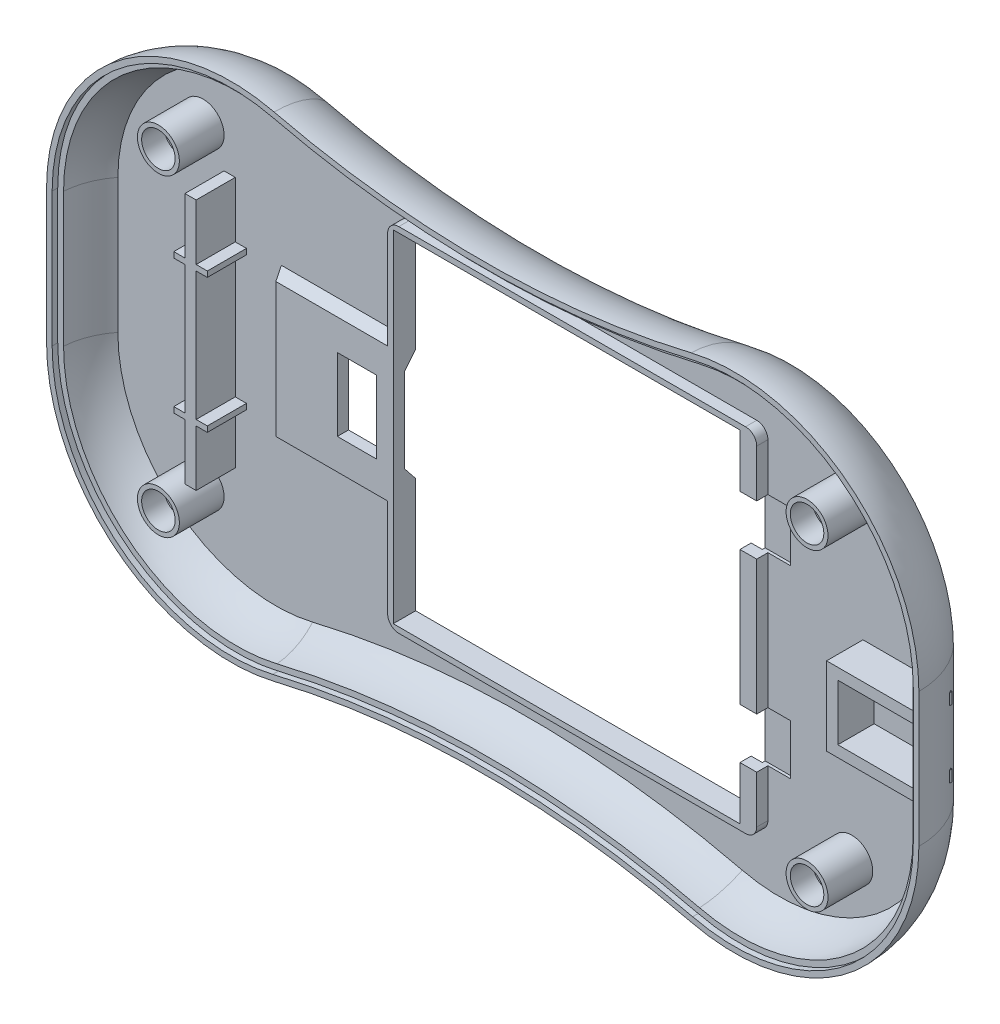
ISO-10303-21;
HEADER;
FILE_DESCRIPTION(('STEP AP214'),'2;1');
FILE_NAME('part.step','',(''),(''),'','','');
FILE_SCHEMA(('AUTOMOTIVE_DESIGN { 1 0 10303 214 1 1 1 1 }'));
ENDSEC;
DATA;
#1=APPLICATION_CONTEXT('core data for automotive mechanical design processes');
#2=APPLICATION_PROTOCOL_DEFINITION('international standard','automotive_design',2000,#1);
#3=PRODUCT_CONTEXT('',#1,'mechanical');
#4=PRODUCT('Part','Part','',(#3));
#5=PRODUCT_RELATED_PRODUCT_CATEGORY('part','',(#4));
#6=PRODUCT_DEFINITION_FORMATION('','',#4);
#7=PRODUCT_DEFINITION_CONTEXT('part definition',#1,'design');
#8=PRODUCT_DEFINITION('design','',#6,#7);
#9=PRODUCT_DEFINITION_SHAPE('','',#8);
#10=(LENGTH_UNIT() NAMED_UNIT(*) SI_UNIT(.MILLI.,.METRE.));
#11=(NAMED_UNIT(*) PLANE_ANGLE_UNIT() SI_UNIT($,.RADIAN.));
#12=(NAMED_UNIT(*) SI_UNIT($,.STERADIAN.) SOLID_ANGLE_UNIT());
#13=UNCERTAINTY_MEASURE_WITH_UNIT(LENGTH_MEASURE(1.E-05),#10,'distance_accuracy_value','');
#14=(GEOMETRIC_REPRESENTATION_CONTEXT(3) GLOBAL_UNCERTAINTY_ASSIGNED_CONTEXT((#13)) GLOBAL_UNIT_ASSIGNED_CONTEXT((#10,
#11,#12)) REPRESENTATION_CONTEXT('',''));
#15=CARTESIAN_POINT('',(0.,0.,0.));
#16=DIRECTION('',(0.,0.,1.));
#17=DIRECTION('',(1.,0.,0.));
#18=AXIS2_PLACEMENT_3D('',#15,#16,#17);
#19=CARTESIAN_POINT('',(-54.25,22.5,59.0444225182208));
#20=DIRECTION('',(1.,0.,0.));
#21=DIRECTION('',(0.,1.,0.));
#22=AXIS2_PLACEMENT_3D('',#19,#20,#21);
#23=PLANE('',#22);
#24=DIRECTION('',(0.,-1.,0.));
#25=VECTOR('',#24,1.);
#26=CARTESIAN_POINT('',(-54.25,22.5,7.));
#27=LINE('',#26,#25);
#28=CARTESIAN_POINT('',(-54.25,11.5,7.));
#29=VERTEX_POINT('',#28);
#30=CARTESIAN_POINT('',(-54.25,-11.5,7.));
#31=VERTEX_POINT('',#30);
#32=EDGE_CURVE('E771',#29,#31,#27,.T.);
#33=ORIENTED_EDGE('',*,*,#32,.T.);
#34=DIRECTION('',(0.,0.,1.));
#35=VECTOR('',#34,1.);
#36=CARTESIAN_POINT('',(-54.25,-11.5,59.0444225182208));
#37=LINE('',#36,#35);
#38=CARTESIAN_POINT('',(-54.25,-11.5,14.));
#39=VERTEX_POINT('',#38);
#40=EDGE_CURVE('E707',#31,#39,#37,.T.);
#41=ORIENTED_EDGE('',*,*,#40,.T.);
#42=DIRECTION('',(0.,-1.,0.));
#43=VECTOR('',#42,1.);
#44=CARTESIAN_POINT('',(-54.25,22.5,14.));
#45=LINE('',#44,#43);
#46=CARTESIAN_POINT('',(-54.25,11.5,14.));
#47=VERTEX_POINT('',#46);
#48=EDGE_CURVE('E667',#47,#39,#45,.T.);
#49=ORIENTED_EDGE('',*,*,#48,.F.);
#50=DIRECTION('',(0.,0.,-1.));
#51=VECTOR('',#50,1.);
#52=CARTESIAN_POINT('',(-54.25,11.5,59.0444225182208));
#53=LINE('',#52,#51);
#54=EDGE_CURVE('E748',#47,#29,#53,.T.);
#55=ORIENTED_EDGE('',*,*,#54,.T.);
#56=EDGE_LOOP('',(#33,#41,#49,#55));
#57=FACE_BOUND('',#56,.T.);
#58=ADVANCED_FACE('F32',(#57),#23,.F.);
#59=CARTESIAN_POINT('',(-52.25,22.5,59.0444225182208));
#60=DIRECTION('',(-1.,0.,0.));
#61=DIRECTION('',(0.,-1.,0.));
#62=AXIS2_PLACEMENT_3D('',#59,#60,#61);
#63=PLANE('',#62);
#64=DIRECTION('',(0.,1.,0.));
#65=VECTOR('',#64,1.);
#66=CARTESIAN_POINT('',(-52.25,22.5,14.));
#67=LINE('',#66,#65);
#68=CARTESIAN_POINT('',(-52.25,-11.5,14.));
#69=VERTEX_POINT('',#68);
#70=CARTESIAN_POINT('',(-52.25,11.5,14.));
#71=VERTEX_POINT('',#70);
#72=EDGE_CURVE('E790',#69,#71,#67,.T.);
#73=ORIENTED_EDGE('',*,*,#72,.F.);
#74=DIRECTION('',(0.,0.,-1.));
#75=VECTOR('',#74,1.);
#76=CARTESIAN_POINT('',(-52.25,-11.5,59.0444225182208));
#77=LINE('',#76,#75);
#78=CARTESIAN_POINT('',(-52.25,-11.5,7.));
#79=VERTEX_POINT('',#78);
#80=EDGE_CURVE('E704',#69,#79,#77,.T.);
#81=ORIENTED_EDGE('',*,*,#80,.T.);
#82=DIRECTION('',(0.,1.,0.));
#83=VECTOR('',#82,1.);
#84=CARTESIAN_POINT('',(-52.25,22.5,7.));
#85=LINE('',#84,#83);
#86=CARTESIAN_POINT('',(-52.25,11.5,7.));
#87=VERTEX_POINT('',#86);
#88=EDGE_CURVE('E762',#79,#87,#85,.T.);
#89=ORIENTED_EDGE('',*,*,#88,.T.);
#90=DIRECTION('',(0.,0.,1.));
#91=VECTOR('',#90,1.);
#92=CARTESIAN_POINT('',(-52.25,11.5,59.0444225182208));
#93=LINE('',#92,#91);
#94=EDGE_CURVE('E745',#87,#71,#93,.T.);
#95=ORIENTED_EDGE('',*,*,#94,.T.);
#96=EDGE_LOOP('',(#73,#81,#89,#95));
#97=FACE_BOUND('',#96,.T.);
#98=ADVANCED_FACE('F1636',(#97),#63,.F.);
#99=CARTESIAN_POINT('',(-54.25,22.5,7.));
#100=VERTEX_POINT('',#99);
#101=CARTESIAN_POINT('',(-54.25,12.5,7.));
#102=VERTEX_POINT('',#101);
#103=EDGE_CURVE('E768',#100,#102,#27,.T.);
#104=ORIENTED_EDGE('',*,*,#103,.T.);
#105=DIRECTION('',(0.,0.,1.));
#106=VECTOR('',#105,1.);
#107=CARTESIAN_POINT('',(-54.25,12.5,59.0444225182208));
#108=LINE('',#107,#106);
#109=CARTESIAN_POINT('',(-54.25,12.5,14.));
#110=VERTEX_POINT('',#109);
#111=EDGE_CURVE('E754',#102,#110,#108,.T.);
#112=ORIENTED_EDGE('',*,*,#111,.T.);
#113=CARTESIAN_POINT('',(-54.25,22.5,14.));
#114=VERTEX_POINT('',#113);
#115=EDGE_CURVE('E781',#114,#110,#45,.T.);
#116=ORIENTED_EDGE('',*,*,#115,.F.);
#117=DIRECTION('',(0.,0.,-1.));
#118=VECTOR('',#117,1.);
#119=CARTESIAN_POINT('',(-54.25,22.5,59.0444225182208));
#120=LINE('',#119,#118);
#121=EDGE_CURVE('E776',#114,#100,#120,.T.);
#122=ORIENTED_EDGE('',*,*,#121,.T.);
#123=EDGE_LOOP('',(#104,#112,#116,#122));
#124=FACE_BOUND('',#123,.T.);
#125=ADVANCED_FACE('F1639',(#124),#23,.F.);
#126=CARTESIAN_POINT('',(-52.25,12.5,14.));
#127=VERTEX_POINT('',#126);
#128=CARTESIAN_POINT('',(-52.25,22.5,14.));
#129=VERTEX_POINT('',#128);
#130=EDGE_CURVE('E761',#127,#129,#67,.T.);
#131=ORIENTED_EDGE('',*,*,#130,.F.);
#132=DIRECTION('',(0.,0.,-1.));
#133=VECTOR('',#132,1.);
#134=CARTESIAN_POINT('',(-52.25,12.5,59.0444225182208));
#135=LINE('',#134,#133);
#136=CARTESIAN_POINT('',(-52.25,12.5,7.));
#137=VERTEX_POINT('',#136);
#138=EDGE_CURVE('E751',#127,#137,#135,.T.);
#139=ORIENTED_EDGE('',*,*,#138,.T.);
#140=CARTESIAN_POINT('',(-52.25,22.5,7.));
#141=VERTEX_POINT('',#140);
#142=EDGE_CURVE('E763',#137,#141,#85,.T.);
#143=ORIENTED_EDGE('',*,*,#142,.T.);
#144=DIRECTION('',(0.,0.,-1.));
#145=VECTOR('',#144,1.);
#146=CARTESIAN_POINT('',(-52.25,22.5,59.0444225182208));
#147=LINE('',#146,#145);
#148=EDGE_CURVE('E757',#129,#141,#147,.T.);
#149=ORIENTED_EDGE('',*,*,#148,.F.);
#150=EDGE_LOOP('',(#131,#139,#143,#149));
#151=FACE_BOUND('',#150,.T.);
#152=ADVANCED_FACE('F1646',(#151),#63,.F.);
#153=CARTESIAN_POINT('',(-45.,12.,7.));
#154=DIRECTION('',(0.,0.,1.));
#155=DIRECTION('',(1.,0.,0.));
#156=AXIS2_PLACEMENT_3D('',#153,#154,#155);
#157=PLANE('',#156);
#158=DIRECTION('',(1.,0.,0.));
#159=VECTOR('',#158,1.);
#160=CARTESIAN_POINT('',(-56.25,-11.5,7.));
#161=LINE('',#160,#159);
#162=CARTESIAN_POINT('',(-50.25,-11.5,7.));
#163=VERTEX_POINT('',#162);
#164=EDGE_CURVE('E1686',#79,#163,#161,.T.);
#165=ORIENTED_EDGE('',*,*,#164,.T.);
#166=DIRECTION('',(0.,-1.,0.));
#167=VECTOR('',#166,1.);
#168=CARTESIAN_POINT('',(-50.25,-11.5,7.));
#169=LINE('',#168,#167);
#170=CARTESIAN_POINT('',(-50.25,-12.5,7.));
#171=VERTEX_POINT('',#170);
#172=EDGE_CURVE('E1681',#163,#171,#169,.T.);
#173=ORIENTED_EDGE('',*,*,#172,.T.);
#174=DIRECTION('',(-1.,0.,0.));
#175=VECTOR('',#174,1.);
#176=CARTESIAN_POINT('',(-56.25,-12.5,7.));
#177=LINE('',#176,#175);
#178=CARTESIAN_POINT('',(-52.25,-12.5,7.));
#179=VERTEX_POINT('',#178);
#180=EDGE_CURVE('E1676',#171,#179,#177,.T.);
#181=ORIENTED_EDGE('',*,*,#180,.T.);
#182=CARTESIAN_POINT('',(-52.25,-22.5,7.));
#183=VERTEX_POINT('',#182);
#184=EDGE_CURVE('E758',#183,#179,#85,.T.);
#185=ORIENTED_EDGE('',*,*,#184,.F.);
#186=DIRECTION('',(1.,0.,0.));
#187=VECTOR('',#186,1.);
#188=CARTESIAN_POINT('',(-52.25,-22.5,7.));
#189=LINE('',#188,#187);
#190=CARTESIAN_POINT('',(-54.25,-22.5,7.));
#191=VERTEX_POINT('',#190);
#192=EDGE_CURVE('E764',#191,#183,#189,.T.);
#193=ORIENTED_EDGE('',*,*,#192,.F.);
#194=CARTESIAN_POINT('',(-54.25,-12.5,7.));
#195=VERTEX_POINT('',#194);
#196=EDGE_CURVE('E772',#195,#191,#27,.T.);
#197=ORIENTED_EDGE('',*,*,#196,.F.);
#198=CARTESIAN_POINT('',(-56.25,-12.5,7.));
#199=VERTEX_POINT('',#198);
#200=EDGE_CURVE('E691',#195,#199,#177,.T.);
#201=ORIENTED_EDGE('',*,*,#200,.T.);
#202=DIRECTION('',(0.,1.,0.));
#203=VECTOR('',#202,1.);
#204=CARTESIAN_POINT('',(-56.25,-12.5,7.));
#205=LINE('',#204,#203);
#206=CARTESIAN_POINT('',(-56.25,-11.5,7.));
#207=VERTEX_POINT('',#206);
#208=EDGE_CURVE('E696',#199,#207,#205,.T.);
#209=ORIENTED_EDGE('',*,*,#208,.T.);
#210=EDGE_CURVE('E675',#207,#31,#161,.T.);
#211=ORIENTED_EDGE('',*,*,#210,.T.);
#212=ORIENTED_EDGE('',*,*,#32,.F.);
#213=DIRECTION('',(-1.,0.,0.));
#214=VECTOR('',#213,1.);
#215=CARTESIAN_POINT('',(-56.25,11.5,7.));
#216=LINE('',#215,#214);
#217=CARTESIAN_POINT('',(-56.25,11.5,7.));
#218=VERTEX_POINT('',#217);
#219=EDGE_CURVE('E721',#29,#218,#216,.T.);
#220=ORIENTED_EDGE('',*,*,#219,.T.);
#221=DIRECTION('',(0.,1.,0.));
#222=VECTOR('',#221,1.);
#223=CARTESIAN_POINT('',(-56.25,12.5,7.));
#224=LINE('',#223,#222);
#225=CARTESIAN_POINT('',(-56.25,12.5,7.));
#226=VERTEX_POINT('',#225);
#227=EDGE_CURVE('E718',#218,#226,#224,.T.);
#228=ORIENTED_EDGE('',*,*,#227,.T.);
#229=DIRECTION('',(1.,0.,0.));
#230=VECTOR('',#229,1.);
#231=CARTESIAN_POINT('',(-56.25,12.5,7.));
#232=LINE('',#231,#230);
#233=EDGE_CURVE('E715',#226,#102,#232,.T.);
#234=ORIENTED_EDGE('',*,*,#233,.T.);
#235=ORIENTED_EDGE('',*,*,#103,.F.);
#236=DIRECTION('',(-1.,0.,0.));
#237=VECTOR('',#236,1.);
#238=CARTESIAN_POINT('',(-54.25,22.5,7.));
#239=LINE('',#238,#237);
#240=EDGE_CURVE('E773',#141,#100,#239,.T.);
#241=ORIENTED_EDGE('',*,*,#240,.F.);
#242=ORIENTED_EDGE('',*,*,#142,.F.);
#243=CARTESIAN_POINT('',(-50.25,12.5,7.));
#244=VERTEX_POINT('',#243);
#245=EDGE_CURVE('E713',#137,#244,#232,.T.);
#246=ORIENTED_EDGE('',*,*,#245,.T.);
#247=DIRECTION('',(0.,-1.,0.));
#248=VECTOR('',#247,1.);
#249=CARTESIAN_POINT('',(-50.25,11.5,7.));
#250=LINE('',#249,#248);
#251=CARTESIAN_POINT('',(-50.25,11.5,7.));
#252=VERTEX_POINT('',#251);
#253=EDGE_CURVE('E710',#244,#252,#250,.T.);
#254=ORIENTED_EDGE('',*,*,#253,.T.);
#255=EDGE_CURVE('E742',#252,#87,#216,.T.);
#256=ORIENTED_EDGE('',*,*,#255,.T.);
#257=ORIENTED_EDGE('',*,*,#88,.F.);
#258=EDGE_LOOP('',(#165,#173,#181,#185,#193,#197,#201,#209,#211,#212,#220,#228,#234,#235,#241,
#242,#246,#254,#256,#257));
#259=FACE_BOUND('',#258,.T.);
#260=CARTESIAN_POINT('',(58.,-28.,7.));
#261=DIRECTION('',(0.,0.,1.));
#262=DIRECTION('',(1.,0.,0.));
#263=AXIS2_PLACEMENT_3D('',#260,#261,#262);
#264=CIRCLE('',#263,3.74999999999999);
#265=CARTESIAN_POINT('',(61.75,-28.,7.));
#266=VERTEX_POINT('',#265);
#267=EDGE_CURVE('E1228',#266,#266,#264,.T.);
#268=ORIENTED_EDGE('',*,*,#267,.F.);
#269=EDGE_LOOP('',(#268));
#270=FACE_BOUND('',#269,.T.);
#271=CARTESIAN_POINT('',(-58.,28.,7.));
#272=DIRECTION('',(0.,0.,1.));
#273=DIRECTION('',(1.,0.,0.));
#274=AXIS2_PLACEMENT_3D('',#271,#272,#273);
#275=CIRCLE('',#274,3.75);
#276=CARTESIAN_POINT('',(-54.25,28.,7.));
#277=VERTEX_POINT('',#276);
#278=EDGE_CURVE('E1240',#277,#277,#275,.T.);
#279=ORIENTED_EDGE('',*,*,#278,.F.);
#280=EDGE_LOOP('',(#279));
#281=FACE_BOUND('',#280,.T.);
#282=CARTESIAN_POINT('',(-58.,-28.,7.));
#283=DIRECTION('',(0.,0.,1.));
#284=DIRECTION('',(1.,0.,0.));
#285=AXIS2_PLACEMENT_3D('',#282,#283,#284);
#286=CIRCLE('',#285,3.75);
#287=CARTESIAN_POINT('',(-54.25,-28.,7.));
#288=VERTEX_POINT('',#287);
#289=EDGE_CURVE('E1234',#288,#288,#286,.T.);
#290=ORIENTED_EDGE('',*,*,#289,.F.);
#291=EDGE_LOOP('',(#290));
#292=FACE_BOUND('',#291,.T.);
#293=CARTESIAN_POINT('',(58.,28.,7.));
#294=DIRECTION('',(0.,0.,1.));
#295=DIRECTION('',(1.,0.,0.));
#296=AXIS2_PLACEMENT_3D('',#293,#294,#295);
#297=CIRCLE('',#296,3.75000000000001);
#298=CARTESIAN_POINT('',(61.75,28.,7.));
#299=VERTEX_POINT('',#298);
#300=EDGE_CURVE('E1222',#299,#299,#297,.T.);
#301=ORIENTED_EDGE('',*,*,#300,.F.);
#302=EDGE_LOOP('',(#301));
#303=FACE_BOUND('',#302,.T.);
#304=DIRECTION('',(1.,0.,0.));
#305=VECTOR('',#304,1.);
#306=CARTESIAN_POINT('',(-45.,-21.,7.));
#307=LINE('',#306,#305);
#308=CARTESIAN_POINT('',(43.,-21.,7.));
#309=VERTEX_POINT('',#308);
#310=CARTESIAN_POINT('',(47.,-21.,7.));
#311=VERTEX_POINT('',#310);
#312=EDGE_CURVE('E900',#309,#311,#307,.T.);
#313=ORIENTED_EDGE('',*,*,#312,.F.);
#314=DIRECTION('',(0.,1.,0.));
#315=VECTOR('',#314,1.);
#316=CARTESIAN_POINT('',(43.,31.5,7.));
#317=LINE('',#316,#315);
#318=CARTESIAN_POINT('',(43.,-29.5,7.));
#319=VERTEX_POINT('',#318);
#320=EDGE_CURVE('E1090',#319,#309,#317,.T.);
#321=ORIENTED_EDGE('',*,*,#320,.F.);
#322=CARTESIAN_POINT('',(41.,-29.5,7.));
#323=DIRECTION('',(0.,0.,1.));
#324=DIRECTION('',(1.,0.,0.));
#325=AXIS2_PLACEMENT_3D('',#322,#323,#324);
#326=CIRCLE('',#325,2.);
#327=CARTESIAN_POINT('',(41.,-31.5,7.));
#328=VERTEX_POINT('',#327);
#329=EDGE_CURVE('E1455',#319,#328,#326,.F.);
#330=ORIENTED_EDGE('',*,*,#329,.T.);
#331=DIRECTION('',(1.,0.,0.));
#332=VECTOR('',#331,1.);
#333=CARTESIAN_POINT('',(-23.,-31.5,7.));
#334=LINE('',#333,#332);
#335=CARTESIAN_POINT('',(-21.,-31.5,7.));
#336=VERTEX_POINT('',#335);
#337=EDGE_CURVE('E1086',#336,#328,#334,.T.);
#338=ORIENTED_EDGE('',*,*,#337,.F.);
#339=CARTESIAN_POINT('',(-21.,-29.5,7.));
#340=DIRECTION('',(0.,0.,1.));
#341=DIRECTION('',(1.,0.,0.));
#342=AXIS2_PLACEMENT_3D('',#339,#340,#341);
#343=CIRCLE('',#342,2.);
#344=CARTESIAN_POINT('',(-23.,-29.5,7.));
#345=VERTEX_POINT('',#344);
#346=EDGE_CURVE('E1459',#336,#345,#343,.F.);
#347=ORIENTED_EDGE('',*,*,#346,.T.);
#348=DIRECTION('',(0.,-1.,0.));
#349=VECTOR('',#348,1.);
#350=CARTESIAN_POINT('',(-23.,-12.,7.));
#351=LINE('',#350,#349);
#352=CARTESIAN_POINT('',(-23.,-13.,7.));
#353=VERTEX_POINT('',#352);
#354=EDGE_CURVE('E1083',#353,#345,#351,.T.);
#355=ORIENTED_EDGE('',*,*,#354,.F.);
#356=DIRECTION('',(-1.,0.,0.));
#357=VECTOR('',#356,1.);
#358=CARTESIAN_POINT('',(-45.,-13.,7.));
#359=LINE('',#358,#357);
#360=CARTESIAN_POINT('',(-44.,-13.,7.));
#361=VERTEX_POINT('',#360);
#362=EDGE_CURVE('E1418',#353,#361,#359,.T.);
#363=ORIENTED_EDGE('',*,*,#362,.T.);
#364=DIRECTION('',(0.,1.,0.));
#365=VECTOR('',#364,1.);
#366=CARTESIAN_POINT('',(-44.,12.,7.));
#367=LINE('',#366,#365);
#368=CARTESIAN_POINT('',(-44.,13.,7.));
#369=VERTEX_POINT('',#368);
#370=EDGE_CURVE('E1416',#361,#369,#367,.T.);
#371=ORIENTED_EDGE('',*,*,#370,.T.);
#372=DIRECTION('',(1.,0.,0.));
#373=VECTOR('',#372,1.);
#374=CARTESIAN_POINT('',(-45.,13.,7.));
#375=LINE('',#374,#373);
#376=CARTESIAN_POINT('',(-23.,13.,7.));
#377=VERTEX_POINT('',#376);
#378=EDGE_CURVE('E1413',#369,#377,#375,.T.);
#379=ORIENTED_EDGE('',*,*,#378,.T.);
#380=DIRECTION('',(0.,-1.,0.));
#381=VECTOR('',#380,1.);
#382=CARTESIAN_POINT('',(-23.,31.5,7.));
#383=LINE('',#382,#381);
#384=CARTESIAN_POINT('',(-23.,29.5,7.));
#385=VERTEX_POINT('',#384);
#386=EDGE_CURVE('E1081',#385,#377,#383,.T.);
#387=ORIENTED_EDGE('',*,*,#386,.F.);
#388=CARTESIAN_POINT('',(-21.,29.5,7.));
#389=DIRECTION('',(0.,0.,1.));
#390=DIRECTION('',(1.,0.,0.));
#391=AXIS2_PLACEMENT_3D('',#388,#389,#390);
#392=CIRCLE('',#391,2.);
#393=CARTESIAN_POINT('',(-21.,31.5,7.));
#394=VERTEX_POINT('',#393);
#395=EDGE_CURVE('E1457',#385,#394,#392,.F.);
#396=ORIENTED_EDGE('',*,*,#395,.T.);
#397=DIRECTION('',(-1.,0.,0.));
#398=VECTOR('',#397,1.);
#399=CARTESIAN_POINT('',(-23.,31.5,7.));
#400=LINE('',#399,#398);
#401=CARTESIAN_POINT('',(41.,31.5,7.));
#402=VERTEX_POINT('',#401);
#403=EDGE_CURVE('E1093',#402,#394,#400,.T.);
#404=ORIENTED_EDGE('',*,*,#403,.F.);
#405=CARTESIAN_POINT('',(41.,29.5,7.));
#406=DIRECTION('',(0.,0.,1.));
#407=DIRECTION('',(1.,0.,0.));
#408=AXIS2_PLACEMENT_3D('',#405,#406,#407);
#409=CIRCLE('',#408,2.);
#410=CARTESIAN_POINT('',(43.,29.5,7.));
#411=VERTEX_POINT('',#410);
#412=EDGE_CURVE('E1452',#402,#411,#409,.F.);
#413=ORIENTED_EDGE('',*,*,#412,.T.);
#414=CARTESIAN_POINT('',(43.,21.,7.));
#415=VERTEX_POINT('',#414);
#416=EDGE_CURVE('E1089',#415,#411,#317,.T.);
#417=ORIENTED_EDGE('',*,*,#416,.F.);
#418=DIRECTION('',(-1.,0.,0.));
#419=VECTOR('',#418,1.);
#420=CARTESIAN_POINT('',(-45.,21.,7.));
#421=LINE('',#420,#419);
#422=CARTESIAN_POINT('',(47.,21.,7.));
#423=VERTEX_POINT('',#422);
#424=EDGE_CURVE('E941',#423,#415,#421,.T.);
#425=ORIENTED_EDGE('',*,*,#424,.F.);
#426=DIRECTION('',(0.,1.,0.));
#427=VECTOR('',#426,1.);
#428=CARTESIAN_POINT('',(47.,12.0000000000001,7.));
#429=LINE('',#428,#427);
#430=CARTESIAN_POINT('',(47.,12.,7.));
#431=VERTEX_POINT('',#430);
#432=EDGE_CURVE('E1500',#431,#423,#429,.T.);
#433=ORIENTED_EDGE('',*,*,#432,.F.);
#434=DIRECTION('',(1.,0.,0.));
#435=VECTOR('',#434,1.);
#436=CARTESIAN_POINT('',(-45.,12.,7.));
#437=LINE('',#436,#435);
#438=CARTESIAN_POINT('',(43.,12.,7.));
#439=VERTEX_POINT('',#438);
#440=EDGE_CURVE('E933',#439,#431,#437,.T.);
#441=ORIENTED_EDGE('',*,*,#440,.F.);
#442=CARTESIAN_POINT('',(43.,-12.,7.));
#443=VERTEX_POINT('',#442);
#444=EDGE_CURVE('E1094',#443,#439,#317,.T.);
#445=ORIENTED_EDGE('',*,*,#444,.F.);
#446=DIRECTION('',(-1.,0.,0.));
#447=VECTOR('',#446,1.);
#448=CARTESIAN_POINT('',(-45.,-12.,7.));
#449=LINE('',#448,#447);
#450=CARTESIAN_POINT('',(47.,-12.,7.));
#451=VERTEX_POINT('',#450);
#452=EDGE_CURVE('E892',#451,#443,#449,.T.);
#453=ORIENTED_EDGE('',*,*,#452,.F.);
#454=DIRECTION('',(0.,1.,0.));
#455=VECTOR('',#454,1.);
#456=CARTESIAN_POINT('',(47.,11.9999999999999,7.));
#457=LINE('',#456,#455);
#458=EDGE_CURVE('E1508',#311,#451,#457,.T.);
#459=ORIENTED_EDGE('',*,*,#458,.F.);
#460=EDGE_LOOP('',(#313,#321,#330,#338,#347,#355,#363,#371,#379,#387,#396,#404,#413,#417,#425,
#433,#441,#445,#453,#459));
#461=FACE_BOUND('',#460,.T.);
#462=DIRECTION('',(-1.,0.,0.));
#463=VECTOR('',#462,1.);
#464=CARTESIAN_POINT('',(60.,-6.99999999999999,7.));
#465=LINE('',#464,#463);
#466=CARTESIAN_POINT('',(73.2469507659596,-6.99999999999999,7.));
#467=VERTEX_POINT('',#466);
#468=CARTESIAN_POINT('',(60.,-6.99999999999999,7.));
#469=VERTEX_POINT('',#468);
#470=EDGE_CURVE('E800',#467,#469,#465,.T.);
#471=ORIENTED_EDGE('',*,*,#470,.T.);
#472=DIRECTION('',(0.,1.,0.));
#473=VECTOR('',#472,1.);
#474=CARTESIAN_POINT('',(60.,7.00000000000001,7.));
#475=LINE('',#474,#473);
#476=CARTESIAN_POINT('',(60.,7.00000000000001,7.));
#477=VERTEX_POINT('',#476);
#478=EDGE_CURVE('E798',#469,#477,#475,.T.);
#479=ORIENTED_EDGE('',*,*,#478,.T.);
#480=DIRECTION('',(1.,0.,0.));
#481=VECTOR('',#480,1.);
#482=CARTESIAN_POINT('',(75.9614813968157,7.00000000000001,7.));
#483=LINE('',#482,#481);
#484=CARTESIAN_POINT('',(73.2469507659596,7.00000000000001,7.));
#485=VERTEX_POINT('',#484);
#486=EDGE_CURVE('E853',#477,#485,#483,.T.);
#487=ORIENTED_EDGE('',*,*,#486,.T.);
#488=DIRECTION('',(0.,1.,0.));
#489=VECTOR('',#488,1.);
#490=CARTESIAN_POINT('',(73.2469507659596,-12.,7.));
#491=LINE('',#490,#489);
#492=CARTESIAN_POINT('',(73.2469507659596,12.,7.));
#493=VERTEX_POINT('',#492);
#494=EDGE_CURVE('E1254',#485,#493,#491,.T.);
#495=ORIENTED_EDGE('',*,*,#494,.T.);
#496=CARTESIAN_POINT('',(45.,12.,7.));
#497=DIRECTION('',(0.,0.,1.));
#498=DIRECTION('',(1.,0.,0.));
#499=AXIS2_PLACEMENT_3D('',#496,#497,#498);
#500=CIRCLE('',#499,28.2469507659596);
#501=CARTESIAN_POINT('',(38.4139233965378,39.4684149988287,7.));
#502=VERTEX_POINT('',#501);
#503=EDGE_CURVE('E1255',#493,#502,#500,.T.);
#504=ORIENTED_EDGE('',*,*,#503,.T.);
#505=CARTESIAN_POINT('',(0.,199.68057970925,7.));
#506=DIRECTION('',(0.,0.,1.));
#507=DIRECTION('',(1.,0.,0.));
#508=AXIS2_PLACEMENT_3D('',#505,#506,#507);
#509=CIRCLE('',#508,164.75304923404);
#510=CARTESIAN_POINT('',(-38.4139233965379,39.4684149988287,7.));
#511=VERTEX_POINT('',#510);
#512=EDGE_CURVE('E1258',#502,#511,#509,.F.);
#513=ORIENTED_EDGE('',*,*,#512,.T.);
#514=CARTESIAN_POINT('',(-45.,12.,7.));
#515=DIRECTION('',(0.,0.,1.));
#516=DIRECTION('',(1.,0.,0.));
#517=AXIS2_PLACEMENT_3D('',#514,#515,#516);
#518=CIRCLE('',#517,28.2469507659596);
#519=CARTESIAN_POINT('',(-73.2469507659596,12.,7.));
#520=VERTEX_POINT('',#519);
#521=EDGE_CURVE('E1246',#511,#520,#518,.T.);
#522=ORIENTED_EDGE('',*,*,#521,.T.);
#523=DIRECTION('',(0.,-1.,0.));
#524=VECTOR('',#523,1.);
#525=CARTESIAN_POINT('',(-73.2469507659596,12.,7.));
#526=LINE('',#525,#524);
#527=CARTESIAN_POINT('',(-73.2469507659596,-12.,7.));
#528=VERTEX_POINT('',#527);
#529=EDGE_CURVE('E1259',#520,#528,#526,.T.);
#530=ORIENTED_EDGE('',*,*,#529,.T.);
#531=CARTESIAN_POINT('',(-45.,-12.,7.));
#532=DIRECTION('',(0.,0.,1.));
#533=DIRECTION('',(1.,0.,0.));
#534=AXIS2_PLACEMENT_3D('',#531,#532,#533);
#535=CIRCLE('',#534,28.2469507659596);
#536=CARTESIAN_POINT('',(-38.4139233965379,-39.4684149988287,7.));
#537=VERTEX_POINT('',#536);
#538=EDGE_CURVE('E1256',#528,#537,#535,.T.);
#539=ORIENTED_EDGE('',*,*,#538,.T.);
#540=CARTESIAN_POINT('',(0.,-199.68057970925,7.));
#541=DIRECTION('',(0.,0.,1.));
#542=DIRECTION('',(1.,0.,0.));
#543=AXIS2_PLACEMENT_3D('',#540,#541,#542);
#544=CIRCLE('',#543,164.75304923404);
#545=CARTESIAN_POINT('',(38.4139233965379,-39.4684149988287,7.));
#546=VERTEX_POINT('',#545);
#547=EDGE_CURVE('E1252',#537,#546,#544,.F.);
#548=ORIENTED_EDGE('',*,*,#547,.T.);
#549=CARTESIAN_POINT('',(45.,-12.,7.));
#550=DIRECTION('',(0.,0.,1.));
#551=DIRECTION('',(1.,0.,0.));
#552=AXIS2_PLACEMENT_3D('',#549,#550,#551);
#553=CIRCLE('',#552,28.2469507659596);
#554=CARTESIAN_POINT('',(73.2469507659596,-12.,7.));
#555=VERTEX_POINT('',#554);
#556=EDGE_CURVE('E1247',#546,#555,#553,.T.);
#557=ORIENTED_EDGE('',*,*,#556,.T.);
#558=EDGE_CURVE('E1251',#555,#467,#491,.T.);
#559=ORIENTED_EDGE('',*,*,#558,.T.);
#560=EDGE_LOOP('',(#471,#479,#487,#495,#504,#513,#522,#530,#539,#548,#557,#559));
#561=FACE_BOUND('',#560,.T.);
#562=ADVANCED_FACE('F1557',(#259,#270,#281,#292,#303,#461,#561),#157,.T.);
#563=DIRECTION('',(-1.,0.,0.));
#564=VECTOR('',#563,1.);
#565=CARTESIAN_POINT('',(75.9614813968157,5.00000000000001,7.));
#566=LINE('',#565,#564);
#567=CARTESIAN_POINT('',(73.2469507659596,5.00000000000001,7.));
#568=VERTEX_POINT('',#567);
#569=CARTESIAN_POINT('',(62.,5.00000000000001,7.));
#570=VERTEX_POINT('',#569);
#571=EDGE_CURVE('E811',#568,#570,#566,.T.);
#572=ORIENTED_EDGE('',*,*,#571,.T.);
#573=DIRECTION('',(0.,-1.,0.));
#574=VECTOR('',#573,1.);
#575=CARTESIAN_POINT('',(62.,5.00000000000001,7.));
#576=LINE('',#575,#574);
#577=CARTESIAN_POINT('',(62.,-4.99999999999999,7.));
#578=VERTEX_POINT('',#577);
#579=EDGE_CURVE('E809',#570,#578,#576,.T.);
#580=ORIENTED_EDGE('',*,*,#579,.T.);
#581=DIRECTION('',(1.,0.,0.));
#582=VECTOR('',#581,1.);
#583=CARTESIAN_POINT('',(62.,-4.99999999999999,7.));
#584=LINE('',#583,#582);
#585=CARTESIAN_POINT('',(73.2469507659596,-4.99999999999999,7.));
#586=VERTEX_POINT('',#585);
#587=EDGE_CURVE('E807',#578,#586,#584,.T.);
#588=ORIENTED_EDGE('',*,*,#587,.T.);
#589=EDGE_CURVE('E1268',#586,#568,#491,.T.);
#590=ORIENTED_EDGE('',*,*,#589,.T.);
#591=EDGE_LOOP('',(#572,#580,#588,#590));
#592=FACE_BOUND('',#591,.T.);
#593=ADVANCED_FACE('F1750',(#592),#157,.T.);
#594=CARTESIAN_POINT('',(40.,30.5,4.));
#595=DIRECTION('',(1.,0.,0.));
#596=DIRECTION('',(0.,1.,0.));
#597=AXIS2_PLACEMENT_3D('',#594,#595,#596);
#598=PLANE('',#597);
#599=DIRECTION('',(0.,1.,0.));
#600=VECTOR('',#599,1.);
#601=CARTESIAN_POINT('',(40.,30.5,9.));
#602=LINE('',#601,#600);
#603=CARTESIAN_POINT('',(40.,-30.5,9.));
#604=VERTEX_POINT('',#603);
#605=CARTESIAN_POINT('',(40.,-21.,9.));
#606=VERTEX_POINT('',#605);
#607=EDGE_CURVE('E1013',#604,#606,#602,.T.);
#608=ORIENTED_EDGE('',*,*,#607,.T.);
#609=DIRECTION('',(0.,0.,1.));
#610=VECTOR('',#609,1.);
#611=CARTESIAN_POINT('',(40.,-21.,6.5));
#612=LINE('',#611,#610);
#613=CARTESIAN_POINT('',(40.,-21.,7.));
#614=VERTEX_POINT('',#613);
#615=EDGE_CURVE('E876',#614,#606,#612,.T.);
#616=ORIENTED_EDGE('',*,*,#615,.F.);
#617=DIRECTION('',(0.,1.,0.));
#618=VECTOR('',#617,1.);
#619=CARTESIAN_POINT('',(40.,-30.5,7.));
#620=LINE('',#619,#618);
#621=CARTESIAN_POINT('',(40.,-30.5,7.));
#622=VERTEX_POINT('',#621);
#623=EDGE_CURVE('E949',#622,#614,#620,.T.);
#624=ORIENTED_EDGE('',*,*,#623,.F.);
#625=DIRECTION('',(0.,0.,1.));
#626=VECTOR('',#625,1.);
#627=CARTESIAN_POINT('',(40.,-30.5,4.));
#628=LINE('',#627,#626);
#629=EDGE_CURVE('E1022',#622,#604,#628,.T.);
#630=ORIENTED_EDGE('',*,*,#629,.T.);
#631=EDGE_LOOP('',(#608,#616,#624,#630));
#632=FACE_BOUND('',#631,.T.);
#633=ADVANCED_FACE('F1755',(#632),#598,.F.);
#634=CARTESIAN_POINT('',(43.,31.5,9.));
#635=DIRECTION('',(-1.,0.,0.));
#636=DIRECTION('',(0.,-1.,0.));
#637=AXIS2_PLACEMENT_3D('',#634,#635,#636);
#638=PLANE('',#637);
#639=ORIENTED_EDGE('',*,*,#320,.T.);
#640=DIRECTION('',(0.,0.,1.));
#641=VECTOR('',#640,1.);
#642=CARTESIAN_POINT('',(43.,-21.,9.));
#643=LINE('',#642,#641);
#644=CARTESIAN_POINT('',(43.,-21.,9.));
#645=VERTEX_POINT('',#644);
#646=EDGE_CURVE('E897',#309,#645,#643,.T.);
#647=ORIENTED_EDGE('',*,*,#646,.T.);
#648=DIRECTION('',(0.,1.,0.));
#649=VECTOR('',#648,1.);
#650=CARTESIAN_POINT('',(43.,31.5,9.));
#651=LINE('',#650,#649);
#652=CARTESIAN_POINT('',(43.,-29.5,9.));
#653=VERTEX_POINT('',#652);
#654=EDGE_CURVE('E1113',#653,#645,#651,.T.);
#655=ORIENTED_EDGE('',*,*,#654,.F.);
#656=DIRECTION('',(0.,0.,-1.));
#657=VECTOR('',#656,1.);
#658=CARTESIAN_POINT('',(43.,-29.5,9.));
#659=LINE('',#658,#657);
#660=EDGE_CURVE('E1428',#653,#319,#659,.T.);
#661=ORIENTED_EDGE('',*,*,#660,.T.);
#662=EDGE_LOOP('',(#639,#647,#655,#661));
#663=FACE_BOUND('',#662,.T.);
#664=ADVANCED_FACE('F1996',(#663),#638,.F.);
#665=CARTESIAN_POINT('',(-23.,12.,9.));
#666=DIRECTION('',(0.,0.,-1.));
#667=DIRECTION('',(-1.,0.,0.));
#668=AXIS2_PLACEMENT_3D('',#665,#666,#667);
#669=PLANE('',#668);
#670=DIRECTION('',(1.,0.,0.));
#671=VECTOR('',#670,1.);
#672=CARTESIAN_POINT('',(-32.,-6.5,9.));
#673=LINE('',#672,#671);
#674=CARTESIAN_POINT('',(-32.,-6.5,9.));
#675=VERTEX_POINT('',#674);
#676=CARTESIAN_POINT('',(-25.,-6.5,9.));
#677=VERTEX_POINT('',#676);
#678=EDGE_CURVE('E987',#675,#677,#673,.T.);
#679=ORIENTED_EDGE('',*,*,#678,.F.);
#680=DIRECTION('',(0.,-1.,0.));
#681=VECTOR('',#680,1.);
#682=CARTESIAN_POINT('',(-32.,6.5,9.));
#683=LINE('',#682,#681);
#684=CARTESIAN_POINT('',(-32.,6.5,9.));
#685=VERTEX_POINT('',#684);
#686=EDGE_CURVE('E984',#685,#675,#683,.T.);
#687=ORIENTED_EDGE('',*,*,#686,.F.);
#688=DIRECTION('',(-1.,0.,0.));
#689=VECTOR('',#688,1.);
#690=CARTESIAN_POINT('',(-32.,6.5,9.));
#691=LINE('',#690,#689);
#692=CARTESIAN_POINT('',(-25.,6.5,9.));
#693=VERTEX_POINT('',#692);
#694=EDGE_CURVE('E993',#693,#685,#691,.T.);
#695=ORIENTED_EDGE('',*,*,#694,.F.);
#696=DIRECTION('',(0.,1.,0.));
#697=VECTOR('',#696,1.);
#698=CARTESIAN_POINT('',(-25.,6.5,9.));
#699=LINE('',#698,#697);
#700=EDGE_CURVE('E990',#677,#693,#699,.T.);
#701=ORIENTED_EDGE('',*,*,#700,.F.);
#702=EDGE_LOOP('',(#679,#687,#695,#701));
#703=FACE_BOUND('',#702,.T.);
#704=ORIENTED_EDGE('',*,*,#654,.T.);
#705=DIRECTION('',(1.,0.,0.));
#706=VECTOR('',#705,1.);
#707=CARTESIAN_POINT('',(40.,-21.,9.));
#708=LINE('',#707,#706);
#709=EDGE_CURVE('E863',#606,#645,#708,.T.);
#710=ORIENTED_EDGE('',*,*,#709,.F.);
#711=ORIENTED_EDGE('',*,*,#607,.F.);
#712=DIRECTION('',(1.,0.,0.));
#713=VECTOR('',#712,1.);
#714=CARTESIAN_POINT('',(-22.,-30.5,9.));
#715=LINE('',#714,#713);
#716=CARTESIAN_POINT('',(-22.,-30.5,9.));
#717=VERTEX_POINT('',#716);
#718=EDGE_CURVE('E1009',#717,#604,#715,.T.);
#719=ORIENTED_EDGE('',*,*,#718,.F.);
#720=DIRECTION('',(0.,-1.,0.));
#721=VECTOR('',#720,1.);
#722=CARTESIAN_POINT('',(-22.,30.5,9.));
#723=LINE('',#722,#721);
#724=CARTESIAN_POINT('',(-22.,30.5,9.));
#725=VERTEX_POINT('',#724);
#726=EDGE_CURVE('E1006',#725,#717,#723,.T.);
#727=ORIENTED_EDGE('',*,*,#726,.F.);
#728=DIRECTION('',(-1.,0.,0.));
#729=VECTOR('',#728,1.);
#730=CARTESIAN_POINT('',(40.,30.5,9.));
#731=LINE('',#730,#729);
#732=CARTESIAN_POINT('',(40.,30.5,9.));
#733=VERTEX_POINT('',#732);
#734=EDGE_CURVE('E999',#733,#725,#731,.T.);
#735=ORIENTED_EDGE('',*,*,#734,.F.);
#736=CARTESIAN_POINT('',(40.,21.,9.));
#737=VERTEX_POINT('',#736);
#738=EDGE_CURVE('E1012',#737,#733,#602,.T.);
#739=ORIENTED_EDGE('',*,*,#738,.F.);
#740=DIRECTION('',(-1.,0.,0.));
#741=VECTOR('',#740,1.);
#742=CARTESIAN_POINT('',(40.,21.,9.));
#743=LINE('',#742,#741);
#744=CARTESIAN_POINT('',(43.,21.,9.));
#745=VERTEX_POINT('',#744);
#746=EDGE_CURVE('E905',#745,#737,#743,.T.);
#747=ORIENTED_EDGE('',*,*,#746,.F.);
#748=CARTESIAN_POINT('',(43.,29.5,9.));
#749=VERTEX_POINT('',#748);
#750=EDGE_CURVE('E1112',#745,#749,#651,.T.);
#751=ORIENTED_EDGE('',*,*,#750,.T.);
#752=CARTESIAN_POINT('',(41.,29.5,9.));
#753=DIRECTION('',(0.,0.,-1.));
#754=DIRECTION('',(-1.,0.,0.));
#755=AXIS2_PLACEMENT_3D('',#752,#753,#754);
#756=CIRCLE('',#755,2.);
#757=CARTESIAN_POINT('',(41.,31.5,9.));
#758=VERTEX_POINT('',#757);
#759=EDGE_CURVE('E1440',#749,#758,#756,.F.);
#760=ORIENTED_EDGE('',*,*,#759,.T.);
#761=DIRECTION('',(-1.,0.,0.));
#762=VECTOR('',#761,1.);
#763=CARTESIAN_POINT('',(-23.,31.5,9.));
#764=LINE('',#763,#762);
#765=CARTESIAN_POINT('',(-21.,31.5,9.));
#766=VERTEX_POINT('',#765);
#767=EDGE_CURVE('E1116',#758,#766,#764,.T.);
#768=ORIENTED_EDGE('',*,*,#767,.T.);
#769=CARTESIAN_POINT('',(-21.,29.5,9.));
#770=DIRECTION('',(0.,0.,-1.));
#771=DIRECTION('',(-1.,0.,0.));
#772=AXIS2_PLACEMENT_3D('',#769,#770,#771);
#773=CIRCLE('',#772,2.);
#774=CARTESIAN_POINT('',(-23.,29.5,9.));
#775=VERTEX_POINT('',#774);
#776=EDGE_CURVE('E1436',#766,#775,#773,.F.);
#777=ORIENTED_EDGE('',*,*,#776,.T.);
#778=DIRECTION('',(0.,-1.,0.));
#779=VECTOR('',#778,1.);
#780=CARTESIAN_POINT('',(-23.,31.5,9.));
#781=LINE('',#780,#779);
#782=CARTESIAN_POINT('',(-23.,12.,9.));
#783=VERTEX_POINT('',#782);
#784=EDGE_CURVE('E1097',#775,#783,#781,.T.);
#785=ORIENTED_EDGE('',*,*,#784,.T.);
#786=DIRECTION('',(-1.,0.,0.));
#787=VECTOR('',#786,1.);
#788=CARTESIAN_POINT('',(-23.,12.,9.));
#789=LINE('',#788,#787);
#790=CARTESIAN_POINT('',(-43.,12.,9.));
#791=VERTEX_POINT('',#790);
#792=EDGE_CURVE('E1099',#783,#791,#789,.T.);
#793=ORIENTED_EDGE('',*,*,#792,.T.);
#794=DIRECTION('',(0.,-1.,0.));
#795=VECTOR('',#794,1.);
#796=CARTESIAN_POINT('',(-43.,12.,9.));
#797=LINE('',#796,#795);
#798=CARTESIAN_POINT('',(-43.,-12.,9.));
#799=VERTEX_POINT('',#798);
#800=EDGE_CURVE('E1101',#791,#799,#797,.T.);
#801=ORIENTED_EDGE('',*,*,#800,.T.);
#802=DIRECTION('',(1.,0.,0.));
#803=VECTOR('',#802,1.);
#804=CARTESIAN_POINT('',(-43.,-12.,9.));
#805=LINE('',#804,#803);
#806=CARTESIAN_POINT('',(-23.,-12.,9.));
#807=VERTEX_POINT('',#806);
#808=EDGE_CURVE('E1103',#799,#807,#805,.T.);
#809=ORIENTED_EDGE('',*,*,#808,.T.);
#810=DIRECTION('',(0.,-1.,0.));
#811=VECTOR('',#810,1.);
#812=CARTESIAN_POINT('',(-23.,-12.,9.));
#813=LINE('',#812,#811);
#814=CARTESIAN_POINT('',(-23.,-29.5,9.));
#815=VERTEX_POINT('',#814);
#816=EDGE_CURVE('E1106',#807,#815,#813,.T.);
#817=ORIENTED_EDGE('',*,*,#816,.T.);
#818=CARTESIAN_POINT('',(-21.,-29.5,9.));
#819=DIRECTION('',(0.,0.,-1.));
#820=DIRECTION('',(-1.,0.,0.));
#821=AXIS2_PLACEMENT_3D('',#818,#819,#820);
#822=CIRCLE('',#821,2.);
#823=CARTESIAN_POINT('',(-21.,-31.5,9.));
#824=VERTEX_POINT('',#823);
#825=EDGE_CURVE('E1434',#815,#824,#822,.F.);
#826=ORIENTED_EDGE('',*,*,#825,.T.);
#827=DIRECTION('',(1.,0.,0.));
#828=VECTOR('',#827,1.);
#829=CARTESIAN_POINT('',(-23.,-31.5,9.));
#830=LINE('',#829,#828);
#831=CARTESIAN_POINT('',(41.,-31.5,9.));
#832=VERTEX_POINT('',#831);
#833=EDGE_CURVE('E1109',#824,#832,#830,.T.);
#834=ORIENTED_EDGE('',*,*,#833,.T.);
#835=CARTESIAN_POINT('',(41.,-29.5,9.));
#836=DIRECTION('',(0.,0.,-1.));
#837=DIRECTION('',(-1.,0.,0.));
#838=AXIS2_PLACEMENT_3D('',#835,#836,#837);
#839=CIRCLE('',#838,2.);
#840=EDGE_CURVE('E1438',#832,#653,#839,.F.);
#841=ORIENTED_EDGE('',*,*,#840,.T.);
#842=EDGE_LOOP('',(#704,#710,#711,#719,#727,#735,#739,#747,#751,#760,#768,#777,#785,#793,#801,
#809,#817,#826,#834,#841));
#843=FACE_BOUND('',#842,.T.);
#844=ADVANCED_FACE('F1987',(#703,#843),#669,.F.);
#845=CARTESIAN_POINT('',(40.,-30.5,7.));
#846=DIRECTION('',(0.,0.,-1.));
#847=DIRECTION('',(-1.,0.,0.));
#848=AXIS2_PLACEMENT_3D('',#845,#846,#847);
#849=PLANE('',#848);
#850=DIRECTION('',(-1.,0.,0.));
#851=VECTOR('',#850,1.);
#852=CARTESIAN_POINT('',(40.,-21.,7.));
#853=LINE('',#852,#851);
#854=CARTESIAN_POINT('',(42.,-21.,7.));
#855=VERTEX_POINT('',#854);
#856=EDGE_CURVE('E1504',#855,#614,#853,.T.);
#857=ORIENTED_EDGE('',*,*,#856,.F.);
#858=DIRECTION('',(0.,-1.,0.));
#859=VECTOR('',#858,1.);
#860=CARTESIAN_POINT('',(42.,30.5,7.));
#861=LINE('',#860,#859);
#862=CARTESIAN_POINT('',(42.,-30.5,7.));
#863=VERTEX_POINT('',#862);
#864=EDGE_CURVE('E956',#855,#863,#861,.T.);
#865=ORIENTED_EDGE('',*,*,#864,.T.);
#866=DIRECTION('',(-1.,0.,0.));
#867=VECTOR('',#866,1.);
#868=CARTESIAN_POINT('',(42.,-30.5,7.));
#869=LINE('',#868,#867);
#870=EDGE_CURVE('E946',#863,#622,#869,.T.);
#871=ORIENTED_EDGE('',*,*,#870,.T.);
#872=ORIENTED_EDGE('',*,*,#623,.T.);
#873=EDGE_LOOP('',(#857,#865,#871,#872));
#874=FACE_BOUND('',#873,.T.);
#875=ADVANCED_FACE('F2161',(#874),#849,.T.);
#876=CARTESIAN_POINT('',(40.,21.,7.));
#877=VERTEX_POINT('',#876);
#878=CARTESIAN_POINT('',(40.,30.5,7.));
#879=VERTEX_POINT('',#878);
#880=EDGE_CURVE('E948',#877,#879,#620,.T.);
#881=ORIENTED_EDGE('',*,*,#880,.F.);
#882=DIRECTION('',(0.,0.,1.));
#883=VECTOR('',#882,1.);
#884=CARTESIAN_POINT('',(40.,21.,6.5));
#885=LINE('',#884,#883);
#886=EDGE_CURVE('E916',#877,#737,#885,.T.);
#887=ORIENTED_EDGE('',*,*,#886,.T.);
#888=ORIENTED_EDGE('',*,*,#738,.T.);
#889=DIRECTION('',(0.,0.,1.));
#890=VECTOR('',#889,1.);
#891=CARTESIAN_POINT('',(40.,30.5,4.));
#892=LINE('',#891,#890);
#893=EDGE_CURVE('E1018',#879,#733,#892,.T.);
#894=ORIENTED_EDGE('',*,*,#893,.F.);
#895=EDGE_LOOP('',(#881,#887,#888,#894));
#896=FACE_BOUND('',#895,.T.);
#897=ADVANCED_FACE('F1934',(#896),#598,.F.);
#898=ORIENTED_EDGE('',*,*,#750,.F.);
#899=DIRECTION('',(0.,0.,-1.));
#900=VECTOR('',#899,1.);
#901=CARTESIAN_POINT('',(43.,21.,9.));
#902=LINE('',#901,#900);
#903=EDGE_CURVE('E938',#745,#415,#902,.T.);
#904=ORIENTED_EDGE('',*,*,#903,.T.);
#905=ORIENTED_EDGE('',*,*,#416,.T.);
#906=DIRECTION('',(0.,0.,-1.));
#907=VECTOR('',#906,1.);
#908=CARTESIAN_POINT('',(43.,29.5,9.));
#909=LINE('',#908,#907);
#910=EDGE_CURVE('E1431',#411,#749,#909,.F.);
#911=ORIENTED_EDGE('',*,*,#910,.T.);
#912=EDGE_LOOP('',(#898,#904,#905,#911));
#913=FACE_BOUND('',#912,.T.);
#914=ADVANCED_FACE('F1997',(#913),#638,.F.);
#915=DIRECTION('',(1.,0.,0.));
#916=VECTOR('',#915,1.);
#917=CARTESIAN_POINT('',(40.,21.,7.));
#918=LINE('',#917,#916);
#919=CARTESIAN_POINT('',(42.,21.,7.));
#920=VERTEX_POINT('',#919);
#921=EDGE_CURVE('E1496',#877,#920,#918,.T.);
#922=ORIENTED_EDGE('',*,*,#921,.F.);
#923=ORIENTED_EDGE('',*,*,#880,.T.);
#924=DIRECTION('',(1.,0.,0.));
#925=VECTOR('',#924,1.);
#926=CARTESIAN_POINT('',(40.,30.5,7.));
#927=LINE('',#926,#925);
#928=CARTESIAN_POINT('',(42.,30.5,7.));
#929=VERTEX_POINT('',#928);
#930=EDGE_CURVE('E952',#879,#929,#927,.T.);
#931=ORIENTED_EDGE('',*,*,#930,.T.);
#932=EDGE_CURVE('E957',#929,#920,#861,.T.);
#933=ORIENTED_EDGE('',*,*,#932,.T.);
#934=EDGE_LOOP('',(#922,#923,#931,#933));
#935=FACE_BOUND('',#934,.T.);
#936=ADVANCED_FACE('F1932',(#935),#849,.T.);
#937=CARTESIAN_POINT('',(40.,-12.,7.));
#938=VERTEX_POINT('',#937);
#939=CARTESIAN_POINT('',(40.,12.,7.));
#940=VERTEX_POINT('',#939);
#941=EDGE_CURVE('E953',#938,#940,#620,.T.);
#942=ORIENTED_EDGE('',*,*,#941,.F.);
#943=DIRECTION('',(0.,0.,1.));
#944=VECTOR('',#943,1.);
#945=CARTESIAN_POINT('',(40.,-12.,6.5));
#946=LINE('',#945,#944);
#947=CARTESIAN_POINT('',(40.,-12.,9.));
#948=VERTEX_POINT('',#947);
#949=EDGE_CURVE('E879',#938,#948,#946,.T.);
#950=ORIENTED_EDGE('',*,*,#949,.T.);
#951=CARTESIAN_POINT('',(40.,12.,9.));
#952=VERTEX_POINT('',#951);
#953=EDGE_CURVE('E1017',#948,#952,#602,.T.);
#954=ORIENTED_EDGE('',*,*,#953,.T.);
#955=DIRECTION('',(0.,0.,1.));
#956=VECTOR('',#955,1.);
#957=CARTESIAN_POINT('',(40.,12.,6.5));
#958=LINE('',#957,#956);
#959=EDGE_CURVE('E915',#940,#952,#958,.T.);
#960=ORIENTED_EDGE('',*,*,#959,.F.);
#961=EDGE_LOOP('',(#942,#950,#954,#960));
#962=FACE_BOUND('',#961,.T.);
#963=ADVANCED_FACE('F1928',(#962),#598,.F.);
#964=CARTESIAN_POINT('',(-32.,6.5,4.));
#965=DIRECTION('',(-1.,0.,0.));
#966=DIRECTION('',(0.,0.,1.));
#967=AXIS2_PLACEMENT_3D('',#964,#965,#966);
#968=PLANE('',#967);
#969=DIRECTION('',(0.,-1.,0.));
#970=VECTOR('',#969,1.);
#971=CARTESIAN_POINT('',(-32.,6.5,7.));
#972=LINE('',#971,#970);
#973=CARTESIAN_POINT('',(-32.,6.5,7.));
#974=VERTEX_POINT('',#973);
#975=CARTESIAN_POINT('',(-32.,-6.5,7.));
#976=VERTEX_POINT('',#975);
#977=EDGE_CURVE('E982',#974,#976,#972,.T.);
#978=ORIENTED_EDGE('',*,*,#977,.F.);
#979=DIRECTION('',(0.,0.,1.));
#980=VECTOR('',#979,1.);
#981=CARTESIAN_POINT('',(-32.,6.5,4.));
#982=LINE('',#981,#980);
#983=EDGE_CURVE('E997',#974,#685,#982,.T.);
#984=ORIENTED_EDGE('',*,*,#983,.T.);
#985=ORIENTED_EDGE('',*,*,#686,.T.);
#986=DIRECTION('',(0.,0.,1.));
#987=VECTOR('',#986,1.);
#988=CARTESIAN_POINT('',(-32.,-6.5,4.));
#989=LINE('',#988,#987);
#990=EDGE_CURVE('E996',#976,#675,#989,.T.);
#991=ORIENTED_EDGE('',*,*,#990,.F.);
#992=EDGE_LOOP('',(#978,#984,#985,#991));
#993=FACE_BOUND('',#992,.T.);
#994=ADVANCED_FACE('F1925',(#993),#968,.F.);
#995=CARTESIAN_POINT('',(-32.,6.5,4.));
#996=DIRECTION('',(0.,1.,0.));
#997=DIRECTION('',(0.,0.,1.));
#998=AXIS2_PLACEMENT_3D('',#995,#996,#997);
#999=PLANE('',#998);
#1000=DIRECTION('',(-1.,0.,0.));
#1001=VECTOR('',#1000,1.);
#1002=CARTESIAN_POINT('',(-32.,6.5,7.));
#1003=LINE('',#1002,#1001);
#1004=CARTESIAN_POINT('',(-25.,6.5,7.));
#1005=VERTEX_POINT('',#1004);
#1006=EDGE_CURVE('E980',#1005,#974,#1003,.T.);
#1007=ORIENTED_EDGE('',*,*,#1006,.F.);
#1008=DIRECTION('',(0.,0.,1.));
#1009=VECTOR('',#1008,1.);
#1010=CARTESIAN_POINT('',(-25.,6.5,4.));
#1011=LINE('',#1010,#1009);
#1012=EDGE_CURVE('E1000',#1005,#693,#1011,.T.);
#1013=ORIENTED_EDGE('',*,*,#1012,.T.);
#1014=ORIENTED_EDGE('',*,*,#694,.T.);
#1015=ORIENTED_EDGE('',*,*,#983,.F.);
#1016=EDGE_LOOP('',(#1007,#1013,#1014,#1015));
#1017=FACE_BOUND('',#1016,.T.);
#1018=ADVANCED_FACE('F1919',(#1017),#999,.F.);
#1019=CARTESIAN_POINT('',(-25.,6.5,4.));
#1020=DIRECTION('',(1.,0.,0.));
#1021=DIRECTION('',(0.,0.,-1.));
#1022=AXIS2_PLACEMENT_3D('',#1019,#1020,#1021);
#1023=PLANE('',#1022);
#1024=DIRECTION('',(0.,1.,0.));
#1025=VECTOR('',#1024,1.);
#1026=CARTESIAN_POINT('',(-25.,6.5,7.));
#1027=LINE('',#1026,#1025);
#1028=CARTESIAN_POINT('',(-25.,-6.5,7.));
#1029=VERTEX_POINT('',#1028);
#1030=EDGE_CURVE('E978',#1029,#1005,#1027,.T.);
#1031=ORIENTED_EDGE('',*,*,#1030,.F.);
#1032=DIRECTION('',(0.,0.,1.));
#1033=VECTOR('',#1032,1.);
#1034=CARTESIAN_POINT('',(-25.,-6.5,4.));
#1035=LINE('',#1034,#1033);
#1036=EDGE_CURVE('E1002',#1029,#677,#1035,.T.);
#1037=ORIENTED_EDGE('',*,*,#1036,.T.);
#1038=ORIENTED_EDGE('',*,*,#700,.T.);
#1039=ORIENTED_EDGE('',*,*,#1012,.F.);
#1040=EDGE_LOOP('',(#1031,#1037,#1038,#1039));
#1041=FACE_BOUND('',#1040,.T.);
#1042=ADVANCED_FACE('F1913',(#1041),#1023,.F.);
#1043=CARTESIAN_POINT('',(-32.,-6.5,4.));
#1044=DIRECTION('',(0.,-1.,0.));
#1045=DIRECTION('',(1.,0.,0.));
#1046=AXIS2_PLACEMENT_3D('',#1043,#1044,#1045);
#1047=PLANE('',#1046);
#1048=DIRECTION('',(1.,0.,0.));
#1049=VECTOR('',#1048,1.);
#1050=CARTESIAN_POINT('',(-32.,-6.5,7.));
#1051=LINE('',#1050,#1049);
#1052=EDGE_CURVE('E1461',#976,#1029,#1051,.T.);
#1053=ORIENTED_EDGE('',*,*,#1052,.F.);
#1054=ORIENTED_EDGE('',*,*,#990,.T.);
#1055=ORIENTED_EDGE('',*,*,#678,.T.);
#1056=ORIENTED_EDGE('',*,*,#1036,.F.);
#1057=EDGE_LOOP('',(#1053,#1054,#1055,#1056));
#1058=FACE_BOUND('',#1057,.T.);
#1059=ADVANCED_FACE('F1909',(#1058),#1047,.F.);
#1060=CARTESIAN_POINT('',(0.,199.68057970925,15.));
#1061=DIRECTION('',(0.,0.,1.));
#1062=DIRECTION('',(1.,0.,0.));
#1063=AXIS2_PLACEMENT_3D('',#1060,#1061,#1062);
#1064=PLANE('',#1063);
#1065=CARTESIAN_POINT('',(0.,199.68057970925,15.));
#1066=DIRECTION('',(0.,0.,-1.));
#1067=DIRECTION('',(1.,0.,0.));
#1068=AXIS2_PLACEMENT_3D('',#1065,#1066,#1067);
#1069=CIRCLE('',#1068,160.);
#1070=CARTESIAN_POINT('',(37.3056994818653,44.0904618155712,15.));
#1071=VERTEX_POINT('',#1070);
#1072=CARTESIAN_POINT('',(-37.3056994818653,44.0904618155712,15.));
#1073=VERTEX_POINT('',#1072);
#1074=EDGE_CURVE('E1361',#1071,#1073,#1069,.T.);
#1075=ORIENTED_EDGE('',*,*,#1074,.T.);
#1076=CARTESIAN_POINT('',(-45.,12.,15.));
#1077=DIRECTION('',(0.,0.,1.));
#1078=DIRECTION('',(1.,0.,0.));
#1079=AXIS2_PLACEMENT_3D('',#1076,#1077,#1078);
#1080=CIRCLE('',#1079,33.);
#1081=CARTESIAN_POINT('',(-78.,12.,15.));
#1082=VERTEX_POINT('',#1081);
#1083=EDGE_CURVE('E1363',#1073,#1082,#1080,.T.);
#1084=ORIENTED_EDGE('',*,*,#1083,.T.);
#1085=DIRECTION('',(0.,-1.,0.));
#1086=VECTOR('',#1085,1.);
#1087=CARTESIAN_POINT('',(-78.,12.,15.));
#1088=LINE('',#1087,#1086);
#1089=CARTESIAN_POINT('',(-78.,-12.,15.));
#1090=VERTEX_POINT('',#1089);
#1091=EDGE_CURVE('E1366',#1082,#1090,#1088,.T.);
#1092=ORIENTED_EDGE('',*,*,#1091,.T.);
#1093=CARTESIAN_POINT('',(-45.,-12.,15.));
#1094=DIRECTION('',(0.,0.,1.));
#1095=DIRECTION('',(-1.,0.,0.));
#1096=AXIS2_PLACEMENT_3D('',#1093,#1094,#1095);
#1097=CIRCLE('',#1096,33.);
#1098=CARTESIAN_POINT('',(-37.3056994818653,-44.0904618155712,15.));
#1099=VERTEX_POINT('',#1098);
#1100=EDGE_CURVE('E1369',#1090,#1099,#1097,.T.);
#1101=ORIENTED_EDGE('',*,*,#1100,.T.);
#1102=CARTESIAN_POINT('',(0.,-199.68057970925,15.));
#1103=DIRECTION('',(0.,0.,-1.));
#1104=DIRECTION('',(-1.,0.,0.));
#1105=AXIS2_PLACEMENT_3D('',#1102,#1103,#1104);
#1106=CIRCLE('',#1105,160.);
#1107=CARTESIAN_POINT('',(37.3056994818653,-44.0904618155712,15.));
#1108=VERTEX_POINT('',#1107);
#1109=EDGE_CURVE('E1372',#1099,#1108,#1106,.T.);
#1110=ORIENTED_EDGE('',*,*,#1109,.T.);
#1111=CARTESIAN_POINT('',(45.,-12.,15.));
#1112=DIRECTION('',(0.,0.,1.));
#1113=DIRECTION('',(-1.,0.,0.));
#1114=AXIS2_PLACEMENT_3D('',#1111,#1112,#1113);
#1115=CIRCLE('',#1114,33.);
#1116=CARTESIAN_POINT('',(78.,-12.,15.));
#1117=VERTEX_POINT('',#1116);
#1118=EDGE_CURVE('E1375',#1108,#1117,#1115,.T.);
#1119=ORIENTED_EDGE('',*,*,#1118,.T.);
#1120=DIRECTION('',(0.,1.,0.));
#1121=VECTOR('',#1120,1.);
#1122=CARTESIAN_POINT('',(78.,12.,15.));
#1123=LINE('',#1122,#1121);
#1124=CARTESIAN_POINT('',(78.,12.,15.));
#1125=VERTEX_POINT('',#1124);
#1126=EDGE_CURVE('E1377',#1117,#1125,#1123,.T.);
#1127=ORIENTED_EDGE('',*,*,#1126,.T.);
#1128=CARTESIAN_POINT('',(45.,12.,15.));
#1129=DIRECTION('',(0.,0.,1.));
#1130=DIRECTION('',(1.,0.,0.));
#1131=AXIS2_PLACEMENT_3D('',#1128,#1129,#1130);
#1132=CIRCLE('',#1131,33.);
#1133=EDGE_CURVE('E1379',#1125,#1071,#1132,.T.);
#1134=ORIENTED_EDGE('',*,*,#1133,.T.);
#1135=EDGE_LOOP('',(#1075,#1084,#1092,#1101,#1110,#1119,#1127,#1134));
#1136=FACE_BOUND('',#1135,.T.);
#1137=CARTESIAN_POINT('',(-45.,-12.,15.));
#1138=DIRECTION('',(0.,0.,-1.));
#1139=DIRECTION('',(-1.,0.,0.));
#1140=AXIS2_PLACEMENT_3D('',#1137,#1138,#1139);
#1141=CIRCLE('',#1140,32.);
#1142=CARTESIAN_POINT('',(-37.538860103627,-43.1180235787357,15.));
#1143=VERTEX_POINT('',#1142);
#1144=CARTESIAN_POINT('',(-77.,-12.,15.));
#1145=VERTEX_POINT('',#1144);
#1146=EDGE_CURVE('E1066',#1143,#1145,#1141,.T.);
#1147=ORIENTED_EDGE('',*,*,#1146,.T.);
#1148=DIRECTION('',(0.,-1.,0.));
#1149=VECTOR('',#1148,1.);
#1150=CARTESIAN_POINT('',(-77.,12.,15.));
#1151=LINE('',#1150,#1149);
#1152=CARTESIAN_POINT('',(-77.,12.,15.));
#1153=VERTEX_POINT('',#1152);
#1154=EDGE_CURVE('E1156',#1153,#1145,#1151,.T.);
#1155=ORIENTED_EDGE('',*,*,#1154,.F.);
#1156=CARTESIAN_POINT('',(-45.,12.,15.));
#1157=DIRECTION('',(0.,0.,1.));
#1158=DIRECTION('',(1.,0.,0.));
#1159=AXIS2_PLACEMENT_3D('',#1156,#1157,#1158);
#1160=CIRCLE('',#1159,32.);
#1161=CARTESIAN_POINT('',(-37.538860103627,43.1180235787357,15.));
#1162=VERTEX_POINT('',#1161);
#1163=EDGE_CURVE('E1151',#1162,#1153,#1160,.T.);
#1164=ORIENTED_EDGE('',*,*,#1163,.F.);
#1165=CARTESIAN_POINT('',(0.,199.68057970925,15.));
#1166=DIRECTION('',(0.,0.,-1.));
#1167=DIRECTION('',(-1.,0.,0.));
#1168=AXIS2_PLACEMENT_3D('',#1165,#1166,#1167);
#1169=CIRCLE('',#1168,161.);
#1170=CARTESIAN_POINT('',(37.5388601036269,43.1180235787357,15.));
#1171=VERTEX_POINT('',#1170);
#1172=EDGE_CURVE('E1142',#1171,#1162,#1169,.T.);
#1173=ORIENTED_EDGE('',*,*,#1172,.F.);
#1174=CARTESIAN_POINT('',(45.,12.,15.));
#1175=DIRECTION('',(0.,0.,1.));
#1176=DIRECTION('',(1.,0.,0.));
#1177=AXIS2_PLACEMENT_3D('',#1174,#1175,#1176);
#1178=CIRCLE('',#1177,32.);
#1179=CARTESIAN_POINT('',(77.,12.,15.));
#1180=VERTEX_POINT('',#1179);
#1181=EDGE_CURVE('E1133',#1180,#1171,#1178,.T.);
#1182=ORIENTED_EDGE('',*,*,#1181,.F.);
#1183=DIRECTION('',(0.,-1.,0.));
#1184=VECTOR('',#1183,1.);
#1185=CARTESIAN_POINT('',(77.,12.,15.));
#1186=LINE('',#1185,#1184);
#1187=CARTESIAN_POINT('',(77.,-12.,15.));
#1188=VERTEX_POINT('',#1187);
#1189=EDGE_CURVE('E1125',#1180,#1188,#1186,.T.);
#1190=ORIENTED_EDGE('',*,*,#1189,.T.);
#1191=CARTESIAN_POINT('',(45.,-12.,15.));
#1192=DIRECTION('',(0.,0.,-1.));
#1193=DIRECTION('',(-1.,0.,0.));
#1194=AXIS2_PLACEMENT_3D('',#1191,#1192,#1193);
#1195=CIRCLE('',#1194,32.);
#1196=CARTESIAN_POINT('',(37.5388601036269,-43.1180235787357,15.));
#1197=VERTEX_POINT('',#1196);
#1198=EDGE_CURVE('E1048',#1188,#1197,#1195,.T.);
#1199=ORIENTED_EDGE('',*,*,#1198,.T.);
#1200=CARTESIAN_POINT('',(0.,-199.68057970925,15.));
#1201=DIRECTION('',(0.,0.,1.));
#1202=DIRECTION('',(1.,0.,0.));
#1203=AXIS2_PLACEMENT_3D('',#1200,#1201,#1202);
#1204=CIRCLE('',#1203,161.);
#1205=EDGE_CURVE('E1057',#1197,#1143,#1204,.T.);
#1206=ORIENTED_EDGE('',*,*,#1205,.T.);
#1207=EDGE_LOOP('',(#1147,#1155,#1164,#1173,#1182,#1190,#1199,#1206));
#1208=FACE_BOUND('',#1207,.T.);
#1209=ADVANCED_FACE('F34',(#1136,#1208),#1064,.T.);
#1210=CARTESIAN_POINT('',(63.,12.,15.));
#1211=DIRECTION('',(0.,1.,0.));
#1212=DIRECTION('',(0.,0.,1.));
#1213=AXIS2_PLACEMENT_3D('',#1210,#1211,#1212);
#1214=CYLINDRICAL_SURFACE('',#1213,13.);
#1215=ORIENTED_EDGE('',*,*,#589,.F.);
#1216=CARTESIAN_POINT('',(63.,-4.99999999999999,15.));
#1217=DIRECTION('',(0.,1.,0.));
#1218=DIRECTION('',(0.,0.,1.));
#1219=AXIS2_PLACEMENT_3D('',#1216,#1217,#1218);
#1220=CIRCLE('',#1219,13.);
#1221=CARTESIAN_POINT('',(75.913171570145,-4.99999999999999,13.5));
#1222=VERTEX_POINT('',#1221);
#1223=EDGE_CURVE('E859',#586,#1222,#1220,.F.);
#1224=ORIENTED_EDGE('',*,*,#1223,.T.);
#1225=DIRECTION('',(0.,1.,0.));
#1226=VECTOR('',#1225,1.);
#1227=CARTESIAN_POINT('',(75.913171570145,12.,13.5));
#1228=LINE('',#1227,#1226);
#1229=CARTESIAN_POINT('',(75.913171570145,-6.99999999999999,13.5));
#1230=VERTEX_POINT('',#1229);
#1231=EDGE_CURVE('E11',#1230,#1222,#1228,.T.);
#1232=ORIENTED_EDGE('',*,*,#1231,.F.);
#1233=CARTESIAN_POINT('',(63.,-6.99999999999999,15.));
#1234=DIRECTION('',(0.,-1.,0.));
#1235=DIRECTION('',(0.,0.,-1.));
#1236=AXIS2_PLACEMENT_3D('',#1233,#1234,#1235);
#1237=CIRCLE('',#1236,13.);
#1238=EDGE_CURVE('E857',#1230,#467,#1237,.F.);
#1239=ORIENTED_EDGE('',*,*,#1238,.T.);
#1240=ORIENTED_EDGE('',*,*,#558,.F.);
#1241=CARTESIAN_POINT('',(63.,-12.,15.));
#1242=DIRECTION('',(0.,1.,0.));
#1243=DIRECTION('',(0.,0.,1.));
#1244=AXIS2_PLACEMENT_3D('',#1241,#1242,#1243);
#1245=CIRCLE('',#1244,13.);
#1246=CARTESIAN_POINT('',(75.9614813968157,-12.,14.));
#1247=VERTEX_POINT('',#1246);
#1248=EDGE_CURVE('E1269',#1247,#555,#1245,.T.);
#1249=ORIENTED_EDGE('',*,*,#1248,.F.);
#1250=DIRECTION('',(0.,1.,0.));
#1251=VECTOR('',#1250,1.);
#1252=CARTESIAN_POINT('',(75.9614813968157,12.,14.));
#1253=LINE('',#1252,#1251);
#1254=CARTESIAN_POINT('',(75.9614813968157,12.,14.));
#1255=VERTEX_POINT('',#1254);
#1256=EDGE_CURVE('E1164',#1255,#1247,#1253,.F.);
#1257=ORIENTED_EDGE('',*,*,#1256,.F.);
#1258=CARTESIAN_POINT('',(63.,12.,15.));
#1259=DIRECTION('',(0.,-1.,0.));
#1260=DIRECTION('',(0.,0.,-1.));
#1261=AXIS2_PLACEMENT_3D('',#1258,#1259,#1260);
#1262=CIRCLE('',#1261,13.);
#1263=EDGE_CURVE('E1275',#1255,#493,#1262,.F.);
#1264=ORIENTED_EDGE('',*,*,#1263,.T.);
#1265=ORIENTED_EDGE('',*,*,#494,.F.);
#1266=CARTESIAN_POINT('',(63.,7.00000000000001,15.));
#1267=DIRECTION('',(0.,1.,0.));
#1268=DIRECTION('',(-1.,0.,0.));
#1269=AXIS2_PLACEMENT_3D('',#1266,#1267,#1268);
#1270=CIRCLE('',#1269,13.);
#1271=CARTESIAN_POINT('',(75.913171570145,7.00000000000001,13.5));
#1272=VERTEX_POINT('',#1271);
#1273=EDGE_CURVE('E855',#485,#1272,#1270,.F.);
#1274=ORIENTED_EDGE('',*,*,#1273,.T.);
#1275=CARTESIAN_POINT('',(75.913171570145,5.00000000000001,13.5));
#1276=VERTEX_POINT('',#1275);
#1277=EDGE_CURVE('E36',#1276,#1272,#1228,.T.);
#1278=ORIENTED_EDGE('',*,*,#1277,.F.);
#1279=CARTESIAN_POINT('',(63.,5.00000000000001,15.));
#1280=DIRECTION('',(0.,-1.,0.));
#1281=DIRECTION('',(1.,0.,0.));
#1282=AXIS2_PLACEMENT_3D('',#1279,#1280,#1281);
#1283=CIRCLE('',#1282,13.);
#1284=EDGE_CURVE('E861',#1276,#568,#1283,.F.);
#1285=ORIENTED_EDGE('',*,*,#1284,.T.);
#1286=EDGE_LOOP('',(#1215,#1224,#1232,#1239,#1240,#1249,#1257,#1264,#1265,#1274,#1278,#1285));
#1287=FACE_BOUND('',#1286,.T.);
#1288=ADVANCED_FACE('F1554',(#1287),#1214,.F.);
#1289=CARTESIAN_POINT('',(45.,12.,15.));
#1290=DIRECTION('',(0.,0.,1.));
#1291=DIRECTION('',(1.,0.,0.));
#1292=AXIS2_PLACEMENT_3D('',#1289,#1290,#1291);
#1293=TOROIDAL_SURFACE('',#1292,18.,13.);
#1294=CARTESIAN_POINT('',(45.,12.,14.));
#1295=DIRECTION('',(0.,0.,1.));
#1296=DIRECTION('',(1.,0.,0.));
#1297=AXIS2_PLACEMENT_3D('',#1294,#1295,#1296);
#1298=CIRCLE('',#1297,30.9614813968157);
#1299=CARTESIAN_POINT('',(37.7810017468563,42.1081283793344,14.));
#1300=VERTEX_POINT('',#1299);
#1301=EDGE_CURVE('E1162',#1300,#1255,#1298,.F.);
#1302=ORIENTED_EDGE('',*,*,#1301,.F.);
#1303=CARTESIAN_POINT('',(40.80310880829,29.5038882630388,15.));
#1304=DIRECTION('',(-0.97243823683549,-0.233160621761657,0.));
#1305=DIRECTION('',(0.233160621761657,-0.97243823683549,0.));
#1306=AXIS2_PLACEMENT_3D('',#1303,#1304,#1305);
#1307=CIRCLE('',#1306,13.);
#1308=EDGE_CURVE('E1279',#1300,#502,#1307,.T.);
#1309=ORIENTED_EDGE('',*,*,#1308,.T.);
#1310=ORIENTED_EDGE('',*,*,#503,.F.);
#1311=ORIENTED_EDGE('',*,*,#1263,.F.);
#1312=EDGE_LOOP('',(#1302,#1309,#1310,#1311));
#1313=FACE_BOUND('',#1312,.T.);
#1314=ADVANCED_FACE('F1570',(#1313),#1293,.F.);
#1315=CARTESIAN_POINT('',(0.,199.68057970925,15.));
#1316=DIRECTION('',(0.,0.,1.));
#1317=DIRECTION('',(1.,0.,0.));
#1318=AXIS2_PLACEMENT_3D('',#1315,#1316,#1317);
#1319=TOROIDAL_SURFACE('',#1318,175.,13.);
#1320=CARTESIAN_POINT('',(0.,199.68057970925,14.));
#1321=DIRECTION('',(0.,0.,-1.));
#1322=DIRECTION('',(-1.,0.,0.));
#1323=AXIS2_PLACEMENT_3D('',#1320,#1321,#1322);
#1324=CIRCLE('',#1323,162.038518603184);
#1325=CARTESIAN_POINT('',(-37.7810017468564,42.1081283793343,14.));
#1326=VERTEX_POINT('',#1325);
#1327=EDGE_CURVE('E1160',#1326,#1300,#1324,.F.);
#1328=ORIENTED_EDGE('',*,*,#1327,.F.);
#1329=CARTESIAN_POINT('',(-40.8031088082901,29.5038882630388,15.));
#1330=DIRECTION('',(0.97243823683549,-0.233160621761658,0.));
#1331=DIRECTION('',(0.233160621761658,0.97243823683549,0.));
#1332=AXIS2_PLACEMENT_3D('',#1329,#1330,#1331);
#1333=CIRCLE('',#1332,13.);
#1334=EDGE_CURVE('E1282',#1326,#511,#1333,.F.);
#1335=ORIENTED_EDGE('',*,*,#1334,.T.);
#1336=ORIENTED_EDGE('',*,*,#512,.F.);
#1337=ORIENTED_EDGE('',*,*,#1308,.F.);
#1338=EDGE_LOOP('',(#1328,#1335,#1336,#1337));
#1339=FACE_BOUND('',#1338,.T.);
#1340=ADVANCED_FACE('F1576',(#1339),#1319,.F.);
#1341=CARTESIAN_POINT('',(-63.,12.,15.));
#1342=DIRECTION('',(0.,-1.,0.));
#1343=DIRECTION('',(0.,0.,-1.));
#1344=AXIS2_PLACEMENT_3D('',#1341,#1342,#1343);
#1345=CYLINDRICAL_SURFACE('',#1344,13.);
#1346=DIRECTION('',(0.,-1.,0.));
#1347=VECTOR('',#1346,1.);
#1348=CARTESIAN_POINT('',(-75.9614813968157,12.,14.));
#1349=LINE('',#1348,#1347);
#1350=CARTESIAN_POINT('',(-75.9614813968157,-12.,14.));
#1351=VERTEX_POINT('',#1350);
#1352=CARTESIAN_POINT('',(-75.9614813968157,12.,14.));
#1353=VERTEX_POINT('',#1352);
#1354=EDGE_CURVE('E1158',#1351,#1353,#1349,.F.);
#1355=ORIENTED_EDGE('',*,*,#1354,.F.);
#1356=CARTESIAN_POINT('',(-63.,-12.,15.));
#1357=DIRECTION('',(0.,-1.,0.));
#1358=DIRECTION('',(0.,0.,-1.));
#1359=AXIS2_PLACEMENT_3D('',#1356,#1357,#1358);
#1360=CIRCLE('',#1359,13.);
#1361=EDGE_CURVE('E1281',#528,#1351,#1360,.F.);
#1362=ORIENTED_EDGE('',*,*,#1361,.F.);
#1363=ORIENTED_EDGE('',*,*,#529,.F.);
#1364=CARTESIAN_POINT('',(-63.,12.,15.));
#1365=DIRECTION('',(0.,1.,0.));
#1366=DIRECTION('',(-1.,0.,0.));
#1367=AXIS2_PLACEMENT_3D('',#1364,#1365,#1366);
#1368=CIRCLE('',#1367,13.);
#1369=EDGE_CURVE('E1250',#520,#1353,#1368,.T.);
#1370=ORIENTED_EDGE('',*,*,#1369,.T.);
#1371=EDGE_LOOP('',(#1355,#1362,#1363,#1370));
#1372=FACE_BOUND('',#1371,.T.);
#1373=ADVANCED_FACE('F1587',(#1372),#1345,.F.);
#1374=CARTESIAN_POINT('',(-45.,12.,15.));
#1375=DIRECTION('',(0.,0.,1.));
#1376=DIRECTION('',(1.,0.,0.));
#1377=AXIS2_PLACEMENT_3D('',#1374,#1375,#1376);
#1378=TOROIDAL_SURFACE('',#1377,18.,13.);
#1379=CARTESIAN_POINT('',(-45.,12.,14.));
#1380=DIRECTION('',(0.,0.,1.));
#1381=DIRECTION('',(1.,0.,0.));
#1382=AXIS2_PLACEMENT_3D('',#1379,#1380,#1381);
#1383=CIRCLE('',#1382,30.9614813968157);
#1384=EDGE_CURVE('E1393',#1353,#1326,#1383,.F.);
#1385=ORIENTED_EDGE('',*,*,#1384,.F.);
#1386=ORIENTED_EDGE('',*,*,#1369,.F.);
#1387=ORIENTED_EDGE('',*,*,#521,.F.);
#1388=ORIENTED_EDGE('',*,*,#1334,.F.);
#1389=EDGE_LOOP('',(#1385,#1386,#1387,#1388));
#1390=FACE_BOUND('',#1389,.T.);
#1391=ADVANCED_FACE('F1580',(#1390),#1378,.F.);
#1392=CARTESIAN_POINT('',(58.,-28.,4.));
#1393=DIRECTION('',(0.,0.,1.));
#1394=DIRECTION('',(1.,0.,0.));
#1395=AXIS2_PLACEMENT_3D('',#1392,#1393,#1394);
#1396=CYLINDRICAL_SURFACE('',#1395,1.99999999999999);
#1397=CARTESIAN_POINT('',(58.,-28.,11.));
#1398=DIRECTION('',(0.,0.,1.));
#1399=DIRECTION('',(1.,0.,0.));
#1400=AXIS2_PLACEMENT_3D('',#1397,#1398,#1399);
#1401=CIRCLE('',#1400,1.99999999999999);
#1402=CARTESIAN_POINT('',(60.,-28.,11.));
#1403=VERTEX_POINT('',#1402);
#1404=EDGE_CURVE('E1207',#1403,#1403,#1401,.F.);
#1405=ORIENTED_EDGE('',*,*,#1404,.F.);
#1406=EDGE_LOOP('',(#1405));
#1407=FACE_BOUND('',#1406,.T.);
#1408=CARTESIAN_POINT('',(58.,-28.,7.5));
#1409=DIRECTION('',(0.,0.,-1.));
#1410=DIRECTION('',(-1.,0.,0.));
#1411=AXIS2_PLACEMENT_3D('',#1408,#1409,#1410);
#1412=CIRCLE('',#1411,1.99999999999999);
#1413=CARTESIAN_POINT('',(56.,-28.,7.5));
#1414=VERTEX_POINT('',#1413);
#1415=EDGE_CURVE('E1172',#1414,#1414,#1412,.F.);
#1416=ORIENTED_EDGE('',*,*,#1415,.F.);
#1417=EDGE_LOOP('',(#1416));
#1418=FACE_BOUND('',#1417,.T.);
#1419=ADVANCED_FACE('F1779',(#1407,#1418),#1396,.F.);
#1420=CARTESIAN_POINT('',(-58.,-28.,4.));
#1421=DIRECTION('',(0.,0.,1.));
#1422=DIRECTION('',(1.,0.,0.));
#1423=AXIS2_PLACEMENT_3D('',#1420,#1421,#1422);
#1424=CYLINDRICAL_SURFACE('',#1423,1.99999999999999);
#1425=CARTESIAN_POINT('',(-58.,-28.,11.));
#1426=DIRECTION('',(0.,0.,1.));
#1427=DIRECTION('',(1.,0.,0.));
#1428=AXIS2_PLACEMENT_3D('',#1425,#1426,#1427);
#1429=CIRCLE('',#1428,1.99999999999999);
#1430=CARTESIAN_POINT('',(-56.,-28.,11.));
#1431=VERTEX_POINT('',#1430);
#1432=EDGE_CURVE('E1214',#1431,#1431,#1429,.F.);
#1433=ORIENTED_EDGE('',*,*,#1432,.F.);
#1434=EDGE_LOOP('',(#1433));
#1435=FACE_BOUND('',#1434,.T.);
#1436=CARTESIAN_POINT('',(-58.,-28.,7.5));
#1437=DIRECTION('',(0.,0.,-1.));
#1438=DIRECTION('',(-1.,0.,0.));
#1439=AXIS2_PLACEMENT_3D('',#1436,#1437,#1438);
#1440=CIRCLE('',#1439,1.99999999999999);
#1441=CARTESIAN_POINT('',(-60.,-28.,7.5));
#1442=VERTEX_POINT('',#1441);
#1443=EDGE_CURVE('E1179',#1442,#1442,#1440,.F.);
#1444=ORIENTED_EDGE('',*,*,#1443,.F.);
#1445=EDGE_LOOP('',(#1444));
#1446=FACE_BOUND('',#1445,.T.);
#1447=ADVANCED_FACE('F2603',(#1435,#1446),#1424,.F.);
#1448=CARTESIAN_POINT('',(-58.,28.,4.));
#1449=DIRECTION('',(0.,0.,1.));
#1450=DIRECTION('',(1.,0.,0.));
#1451=AXIS2_PLACEMENT_3D('',#1448,#1449,#1450);
#1452=CYLINDRICAL_SURFACE('',#1451,2.);
#1453=CARTESIAN_POINT('',(-58.,28.,11.));
#1454=DIRECTION('',(0.,0.,1.));
#1455=DIRECTION('',(1.,0.,0.));
#1456=AXIS2_PLACEMENT_3D('',#1453,#1454,#1455);
#1457=CIRCLE('',#1456,2.);
#1458=CARTESIAN_POINT('',(-56.,28.,11.));
#1459=VERTEX_POINT('',#1458);
#1460=EDGE_CURVE('E1221',#1459,#1459,#1457,.F.);
#1461=ORIENTED_EDGE('',*,*,#1460,.F.);
#1462=EDGE_LOOP('',(#1461));
#1463=FACE_BOUND('',#1462,.T.);
#1464=CARTESIAN_POINT('',(-58.,28.,7.5));
#1465=DIRECTION('',(0.,0.,-1.));
#1466=DIRECTION('',(-1.,0.,0.));
#1467=AXIS2_PLACEMENT_3D('',#1464,#1465,#1466);
#1468=CIRCLE('',#1467,2.);
#1469=CARTESIAN_POINT('',(-60.,28.,7.5));
#1470=VERTEX_POINT('',#1469);
#1471=EDGE_CURVE('E1186',#1470,#1470,#1468,.F.);
#1472=ORIENTED_EDGE('',*,*,#1471,.F.);
#1473=EDGE_LOOP('',(#1472));
#1474=FACE_BOUND('',#1473,.T.);
#1475=ADVANCED_FACE('F2614',(#1463,#1474),#1452,.F.);
#1476=CARTESIAN_POINT('',(58.,28.,4.));
#1477=DIRECTION('',(0.,0.,1.));
#1478=DIRECTION('',(1.,0.,0.));
#1479=AXIS2_PLACEMENT_3D('',#1476,#1477,#1478);
#1480=CYLINDRICAL_SURFACE('',#1479,2.);
#1481=CARTESIAN_POINT('',(58.,28.,11.));
#1482=DIRECTION('',(0.,0.,1.));
#1483=DIRECTION('',(1.,0.,0.));
#1484=AXIS2_PLACEMENT_3D('',#1481,#1482,#1483);
#1485=CIRCLE('',#1484,2.);
#1486=CARTESIAN_POINT('',(60.,28.,11.));
#1487=VERTEX_POINT('',#1486);
#1488=EDGE_CURVE('E1200',#1487,#1487,#1485,.F.);
#1489=ORIENTED_EDGE('',*,*,#1488,.F.);
#1490=EDGE_LOOP('',(#1489));
#1491=FACE_BOUND('',#1490,.T.);
#1492=CARTESIAN_POINT('',(58.,28.,7.5));
#1493=DIRECTION('',(0.,0.,-1.));
#1494=DIRECTION('',(-1.,0.,0.));
#1495=AXIS2_PLACEMENT_3D('',#1492,#1493,#1494);
#1496=CIRCLE('',#1495,2.);
#1497=CARTESIAN_POINT('',(56.,28.,7.5));
#1498=VERTEX_POINT('',#1497);
#1499=EDGE_CURVE('E1193',#1498,#1498,#1496,.F.);
#1500=ORIENTED_EDGE('',*,*,#1499,.F.);
#1501=EDGE_LOOP('',(#1500));
#1502=FACE_BOUND('',#1501,.T.);
#1503=ADVANCED_FACE('F1816',(#1491,#1502),#1480,.F.);
#1504=CARTESIAN_POINT('',(-58.,28.,4.));
#1505=DIRECTION('',(0.,0.,1.));
#1506=DIRECTION('',(1.,0.,0.));
#1507=AXIS2_PLACEMENT_3D('',#1504,#1505,#1506);
#1508=PLANE('',#1507);
#1509=CARTESIAN_POINT('',(-58.,28.,4.));
#1510=DIRECTION('',(0.,0.,-1.));
#1511=DIRECTION('',(1.,0.,0.));
#1512=AXIS2_PLACEMENT_3D('',#1509,#1510,#1511);
#1513=CIRCLE('',#1512,5.);
#1514=CARTESIAN_POINT('',(-53.,28.,4.));
#1515=VERTEX_POINT('',#1514);
#1516=EDGE_CURVE('E1313',#1515,#1515,#1513,.T.);
#1517=ORIENTED_EDGE('',*,*,#1516,.T.);
#1518=EDGE_LOOP('',(#1517));
#1519=FACE_BOUND('',#1518,.T.);
#1520=CARTESIAN_POINT('',(-58.,28.,4.));
#1521=DIRECTION('',(0.,0.,1.));
#1522=DIRECTION('',(1.,0.,0.));
#1523=AXIS2_PLACEMENT_3D('',#1520,#1521,#1522);
#1524=CIRCLE('',#1523,4.00000000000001);
#1525=CARTESIAN_POINT('',(-54.,28.,4.));
#1526=VERTEX_POINT('',#1525);
#1527=EDGE_CURVE('E1271',#1526,#1526,#1524,.T.);
#1528=ORIENTED_EDGE('',*,*,#1527,.T.);
#1529=EDGE_LOOP('',(#1528));
#1530=FACE_BOUND('',#1529,.T.);
#1531=ADVANCED_FACE('F1812',(#1519,#1530),#1508,.F.);
#1532=CARTESIAN_POINT('',(-58.,-28.,4.));
#1533=DIRECTION('',(0.,0.,-1.));
#1534=DIRECTION('',(-1.,0.,0.));
#1535=AXIS2_PLACEMENT_3D('',#1532,#1533,#1534);
#1536=PLANE('',#1535);
#1537=CARTESIAN_POINT('',(-58.,-28.,4.));
#1538=DIRECTION('',(0.,0.,-1.));
#1539=DIRECTION('',(-1.,0.,0.));
#1540=AXIS2_PLACEMENT_3D('',#1537,#1538,#1539);
#1541=CIRCLE('',#1540,5.);
#1542=CARTESIAN_POINT('',(-63.,-28.,4.));
#1543=VERTEX_POINT('',#1542);
#1544=EDGE_CURVE('E1316',#1543,#1543,#1541,.T.);
#1545=ORIENTED_EDGE('',*,*,#1544,.T.);
#1546=EDGE_LOOP('',(#1545));
#1547=FACE_BOUND('',#1546,.T.);
#1548=CARTESIAN_POINT('',(-58.,-28.,4.));
#1549=DIRECTION('',(0.,0.,-1.));
#1550=DIRECTION('',(-1.,0.,0.));
#1551=AXIS2_PLACEMENT_3D('',#1548,#1549,#1550);
#1552=CIRCLE('',#1551,3.99999999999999);
#1553=CARTESIAN_POINT('',(-62.,-28.,4.));
#1554=VERTEX_POINT('',#1553);
#1555=EDGE_CURVE('E1298',#1554,#1554,#1552,.T.);
#1556=ORIENTED_EDGE('',*,*,#1555,.F.);
#1557=EDGE_LOOP('',(#1556));
#1558=FACE_BOUND('',#1557,.T.);
#1559=ADVANCED_FACE('F1815',(#1547,#1558),#1536,.T.);
#1560=CARTESIAN_POINT('',(58.,-28.,4.));
#1561=DIRECTION('',(0.,0.,1.));
#1562=DIRECTION('',(1.,0.,0.));
#1563=AXIS2_PLACEMENT_3D('',#1560,#1561,#1562);
#1564=PLANE('',#1563);
#1565=CARTESIAN_POINT('',(58.,-28.,4.));
#1566=DIRECTION('',(0.,0.,-1.));
#1567=DIRECTION('',(1.,0.,0.));
#1568=AXIS2_PLACEMENT_3D('',#1565,#1566,#1567);
#1569=CIRCLE('',#1568,5.);
#1570=CARTESIAN_POINT('',(63.,-28.,4.));
#1571=VERTEX_POINT('',#1570);
#1572=EDGE_CURVE('E1319',#1571,#1571,#1569,.T.);
#1573=ORIENTED_EDGE('',*,*,#1572,.T.);
#1574=EDGE_LOOP('',(#1573));
#1575=FACE_BOUND('',#1574,.T.);
#1576=CARTESIAN_POINT('',(58.,-28.,4.));
#1577=DIRECTION('',(0.,0.,1.));
#1578=DIRECTION('',(1.,0.,0.));
#1579=AXIS2_PLACEMENT_3D('',#1576,#1577,#1578);
#1580=CIRCLE('',#1579,3.99999999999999);
#1581=CARTESIAN_POINT('',(62.,-28.,4.));
#1582=VERTEX_POINT('',#1581);
#1583=EDGE_CURVE('E1301',#1582,#1582,#1580,.T.);
#1584=ORIENTED_EDGE('',*,*,#1583,.T.);
#1585=EDGE_LOOP('',(#1584));
#1586=FACE_BOUND('',#1585,.T.);
#1587=ADVANCED_FACE('F1824',(#1575,#1586),#1564,.F.);
#1588=CARTESIAN_POINT('',(58.,28.,4.));
#1589=DIRECTION('',(0.,0.,-1.));
#1590=DIRECTION('',(-1.,0.,0.));
#1591=AXIS2_PLACEMENT_3D('',#1588,#1589,#1590);
#1592=PLANE('',#1591);
#1593=CARTESIAN_POINT('',(58.,28.,4.));
#1594=DIRECTION('',(0.,0.,-1.));
#1595=DIRECTION('',(-1.,0.,0.));
#1596=AXIS2_PLACEMENT_3D('',#1593,#1594,#1595);
#1597=CIRCLE('',#1596,5.);
#1598=CARTESIAN_POINT('',(53.,28.,4.));
#1599=VERTEX_POINT('',#1598);
#1600=EDGE_CURVE('E1322',#1599,#1599,#1597,.T.);
#1601=ORIENTED_EDGE('',*,*,#1600,.T.);
#1602=EDGE_LOOP('',(#1601));
#1603=FACE_BOUND('',#1602,.T.);
#1604=CARTESIAN_POINT('',(58.,28.,4.));
#1605=DIRECTION('',(0.,0.,-1.));
#1606=DIRECTION('',(-1.,0.,0.));
#1607=AXIS2_PLACEMENT_3D('',#1604,#1605,#1606);
#1608=CIRCLE('',#1607,4.);
#1609=CARTESIAN_POINT('',(54.,28.,4.));
#1610=VERTEX_POINT('',#1609);
#1611=EDGE_CURVE('E1310',#1610,#1610,#1608,.T.);
#1612=ORIENTED_EDGE('',*,*,#1611,.F.);
#1613=EDGE_LOOP('',(#1612));
#1614=FACE_BOUND('',#1613,.T.);
#1615=ADVANCED_FACE('F1832',(#1603,#1614),#1592,.T.);
#1616=CARTESIAN_POINT('',(-45.,12.,5.));
#1617=DIRECTION('',(0.,0.,1.));
#1618=DIRECTION('',(1.,0.,0.));
#1619=AXIS2_PLACEMENT_3D('',#1616,#1617,#1618);
#1620=PLANE('',#1619);
#1621=DIRECTION('',(1.,0.,0.));
#1622=VECTOR('',#1621,1.);
#1623=CARTESIAN_POINT('',(-45.,-30.5,5.));
#1624=LINE('',#1623,#1622);
#1625=CARTESIAN_POINT('',(-22.,-30.5,5.));
#1626=VERTEX_POINT('',#1625);
#1627=CARTESIAN_POINT('',(42.,-30.5,5.));
#1628=VERTEX_POINT('',#1627);
#1629=EDGE_CURVE('E1031',#1626,#1628,#1624,.T.);
#1630=ORIENTED_EDGE('',*,*,#1629,.T.);
#1631=DIRECTION('',(0.,-1.,0.));
#1632=VECTOR('',#1631,1.);
#1633=CARTESIAN_POINT('',(42.,30.5,5.));
#1634=LINE('',#1633,#1632);
#1635=CARTESIAN_POINT('',(42.,30.5,5.));
#1636=VERTEX_POINT('',#1635);
#1637=EDGE_CURVE('E943',#1636,#1628,#1634,.T.);
#1638=ORIENTED_EDGE('',*,*,#1637,.F.);
#1639=DIRECTION('',(-1.,0.,0.));
#1640=VECTOR('',#1639,1.);
#1641=CARTESIAN_POINT('',(-45.,30.5,5.));
#1642=LINE('',#1641,#1640);
#1643=CARTESIAN_POINT('',(-22.,30.5,5.));
#1644=VERTEX_POINT('',#1643);
#1645=EDGE_CURVE('E1033',#1636,#1644,#1642,.T.);
#1646=ORIENTED_EDGE('',*,*,#1645,.T.);
#1647=DIRECTION('',(0.,-1.,0.));
#1648=VECTOR('',#1647,1.);
#1649=CARTESIAN_POINT('',(-22.,12.,5.));
#1650=LINE('',#1649,#1648);
#1651=CARTESIAN_POINT('',(-22.,10.,5.));
#1652=VERTEX_POINT('',#1651);
#1653=EDGE_CURVE('E1028',#1644,#1652,#1650,.T.);
#1654=ORIENTED_EDGE('',*,*,#1653,.T.);
#1655=DIRECTION('',(-1.,0.,0.));
#1656=VECTOR('',#1655,1.);
#1657=CARTESIAN_POINT('',(-45.,10.,5.));
#1658=LINE('',#1657,#1656);
#1659=CARTESIAN_POINT('',(-38.3765247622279,10.,5.));
#1660=VERTEX_POINT('',#1659);
#1661=EDGE_CURVE('E1463',#1652,#1660,#1658,.T.);
#1662=ORIENTED_EDGE('',*,*,#1661,.T.);
#1663=CARTESIAN_POINT('',(-33.4960947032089,1.99609470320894,5.));
#1664=DIRECTION('',(0.,0.,1.));
#1665=DIRECTION('',(-0.707106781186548,0.707106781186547,0.));
#1666=AXIS2_PLACEMENT_3D('',#1663,#1664,#1665);
#1667=ELLIPSE('',#1666,10.155048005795,5.);
#1668=CARTESIAN_POINT('',(-41.5,6.87652476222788,5.));
#1669=VERTEX_POINT('',#1668);
#1670=EDGE_CURVE('E1491',#1660,#1669,#1667,.T.);
#1671=ORIENTED_EDGE('',*,*,#1670,.T.);
#1672=DIRECTION('',(0.,-1.,0.));
#1673=VECTOR('',#1672,1.);
#1674=CARTESIAN_POINT('',(-41.5,12.,5.));
#1675=LINE('',#1674,#1673);
#1676=CARTESIAN_POINT('',(-41.5,-6.87652476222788,5.));
#1677=VERTEX_POINT('',#1676);
#1678=EDGE_CURVE('E1466',#1669,#1677,#1675,.T.);
#1679=ORIENTED_EDGE('',*,*,#1678,.T.);
#1680=CARTESIAN_POINT('',(-33.4960947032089,-1.99609470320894,5.));
#1681=DIRECTION('',(0.,0.,1.));
#1682=DIRECTION('',(-0.707106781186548,-0.707106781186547,0.));
#1683=AXIS2_PLACEMENT_3D('',#1680,#1681,#1682);
#1684=ELLIPSE('',#1683,10.155048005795,5.);
#1685=CARTESIAN_POINT('',(-38.3765247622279,-10.,5.));
#1686=VERTEX_POINT('',#1685);
#1687=EDGE_CURVE('E1489',#1677,#1686,#1684,.T.);
#1688=ORIENTED_EDGE('',*,*,#1687,.T.);
#1689=DIRECTION('',(1.,0.,0.));
#1690=VECTOR('',#1689,1.);
#1691=CARTESIAN_POINT('',(-45.,-10.,5.));
#1692=LINE('',#1691,#1690);
#1693=CARTESIAN_POINT('',(-22.,-9.99999999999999,5.));
#1694=VERTEX_POINT('',#1693);
#1695=EDGE_CURVE('E1469',#1686,#1694,#1692,.T.);
#1696=ORIENTED_EDGE('',*,*,#1695,.T.);
#1697=EDGE_CURVE('E1021',#1694,#1626,#1650,.T.);
#1698=ORIENTED_EDGE('',*,*,#1697,.T.);
#1699=EDGE_LOOP('',(#1630,#1638,#1646,#1654,#1662,#1671,#1679,#1688,#1696,#1698));
#1700=FACE_BOUND('',#1699,.T.);
#1701=CARTESIAN_POINT('',(-58.,-28.,5.));
#1702=DIRECTION('',(0.,0.,1.));
#1703=DIRECTION('',(1.,0.,0.));
#1704=AXIS2_PLACEMENT_3D('',#1701,#1702,#1703);
#1705=CIRCLE('',#1704,5.);
#1706=CARTESIAN_POINT('',(-53.,-28.,5.));
#1707=VERTEX_POINT('',#1706);
#1708=EDGE_CURVE('E1387',#1707,#1707,#1705,.F.);
#1709=ORIENTED_EDGE('',*,*,#1708,.F.);
#1710=EDGE_LOOP('',(#1709));
#1711=FACE_BOUND('',#1710,.T.);
#1712=CARTESIAN_POINT('',(58.,28.,5.));
#1713=DIRECTION('',(0.,0.,1.));
#1714=DIRECTION('',(1.,0.,0.));
#1715=AXIS2_PLACEMENT_3D('',#1712,#1713,#1714);
#1716=CIRCLE('',#1715,5.);
#1717=CARTESIAN_POINT('',(63.,28.,5.));
#1718=VERTEX_POINT('',#1717);
#1719=EDGE_CURVE('E1381',#1718,#1718,#1716,.F.);
#1720=ORIENTED_EDGE('',*,*,#1719,.F.);
#1721=EDGE_LOOP('',(#1720));
#1722=FACE_BOUND('',#1721,.T.);
#1723=CARTESIAN_POINT('',(45.,-12.,5.));
#1724=DIRECTION('',(0.,0.,1.));
#1725=DIRECTION('',(1.,0.,0.));
#1726=AXIS2_PLACEMENT_3D('',#1723,#1724,#1725);
#1727=CIRCLE('',#1726,29.180339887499);
#1728=CARTESIAN_POINT('',(38.1962938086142,-40.3760782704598,5.));
#1729=VERTEX_POINT('',#1728);
#1730=CARTESIAN_POINT('',(74.1803398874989,-12.,5.));
#1731=VERTEX_POINT('',#1730);
#1732=EDGE_CURVE('E1340',#1729,#1731,#1727,.T.);
#1733=ORIENTED_EDGE('',*,*,#1732,.F.);
#1734=CARTESIAN_POINT('',(0.,-199.68057970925,5.));
#1735=DIRECTION('',(0.,0.,-1.));
#1736=DIRECTION('',(-1.,0.,0.));
#1737=AXIS2_PLACEMENT_3D('',#1734,#1735,#1736);
#1738=CIRCLE('',#1737,163.819660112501);
#1739=CARTESIAN_POINT('',(-38.1962938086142,-40.3760782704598,5.));
#1740=VERTEX_POINT('',#1739);
#1741=EDGE_CURVE('E1336',#1740,#1729,#1738,.T.);
#1742=ORIENTED_EDGE('',*,*,#1741,.F.);
#1743=CARTESIAN_POINT('',(-45.,-12.,5.));
#1744=DIRECTION('',(0.,0.,1.));
#1745=DIRECTION('',(1.,0.,0.));
#1746=AXIS2_PLACEMENT_3D('',#1743,#1744,#1745);
#1747=CIRCLE('',#1746,29.180339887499);
#1748=CARTESIAN_POINT('',(-74.1803398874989,-12.,5.));
#1749=VERTEX_POINT('',#1748);
#1750=EDGE_CURVE('E1332',#1749,#1740,#1747,.T.);
#1751=ORIENTED_EDGE('',*,*,#1750,.F.);
#1752=DIRECTION('',(0.,-1.,0.));
#1753=VECTOR('',#1752,1.);
#1754=CARTESIAN_POINT('',(-74.1803398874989,12.,5.));
#1755=LINE('',#1754,#1753);
#1756=CARTESIAN_POINT('',(-74.1803398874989,12.,5.));
#1757=VERTEX_POINT('',#1756);
#1758=EDGE_CURVE('E1327',#1757,#1749,#1755,.T.);
#1759=ORIENTED_EDGE('',*,*,#1758,.F.);
#1760=CARTESIAN_POINT('',(-45.,12.,5.));
#1761=DIRECTION('',(0.,0.,1.));
#1762=DIRECTION('',(1.,0.,0.));
#1763=AXIS2_PLACEMENT_3D('',#1760,#1761,#1762);
#1764=CIRCLE('',#1763,29.180339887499);
#1765=CARTESIAN_POINT('',(-38.1962938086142,40.3760782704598,5.));
#1766=VERTEX_POINT('',#1765);
#1767=EDGE_CURVE('E1325',#1766,#1757,#1764,.T.);
#1768=ORIENTED_EDGE('',*,*,#1767,.F.);
#1769=CARTESIAN_POINT('',(0.,199.68057970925,5.));
#1770=DIRECTION('',(0.,0.,-1.));
#1771=DIRECTION('',(-1.,0.,0.));
#1772=AXIS2_PLACEMENT_3D('',#1769,#1770,#1771);
#1773=CIRCLE('',#1772,163.819660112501);
#1774=CARTESIAN_POINT('',(38.1962938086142,40.3760782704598,5.));
#1775=VERTEX_POINT('',#1774);
#1776=EDGE_CURVE('E1329',#1775,#1766,#1773,.T.);
#1777=ORIENTED_EDGE('',*,*,#1776,.F.);
#1778=CARTESIAN_POINT('',(45.,12.,5.));
#1779=DIRECTION('',(0.,0.,1.));
#1780=DIRECTION('',(1.,0.,0.));
#1781=AXIS2_PLACEMENT_3D('',#1778,#1779,#1780);
#1782=CIRCLE('',#1781,29.180339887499);
#1783=CARTESIAN_POINT('',(74.1803398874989,12.,5.));
#1784=VERTEX_POINT('',#1783);
#1785=EDGE_CURVE('E1334',#1784,#1775,#1782,.T.);
#1786=ORIENTED_EDGE('',*,*,#1785,.F.);
#1787=DIRECTION('',(0.,1.,0.));
#1788=VECTOR('',#1787,1.);
#1789=CARTESIAN_POINT('',(74.1803398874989,12.,5.));
#1790=LINE('',#1789,#1788);
#1791=EDGE_CURVE('E1338',#1731,#1784,#1790,.T.);
#1792=ORIENTED_EDGE('',*,*,#1791,.F.);
#1793=EDGE_LOOP('',(#1733,#1742,#1751,#1759,#1768,#1777,#1786,#1792));
#1794=FACE_BOUND('',#1793,.T.);
#1795=CARTESIAN_POINT('',(58.,-28.,5.));
#1796=DIRECTION('',(0.,0.,1.));
#1797=DIRECTION('',(1.,0.,0.));
#1798=AXIS2_PLACEMENT_3D('',#1795,#1796,#1797);
#1799=CIRCLE('',#1798,5.);
#1800=CARTESIAN_POINT('',(63.,-28.,5.));
#1801=VERTEX_POINT('',#1800);
#1802=EDGE_CURVE('E1384',#1801,#1801,#1799,.F.);
#1803=ORIENTED_EDGE('',*,*,#1802,.F.);
#1804=EDGE_LOOP('',(#1803));
#1805=FACE_BOUND('',#1804,.T.);
#1806=CARTESIAN_POINT('',(-58.,28.,5.));
#1807=DIRECTION('',(0.,0.,1.));
#1808=DIRECTION('',(1.,0.,0.));
#1809=AXIS2_PLACEMENT_3D('',#1806,#1807,#1808);
#1810=CIRCLE('',#1809,5.);
#1811=CARTESIAN_POINT('',(-53.,28.,5.));
#1812=VERTEX_POINT('',#1811);
#1813=EDGE_CURVE('E1390',#1812,#1812,#1810,.F.);
#1814=ORIENTED_EDGE('',*,*,#1813,.F.);
#1815=EDGE_LOOP('',(#1814));
#1816=FACE_BOUND('',#1815,.T.);
#1817=ADVANCED_FACE('F1840',(#1700,#1711,#1722,#1794,#1805,#1816),#1620,.F.);
#1818=CARTESIAN_POINT('',(45.,-12.,15.));
#1819=DIRECTION('',(0.,0.,1.));
#1820=DIRECTION('',(1.,0.,0.));
#1821=AXIS2_PLACEMENT_3D('',#1818,#1819,#1820);
#1822=TOROIDAL_SURFACE('',#1821,18.,15.);
#1823=ORIENTED_EDGE('',*,*,#1732,.T.);
#1824=CARTESIAN_POINT('',(63.,-12.,15.));
#1825=DIRECTION('',(0.,1.,0.));
#1826=DIRECTION('',(-1.,0.,0.));
#1827=AXIS2_PLACEMENT_3D('',#1824,#1825,#1826);
#1828=CIRCLE('',#1827,15.);
#1829=EDGE_CURVE('E1358',#1117,#1731,#1828,.T.);
#1830=ORIENTED_EDGE('',*,*,#1829,.F.);
#1831=ORIENTED_EDGE('',*,*,#1118,.F.);
#1832=CARTESIAN_POINT('',(40.8031088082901,-29.5038882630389,15.));
#1833=DIRECTION('',(-0.97243823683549,0.233160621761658,0.));
#1834=DIRECTION('',(-0.233160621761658,-0.97243823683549,0.));
#1835=AXIS2_PLACEMENT_3D('',#1832,#1833,#1834);
#1836=CIRCLE('',#1835,15.);
#1837=EDGE_CURVE('E1356',#1729,#1108,#1836,.T.);
#1838=ORIENTED_EDGE('',*,*,#1837,.F.);
#1839=EDGE_LOOP('',(#1823,#1830,#1831,#1838));
#1840=FACE_BOUND('',#1839,.T.);
#1841=ADVANCED_FACE('F1848',(#1840),#1822,.T.);
#1842=CARTESIAN_POINT('',(63.,12.,15.));
#1843=DIRECTION('',(0.,1.,0.));
#1844=DIRECTION('',(0.,0.,1.));
#1845=AXIS2_PLACEMENT_3D('',#1842,#1843,#1844);
#1846=CYLINDRICAL_SURFACE('',#1845,15.);
#1847=DIRECTION('',(0.,1.,0.));
#1848=VECTOR('',#1847,1.);
#1849=CARTESIAN_POINT('',(75.9614813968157,12.,7.45016556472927));
#1850=LINE('',#1849,#1848);
#1851=CARTESIAN_POINT('',(75.9614813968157,7.00000000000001,7.45016556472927));
#1852=VERTEX_POINT('',#1851);
#1853=CARTESIAN_POINT('',(75.9614813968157,5.00000000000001,7.45016556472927));
#1854=VERTEX_POINT('',#1853);
#1855=EDGE_CURVE('E1525',#1852,#1854,#1850,.F.);
#1856=ORIENTED_EDGE('',*,*,#1855,.F.);
#1857=CARTESIAN_POINT('',(63.,7.00000000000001,15.));
#1858=DIRECTION('',(0.,1.,0.));
#1859=DIRECTION('',(-1.,0.,0.));
#1860=AXIS2_PLACEMENT_3D('',#1857,#1858,#1859);
#1861=CIRCLE('',#1860,15.);
#1862=CARTESIAN_POINT('',(75.6885775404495,7.00000000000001,7.));
#1863=VERTEX_POINT('',#1862);
#1864=EDGE_CURVE('E1521',#1863,#1852,#1861,.F.);
#1865=ORIENTED_EDGE('',*,*,#1864,.F.);
#1866=DIRECTION('',(0.,1.,0.));
#1867=VECTOR('',#1866,1.);
#1868=CARTESIAN_POINT('',(75.6885775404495,12.,7.));
#1869=LINE('',#1868,#1867);
#1870=CARTESIAN_POINT('',(75.6885775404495,5.00000000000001,7.));
#1871=VERTEX_POINT('',#1870);
#1872=EDGE_CURVE('E1514',#1863,#1871,#1869,.F.);
#1873=ORIENTED_EDGE('',*,*,#1872,.T.);
#1874=CARTESIAN_POINT('',(63.,5.00000000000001,15.));
#1875=DIRECTION('',(0.,-1.,0.));
#1876=DIRECTION('',(1.,0.,0.));
#1877=AXIS2_PLACEMENT_3D('',#1874,#1875,#1876);
#1878=CIRCLE('',#1877,15.);
#1879=EDGE_CURVE('E1523',#1854,#1871,#1878,.F.);
#1880=ORIENTED_EDGE('',*,*,#1879,.F.);
#1881=EDGE_LOOP('',(#1856,#1865,#1873,#1880));
#1882=FACE_BOUND('',#1881,.T.);
#1883=CARTESIAN_POINT('',(63.,-4.99999999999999,15.));
#1884=DIRECTION('',(0.,1.,0.));
#1885=DIRECTION('',(0.,0.,1.));
#1886=AXIS2_PLACEMENT_3D('',#1883,#1884,#1885);
#1887=CIRCLE('',#1886,15.);
#1888=CARTESIAN_POINT('',(75.6885775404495,-4.99999999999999,7.));
#1889=VERTEX_POINT('',#1888);
#1890=CARTESIAN_POINT('',(75.9614813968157,-4.99999999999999,7.45016556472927));
#1891=VERTEX_POINT('',#1890);
#1892=EDGE_CURVE('E1519',#1889,#1891,#1887,.F.);
#1893=ORIENTED_EDGE('',*,*,#1892,.F.);
#1894=CARTESIAN_POINT('',(75.6885775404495,-6.99999999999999,7.));
#1895=VERTEX_POINT('',#1894);
#1896=EDGE_CURVE('E1510',#1889,#1895,#1869,.F.);
#1897=ORIENTED_EDGE('',*,*,#1896,.T.);
#1898=CARTESIAN_POINT('',(63.,-6.99999999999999,15.));
#1899=DIRECTION('',(0.,-1.,0.));
#1900=DIRECTION('',(0.,0.,-1.));
#1901=AXIS2_PLACEMENT_3D('',#1898,#1899,#1900);
#1902=CIRCLE('',#1901,15.);
#1903=CARTESIAN_POINT('',(75.9614813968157,-6.99999999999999,7.45016556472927));
#1904=VERTEX_POINT('',#1903);
#1905=EDGE_CURVE('E1513',#1904,#1895,#1902,.F.);
#1906=ORIENTED_EDGE('',*,*,#1905,.F.);
#1907=DIRECTION('',(0.,1.,0.));
#1908=VECTOR('',#1907,1.);
#1909=CARTESIAN_POINT('',(75.9614813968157,12.,7.45016556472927));
#1910=LINE('',#1909,#1908);
#1911=EDGE_CURVE('E1517',#1891,#1904,#1910,.F.);
#1912=ORIENTED_EDGE('',*,*,#1911,.F.);
#1913=EDGE_LOOP('',(#1893,#1897,#1906,#1912));
#1914=FACE_BOUND('',#1913,.T.);
#1915=ORIENTED_EDGE('',*,*,#1791,.T.);
#1916=CARTESIAN_POINT('',(63.,12.,15.));
#1917=DIRECTION('',(0.,1.,0.));
#1918=DIRECTION('',(0.,0.,1.));
#1919=AXIS2_PLACEMENT_3D('',#1916,#1917,#1918);
#1920=CIRCLE('',#1919,15.);
#1921=EDGE_CURVE('E1353',#1125,#1784,#1920,.T.);
#1922=ORIENTED_EDGE('',*,*,#1921,.F.);
#1923=ORIENTED_EDGE('',*,*,#1126,.F.);
#1924=ORIENTED_EDGE('',*,*,#1829,.T.);
#1925=EDGE_LOOP('',(#1915,#1922,#1923,#1924));
#1926=FACE_BOUND('',#1925,.T.);
#1927=ADVANCED_FACE('F1872',(#1882,#1914,#1926),#1846,.T.);
#1928=CARTESIAN_POINT('',(0.,-199.68057970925,15.));
#1929=DIRECTION('',(0.,0.,1.));
#1930=DIRECTION('',(1.,0.,0.));
#1931=AXIS2_PLACEMENT_3D('',#1928,#1929,#1930);
#1932=TOROIDAL_SURFACE('',#1931,175.,15.);
#1933=ORIENTED_EDGE('',*,*,#1741,.T.);
#1934=ORIENTED_EDGE('',*,*,#1837,.T.);
#1935=ORIENTED_EDGE('',*,*,#1109,.F.);
#1936=CARTESIAN_POINT('',(-40.8031088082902,-29.5038882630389,15.));
#1937=DIRECTION('',(-0.97243823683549,-0.233160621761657,0.));
#1938=DIRECTION('',(0.233160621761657,-0.97243823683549,0.));
#1939=AXIS2_PLACEMENT_3D('',#1936,#1937,#1938);
#1940=CIRCLE('',#1939,15.);
#1941=EDGE_CURVE('E1351',#1740,#1099,#1940,.T.);
#1942=ORIENTED_EDGE('',*,*,#1941,.F.);
#1943=EDGE_LOOP('',(#1933,#1934,#1935,#1942));
#1944=FACE_BOUND('',#1943,.T.);
#1945=ADVANCED_FACE('F1868',(#1944),#1932,.T.);
#1946=CARTESIAN_POINT('',(45.,12.,15.));
#1947=DIRECTION('',(0.,0.,1.));
#1948=DIRECTION('',(1.,0.,0.));
#1949=AXIS2_PLACEMENT_3D('',#1946,#1947,#1948);
#1950=TOROIDAL_SURFACE('',#1949,18.,15.);
#1951=ORIENTED_EDGE('',*,*,#1785,.T.);
#1952=CARTESIAN_POINT('',(40.8031088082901,29.5038882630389,15.));
#1953=DIRECTION('',(-0.97243823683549,-0.233160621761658,0.));
#1954=DIRECTION('',(0.233160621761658,-0.97243823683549,0.));
#1955=AXIS2_PLACEMENT_3D('',#1952,#1953,#1954);
#1956=CIRCLE('',#1955,15.);
#1957=EDGE_CURVE('E1348',#1071,#1775,#1956,.T.);
#1958=ORIENTED_EDGE('',*,*,#1957,.F.);
#1959=ORIENTED_EDGE('',*,*,#1133,.F.);
#1960=ORIENTED_EDGE('',*,*,#1921,.T.);
#1961=EDGE_LOOP('',(#1951,#1958,#1959,#1960));
#1962=FACE_BOUND('',#1961,.T.);
#1963=ADVANCED_FACE('F1864',(#1962),#1950,.T.);
#1964=CARTESIAN_POINT('',(-45.,-12.,15.));
#1965=DIRECTION('',(0.,0.,1.));
#1966=DIRECTION('',(1.,0.,0.));
#1967=AXIS2_PLACEMENT_3D('',#1964,#1965,#1966);
#1968=TOROIDAL_SURFACE('',#1967,18.,15.);
#1969=ORIENTED_EDGE('',*,*,#1750,.T.);
#1970=ORIENTED_EDGE('',*,*,#1941,.T.);
#1971=ORIENTED_EDGE('',*,*,#1100,.F.);
#1972=CARTESIAN_POINT('',(-63.,-12.,15.));
#1973=DIRECTION('',(0.,1.,0.));
#1974=DIRECTION('',(0.,0.,1.));
#1975=AXIS2_PLACEMENT_3D('',#1972,#1973,#1974);
#1976=CIRCLE('',#1975,15.);
#1977=EDGE_CURVE('E1346',#1749,#1090,#1976,.T.);
#1978=ORIENTED_EDGE('',*,*,#1977,.F.);
#1979=EDGE_LOOP('',(#1969,#1970,#1971,#1978));
#1980=FACE_BOUND('',#1979,.T.);
#1981=ADVANCED_FACE('F1860',(#1980),#1968,.T.);
#1982=CARTESIAN_POINT('',(0.,199.68057970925,15.));
#1983=DIRECTION('',(0.,0.,1.));
#1984=DIRECTION('',(1.,0.,0.));
#1985=AXIS2_PLACEMENT_3D('',#1982,#1983,#1984);
#1986=TOROIDAL_SURFACE('',#1985,175.,15.);
#1987=ORIENTED_EDGE('',*,*,#1776,.T.);
#1988=CARTESIAN_POINT('',(-40.8031088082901,29.5038882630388,15.));
#1989=DIRECTION('',(-0.97243823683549,0.233160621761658,0.));
#1990=DIRECTION('',(-0.233160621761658,-0.97243823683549,0.));
#1991=AXIS2_PLACEMENT_3D('',#1988,#1989,#1990);
#1992=CIRCLE('',#1991,15.);
#1993=EDGE_CURVE('E1344',#1073,#1766,#1992,.T.);
#1994=ORIENTED_EDGE('',*,*,#1993,.F.);
#1995=ORIENTED_EDGE('',*,*,#1074,.F.);
#1996=ORIENTED_EDGE('',*,*,#1957,.T.);
#1997=EDGE_LOOP('',(#1987,#1994,#1995,#1996));
#1998=FACE_BOUND('',#1997,.T.);
#1999=ADVANCED_FACE('F1856',(#1998),#1986,.T.);
#2000=CARTESIAN_POINT('',(-63.,12.,15.));
#2001=DIRECTION('',(0.,-1.,0.));
#2002=DIRECTION('',(0.,0.,-1.));
#2003=AXIS2_PLACEMENT_3D('',#2000,#2001,#2002);
#2004=CYLINDRICAL_SURFACE('',#2003,15.);
#2005=ORIENTED_EDGE('',*,*,#1758,.T.);
#2006=ORIENTED_EDGE('',*,*,#1977,.T.);
#2007=ORIENTED_EDGE('',*,*,#1091,.F.);
#2008=CARTESIAN_POINT('',(-63.,12.,15.));
#2009=DIRECTION('',(0.,1.,0.));
#2010=DIRECTION('',(-1.,0.,0.));
#2011=AXIS2_PLACEMENT_3D('',#2008,#2009,#2010);
#2012=CIRCLE('',#2011,15.);
#2013=EDGE_CURVE('E1342',#1757,#1082,#2012,.T.);
#2014=ORIENTED_EDGE('',*,*,#2013,.F.);
#2015=EDGE_LOOP('',(#2005,#2006,#2007,#2014));
#2016=FACE_BOUND('',#2015,.T.);
#2017=ADVANCED_FACE('F1852',(#2016),#2004,.T.);
#2018=CARTESIAN_POINT('',(-45.,12.,15.));
#2019=DIRECTION('',(0.,0.,1.));
#2020=DIRECTION('',(1.,0.,0.));
#2021=AXIS2_PLACEMENT_3D('',#2018,#2019,#2020);
#2022=TOROIDAL_SURFACE('',#2021,18.,15.);
#2023=ORIENTED_EDGE('',*,*,#1767,.T.);
#2024=ORIENTED_EDGE('',*,*,#2013,.T.);
#2025=ORIENTED_EDGE('',*,*,#1083,.F.);
#2026=ORIENTED_EDGE('',*,*,#1993,.T.);
#2027=EDGE_LOOP('',(#2023,#2024,#2025,#2026));
#2028=FACE_BOUND('',#2027,.T.);
#2029=ADVANCED_FACE('F1844',(#2028),#2022,.T.);
#2030=CARTESIAN_POINT('',(58.,28.,4.));
#2031=DIRECTION('',(0.,0.,1.));
#2032=DIRECTION('',(1.,0.,0.));
#2033=AXIS2_PLACEMENT_3D('',#2030,#2031,#2032);
#2034=CYLINDRICAL_SURFACE('',#2033,5.);
#2035=ORIENTED_EDGE('',*,*,#1600,.F.);
#2036=EDGE_LOOP('',(#2035));
#2037=FACE_BOUND('',#2036,.T.);
#2038=ORIENTED_EDGE('',*,*,#1719,.T.);
#2039=EDGE_LOOP('',(#2038));
#2040=FACE_BOUND('',#2039,.T.);
#2041=ADVANCED_FACE('F1836',(#2037,#2040),#2034,.T.);
#2042=CARTESIAN_POINT('',(58.,-28.,4.));
#2043=DIRECTION('',(0.,0.,1.));
#2044=DIRECTION('',(1.,0.,0.));
#2045=AXIS2_PLACEMENT_3D('',#2042,#2043,#2044);
#2046=CYLINDRICAL_SURFACE('',#2045,5.);
#2047=ORIENTED_EDGE('',*,*,#1572,.F.);
#2048=EDGE_LOOP('',(#2047));
#2049=FACE_BOUND('',#2048,.T.);
#2050=ORIENTED_EDGE('',*,*,#1802,.T.);
#2051=EDGE_LOOP('',(#2050));
#2052=FACE_BOUND('',#2051,.T.);
#2053=ADVANCED_FACE('F1828',(#2049,#2052),#2046,.T.);
#2054=CARTESIAN_POINT('',(-58.,-28.,4.));
#2055=DIRECTION('',(0.,0.,1.));
#2056=DIRECTION('',(1.,0.,0.));
#2057=AXIS2_PLACEMENT_3D('',#2054,#2055,#2056);
#2058=CYLINDRICAL_SURFACE('',#2057,5.);
#2059=ORIENTED_EDGE('',*,*,#1544,.F.);
#2060=EDGE_LOOP('',(#2059));
#2061=FACE_BOUND('',#2060,.T.);
#2062=ORIENTED_EDGE('',*,*,#1708,.T.);
#2063=EDGE_LOOP('',(#2062));
#2064=FACE_BOUND('',#2063,.T.);
#2065=ADVANCED_FACE('F1820',(#2061,#2064),#2058,.T.);
#2066=CARTESIAN_POINT('',(-58.,28.,4.));
#2067=DIRECTION('',(0.,0.,1.));
#2068=DIRECTION('',(1.,0.,0.));
#2069=AXIS2_PLACEMENT_3D('',#2066,#2067,#2068);
#2070=CYLINDRICAL_SURFACE('',#2069,5.);
#2071=ORIENTED_EDGE('',*,*,#1516,.F.);
#2072=EDGE_LOOP('',(#2071));
#2073=FACE_BOUND('',#2072,.T.);
#2074=ORIENTED_EDGE('',*,*,#1813,.T.);
#2075=EDGE_LOOP('',(#2074));
#2076=FACE_BOUND('',#2075,.T.);
#2077=ADVANCED_FACE('F1810',(#2073,#2076),#2070,.T.);
#2078=CARTESIAN_POINT('',(58.,28.,3.999));
#2079=DIRECTION('',(0.,0.,1.));
#2080=DIRECTION('',(1.,0.,0.));
#2081=AXIS2_PLACEMENT_3D('',#2078,#2079,#2080);
#2082=CYLINDRICAL_SURFACE('',#2081,4.);
#2083=ORIENTED_EDGE('',*,*,#1611,.T.);
#2084=EDGE_LOOP('',(#2083));
#2085=FACE_BOUND('',#2084,.T.);
#2086=CARTESIAN_POINT('',(58.,28.,5.));
#2087=DIRECTION('',(0.,0.,-1.));
#2088=DIRECTION('',(-1.,0.,0.));
#2089=AXIS2_PLACEMENT_3D('',#2086,#2087,#2088);
#2090=CIRCLE('',#2089,4.);
#2091=CARTESIAN_POINT('',(54.,28.,5.));
#2092=VERTEX_POINT('',#2091);
#2093=EDGE_CURVE('E1305',#2092,#2092,#2090,.T.);
#2094=ORIENTED_EDGE('',*,*,#2093,.F.);
#2095=EDGE_LOOP('',(#2094));
#2096=FACE_BOUND('',#2095,.T.);
#2097=ADVANCED_FACE('F1806',(#2085,#2096),#2082,.F.);
#2098=CARTESIAN_POINT('',(58.,28.,5.));
#2099=DIRECTION('',(0.,0.,-1.));
#2100=DIRECTION('',(-1.,0.,0.));
#2101=AXIS2_PLACEMENT_3D('',#2098,#2099,#2100);
#2102=PLANE('',#2101);
#2103=CARTESIAN_POINT('',(58.,28.,5.));
#2104=DIRECTION('',(0.,0.,-1.));
#2105=DIRECTION('',(-1.,0.,0.));
#2106=AXIS2_PLACEMENT_3D('',#2103,#2104,#2105);
#2107=CIRCLE('',#2106,3.);
#2108=CARTESIAN_POINT('',(55.,28.,5.));
#2109=VERTEX_POINT('',#2108);
#2110=EDGE_CURVE('E1187',#2109,#2109,#2107,.T.);
#2111=ORIENTED_EDGE('',*,*,#2110,.F.);
#2112=EDGE_LOOP('',(#2111));
#2113=FACE_BOUND('',#2112,.T.);
#2114=ORIENTED_EDGE('',*,*,#2093,.T.);
#2115=EDGE_LOOP('',(#2114));
#2116=FACE_BOUND('',#2115,.T.);
#2117=ADVANCED_FACE('F1802',(#2113,#2116),#2102,.T.);
#2118=CARTESIAN_POINT('',(58.,-28.,3.999));
#2119=DIRECTION('',(0.,0.,1.));
#2120=DIRECTION('',(1.,0.,0.));
#2121=AXIS2_PLACEMENT_3D('',#2118,#2119,#2120);
#2122=CYLINDRICAL_SURFACE('',#2121,3.99999999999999);
#2123=CARTESIAN_POINT('',(58.,-28.,5.));
#2124=DIRECTION('',(0.,0.,-1.));
#2125=DIRECTION('',(-1.,0.,0.));
#2126=AXIS2_PLACEMENT_3D('',#2123,#2124,#2125);
#2127=CIRCLE('',#2126,3.99999999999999);
#2128=CARTESIAN_POINT('',(54.,-28.,5.));
#2129=VERTEX_POINT('',#2128);
#2130=EDGE_CURVE('E1302',#2129,#2129,#2127,.T.);
#2131=ORIENTED_EDGE('',*,*,#2130,.F.);
#2132=EDGE_LOOP('',(#2131));
#2133=FACE_BOUND('',#2132,.T.);
#2134=ORIENTED_EDGE('',*,*,#1583,.F.);
#2135=EDGE_LOOP('',(#2134));
#2136=FACE_BOUND('',#2135,.T.);
#2137=ADVANCED_FACE('F1798',(#2133,#2136),#2122,.F.);
#2138=CARTESIAN_POINT('',(58.,-28.,5.));
#2139=DIRECTION('',(0.,0.,-1.));
#2140=DIRECTION('',(-1.,0.,0.));
#2141=AXIS2_PLACEMENT_3D('',#2138,#2139,#2140);
#2142=PLANE('',#2141);
#2143=CARTESIAN_POINT('',(58.,-28.,5.));
#2144=DIRECTION('',(0.,0.,-1.));
#2145=DIRECTION('',(-1.,0.,0.));
#2146=AXIS2_PLACEMENT_3D('',#2143,#2144,#2145);
#2147=CIRCLE('',#2146,2.99999999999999);
#2148=CARTESIAN_POINT('',(55.,-28.,5.));
#2149=VERTEX_POINT('',#2148);
#2150=EDGE_CURVE('E1166',#2149,#2149,#2147,.T.);
#2151=ORIENTED_EDGE('',*,*,#2150,.F.);
#2152=EDGE_LOOP('',(#2151));
#2153=FACE_BOUND('',#2152,.T.);
#2154=ORIENTED_EDGE('',*,*,#2130,.T.);
#2155=EDGE_LOOP('',(#2154));
#2156=FACE_BOUND('',#2155,.T.);
#2157=ADVANCED_FACE('F1794',(#2153,#2156),#2142,.T.);
#2158=CARTESIAN_POINT('',(-58.,-28.,3.999));
#2159=DIRECTION('',(0.,0.,1.));
#2160=DIRECTION('',(1.,0.,0.));
#2161=AXIS2_PLACEMENT_3D('',#2158,#2159,#2160);
#2162=CYLINDRICAL_SURFACE('',#2161,3.99999999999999);
#2163=ORIENTED_EDGE('',*,*,#1555,.T.);
#2164=EDGE_LOOP('',(#2163));
#2165=FACE_BOUND('',#2164,.T.);
#2166=CARTESIAN_POINT('',(-58.,-28.,5.));
#2167=DIRECTION('',(0.,0.,-1.));
#2168=DIRECTION('',(-1.,0.,0.));
#2169=AXIS2_PLACEMENT_3D('',#2166,#2167,#2168);
#2170=CIRCLE('',#2169,3.99999999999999);
#2171=CARTESIAN_POINT('',(-62.,-28.,5.));
#2172=VERTEX_POINT('',#2171);
#2173=EDGE_CURVE('E1293',#2172,#2172,#2170,.T.);
#2174=ORIENTED_EDGE('',*,*,#2173,.F.);
#2175=EDGE_LOOP('',(#2174));
#2176=FACE_BOUND('',#2175,.T.);
#2177=ADVANCED_FACE('F1790',(#2165,#2176),#2162,.F.);
#2178=CARTESIAN_POINT('',(-58.,-28.,5.));
#2179=DIRECTION('',(0.,0.,-1.));
#2180=DIRECTION('',(-1.,0.,0.));
#2181=AXIS2_PLACEMENT_3D('',#2178,#2179,#2180);
#2182=PLANE('',#2181);
#2183=CARTESIAN_POINT('',(-58.,-28.,5.));
#2184=DIRECTION('',(0.,0.,-1.));
#2185=DIRECTION('',(-1.,0.,0.));
#2186=AXIS2_PLACEMENT_3D('',#2183,#2184,#2185);
#2187=CIRCLE('',#2186,2.99999999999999);
#2188=CARTESIAN_POINT('',(-61.,-28.,5.));
#2189=VERTEX_POINT('',#2188);
#2190=EDGE_CURVE('E1173',#2189,#2189,#2187,.T.);
#2191=ORIENTED_EDGE('',*,*,#2190,.F.);
#2192=EDGE_LOOP('',(#2191));
#2193=FACE_BOUND('',#2192,.T.);
#2194=ORIENTED_EDGE('',*,*,#2173,.T.);
#2195=EDGE_LOOP('',(#2194));
#2196=FACE_BOUND('',#2195,.T.);
#2197=ADVANCED_FACE('F1786',(#2193,#2196),#2182,.T.);
#2198=CARTESIAN_POINT('',(-58.,28.,3.999));
#2199=DIRECTION('',(0.,0.,1.));
#2200=DIRECTION('',(1.,0.,0.));
#2201=AXIS2_PLACEMENT_3D('',#2198,#2199,#2200);
#2202=CYLINDRICAL_SURFACE('',#2201,4.00000000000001);
#2203=CARTESIAN_POINT('',(-58.,28.,5.));
#2204=DIRECTION('',(0.,0.,-1.));
#2205=DIRECTION('',(-1.,0.,0.));
#2206=AXIS2_PLACEMENT_3D('',#2203,#2204,#2205);
#2207=CIRCLE('',#2206,4.00000000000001);
#2208=CARTESIAN_POINT('',(-62.,28.,5.));
#2209=VERTEX_POINT('',#2208);
#2210=EDGE_CURVE('E1290',#2209,#2209,#2207,.T.);
#2211=ORIENTED_EDGE('',*,*,#2210,.F.);
#2212=EDGE_LOOP('',(#2211));
#2213=FACE_BOUND('',#2212,.T.);
#2214=ORIENTED_EDGE('',*,*,#1527,.F.);
#2215=EDGE_LOOP('',(#2214));
#2216=FACE_BOUND('',#2215,.T.);
#2217=ADVANCED_FACE('F1782',(#2213,#2216),#2202,.F.);
#2218=CARTESIAN_POINT('',(-58.,28.,5.));
#2219=DIRECTION('',(0.,0.,-1.));
#2220=DIRECTION('',(-1.,0.,0.));
#2221=AXIS2_PLACEMENT_3D('',#2218,#2219,#2220);
#2222=PLANE('',#2221);
#2223=CARTESIAN_POINT('',(-58.,28.,5.));
#2224=DIRECTION('',(0.,0.,-1.));
#2225=DIRECTION('',(-1.,0.,0.));
#2226=AXIS2_PLACEMENT_3D('',#2223,#2224,#2225);
#2227=CIRCLE('',#2226,3.);
#2228=CARTESIAN_POINT('',(-61.,28.,5.));
#2229=VERTEX_POINT('',#2228);
#2230=EDGE_CURVE('E1180',#2229,#2229,#2227,.T.);
#2231=ORIENTED_EDGE('',*,*,#2230,.F.);
#2232=EDGE_LOOP('',(#2231));
#2233=FACE_BOUND('',#2232,.T.);
#2234=ORIENTED_EDGE('',*,*,#2210,.T.);
#2235=EDGE_LOOP('',(#2234));
#2236=FACE_BOUND('',#2235,.T.);
#2237=ADVANCED_FACE('F1763',(#2233,#2236),#2222,.T.);
#2238=CARTESIAN_POINT('',(45.,-12.,15.));
#2239=DIRECTION('',(0.,0.,1.));
#2240=DIRECTION('',(1.,0.,0.));
#2241=AXIS2_PLACEMENT_3D('',#2238,#2239,#2240);
#2242=TOROIDAL_SURFACE('',#2241,18.,13.);
#2243=CARTESIAN_POINT('',(40.8031088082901,-29.5038882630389,15.));
#2244=DIRECTION('',(0.97243823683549,-0.233160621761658,0.));
#2245=DIRECTION('',(0.233160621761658,0.97243823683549,0.));
#2246=AXIS2_PLACEMENT_3D('',#2243,#2244,#2245);
#2247=CIRCLE('',#2246,13.);
#2248=CARTESIAN_POINT('',(37.7810017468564,-42.1081283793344,14.));
#2249=VERTEX_POINT('',#2248);
#2250=EDGE_CURVE('E1272',#546,#2249,#2247,.F.);
#2251=ORIENTED_EDGE('',*,*,#2250,.T.);
#2252=CARTESIAN_POINT('',(45.,-12.,14.));
#2253=DIRECTION('',(0.,0.,-1.));
#2254=DIRECTION('',(-1.,0.,0.));
#2255=AXIS2_PLACEMENT_3D('',#2252,#2253,#2254);
#2256=CIRCLE('',#2255,30.9614813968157);
#2257=EDGE_CURVE('E1078',#2249,#1247,#2256,.F.);
#2258=ORIENTED_EDGE('',*,*,#2257,.T.);
#2259=ORIENTED_EDGE('',*,*,#1248,.T.);
#2260=ORIENTED_EDGE('',*,*,#556,.F.);
#2261=EDGE_LOOP('',(#2251,#2258,#2259,#2260));
#2262=FACE_BOUND('',#2261,.T.);
#2263=ADVANCED_FACE('F1562',(#2262),#2242,.F.);
#2264=CARTESIAN_POINT('',(0.,-199.68057970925,15.));
#2265=DIRECTION('',(0.,0.,1.));
#2266=DIRECTION('',(1.,0.,0.));
#2267=AXIS2_PLACEMENT_3D('',#2264,#2265,#2266);
#2268=TOROIDAL_SURFACE('',#2267,175.,13.);
#2269=CARTESIAN_POINT('',(-40.8031088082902,-29.5038882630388,15.));
#2270=DIRECTION('',(-0.97243823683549,-0.233160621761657,0.));
#2271=DIRECTION('',(0.233160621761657,-0.97243823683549,0.));
#2272=AXIS2_PLACEMENT_3D('',#2269,#2270,#2271);
#2273=CIRCLE('',#2272,13.);
#2274=CARTESIAN_POINT('',(-37.7810017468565,-42.1081283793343,14.));
#2275=VERTEX_POINT('',#2274);
#2276=EDGE_CURVE('E1278',#537,#2275,#2273,.T.);
#2277=ORIENTED_EDGE('',*,*,#2276,.T.);
#2278=CARTESIAN_POINT('',(0.,-199.68057970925,14.));
#2279=DIRECTION('',(0.,0.,1.));
#2280=DIRECTION('',(1.,0.,0.));
#2281=AXIS2_PLACEMENT_3D('',#2278,#2279,#2280);
#2282=CIRCLE('',#2281,162.038518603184);
#2283=EDGE_CURVE('E1075',#2275,#2249,#2282,.F.);
#2284=ORIENTED_EDGE('',*,*,#2283,.T.);
#2285=ORIENTED_EDGE('',*,*,#2250,.F.);
#2286=ORIENTED_EDGE('',*,*,#547,.F.);
#2287=EDGE_LOOP('',(#2277,#2284,#2285,#2286));
#2288=FACE_BOUND('',#2287,.T.);
#2289=ADVANCED_FACE('F1592',(#2288),#2268,.F.);
#2290=CARTESIAN_POINT('',(-45.,-12.,15.));
#2291=DIRECTION('',(0.,0.,1.));
#2292=DIRECTION('',(1.,0.,0.));
#2293=AXIS2_PLACEMENT_3D('',#2290,#2291,#2292);
#2294=TOROIDAL_SURFACE('',#2293,18.,13.);
#2295=ORIENTED_EDGE('',*,*,#1361,.T.);
#2296=CARTESIAN_POINT('',(-45.,-12.,14.));
#2297=DIRECTION('',(0.,0.,-1.));
#2298=DIRECTION('',(-1.,0.,0.));
#2299=AXIS2_PLACEMENT_3D('',#2296,#2297,#2298);
#2300=CIRCLE('',#2299,30.9614813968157);
#2301=EDGE_CURVE('E1072',#1351,#2275,#2300,.F.);
#2302=ORIENTED_EDGE('',*,*,#2301,.T.);
#2303=ORIENTED_EDGE('',*,*,#2276,.F.);
#2304=ORIENTED_EDGE('',*,*,#538,.F.);
#2305=EDGE_LOOP('',(#2295,#2302,#2303,#2304));
#2306=FACE_BOUND('',#2305,.T.);
#2307=ADVANCED_FACE('F1590',(#2306),#2294,.F.);
#2308=CARTESIAN_POINT('',(-58.,28.,25.6066017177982));
#2309=DIRECTION('',(0.,0.,-1.));
#2310=DIRECTION('',(-1.,0.,0.));
#2311=AXIS2_PLACEMENT_3D('',#2308,#2309,#2310);
#2312=CYLINDRICAL_SURFACE('',#2311,3.75);
#2313=ORIENTED_EDGE('',*,*,#278,.T.);
#2314=EDGE_LOOP('',(#2313));
#2315=FACE_BOUND('',#2314,.T.);
#2316=CARTESIAN_POINT('',(-58.,28.,15.));
#2317=DIRECTION('',(0.,0.,1.));
#2318=DIRECTION('',(1.,0.,0.));
#2319=AXIS2_PLACEMENT_3D('',#2316,#2317,#2318);
#2320=CIRCLE('',#2319,3.75);
#2321=CARTESIAN_POINT('',(-54.25,28.,15.));
#2322=VERTEX_POINT('',#2321);
#2323=EDGE_CURVE('E1243',#2322,#2322,#2320,.T.);
#2324=ORIENTED_EDGE('',*,*,#2323,.F.);
#2325=EDGE_LOOP('',(#2324));
#2326=FACE_BOUND('',#2325,.T.);
#2327=ADVANCED_FACE('F1772',(#2315,#2326),#2312,.T.);
#2328=CARTESIAN_POINT('',(0.,199.68057970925,15.));
#2329=DIRECTION('',(0.,0.,1.));
#2330=DIRECTION('',(1.,0.,0.));
#2331=AXIS2_PLACEMENT_3D('',#2328,#2329,#2330);
#2332=PLANE('',#2331);
#2333=CARTESIAN_POINT('',(-58.,28.,15.));
#2334=DIRECTION('',(0.,0.,1.));
#2335=DIRECTION('',(1.,0.,0.));
#2336=AXIS2_PLACEMENT_3D('',#2333,#2334,#2335);
#2337=CIRCLE('',#2336,3.);
#2338=CARTESIAN_POINT('',(-55.,28.,15.));
#2339=VERTEX_POINT('',#2338);
#2340=EDGE_CURVE('E1215',#2339,#2339,#2337,.T.);
#2341=ORIENTED_EDGE('',*,*,#2340,.F.);
#2342=EDGE_LOOP('',(#2341));
#2343=FACE_BOUND('',#2342,.T.);
#2344=ORIENTED_EDGE('',*,*,#2323,.T.);
#2345=EDGE_LOOP('',(#2344));
#2346=FACE_BOUND('',#2345,.T.);
#2347=ADVANCED_FACE('F1759',(#2343,#2346),#2332,.T.);
#2348=CARTESIAN_POINT('',(-58.,-28.,25.6066017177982));
#2349=DIRECTION('',(0.,0.,-1.));
#2350=DIRECTION('',(-1.,0.,0.));
#2351=AXIS2_PLACEMENT_3D('',#2348,#2349,#2350);
#2352=CYLINDRICAL_SURFACE('',#2351,3.75);
#2353=ORIENTED_EDGE('',*,*,#289,.T.);
#2354=EDGE_LOOP('',(#2353));
#2355=FACE_BOUND('',#2354,.T.);
#2356=CARTESIAN_POINT('',(-58.,-28.,15.));
#2357=DIRECTION('',(0.,0.,1.));
#2358=DIRECTION('',(1.,0.,0.));
#2359=AXIS2_PLACEMENT_3D('',#2356,#2357,#2358);
#2360=CIRCLE('',#2359,3.75);
#2361=CARTESIAN_POINT('',(-54.25,-28.,15.));
#2362=VERTEX_POINT('',#2361);
#2363=EDGE_CURVE('E1237',#2362,#2362,#2360,.T.);
#2364=ORIENTED_EDGE('',*,*,#2363,.F.);
#2365=EDGE_LOOP('',(#2364));
#2366=FACE_BOUND('',#2365,.T.);
#2367=ADVANCED_FACE('F2817',(#2355,#2366),#2352,.T.);
#2368=CARTESIAN_POINT('',(0.,199.68057970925,15.));
#2369=DIRECTION('',(0.,0.,1.));
#2370=DIRECTION('',(1.,0.,0.));
#2371=AXIS2_PLACEMENT_3D('',#2368,#2369,#2370);
#2372=PLANE('',#2371);
#2373=CARTESIAN_POINT('',(-58.,-28.,15.));
#2374=DIRECTION('',(0.,0.,1.));
#2375=DIRECTION('',(1.,0.,0.));
#2376=AXIS2_PLACEMENT_3D('',#2373,#2374,#2375);
#2377=CIRCLE('',#2376,2.99999999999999);
#2378=CARTESIAN_POINT('',(-55.,-28.,15.));
#2379=VERTEX_POINT('',#2378);
#2380=EDGE_CURVE('E1208',#2379,#2379,#2377,.T.);
#2381=ORIENTED_EDGE('',*,*,#2380,.F.);
#2382=EDGE_LOOP('',(#2381));
#2383=FACE_BOUND('',#2382,.T.);
#2384=ORIENTED_EDGE('',*,*,#2363,.T.);
#2385=EDGE_LOOP('',(#2384));
#2386=FACE_BOUND('',#2385,.T.);
#2387=ADVANCED_FACE('F2826',(#2383,#2386),#2372,.T.);
#2388=CARTESIAN_POINT('',(58.,-28.,25.6066017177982));
#2389=DIRECTION('',(0.,0.,-1.));
#2390=DIRECTION('',(-1.,0.,0.));
#2391=AXIS2_PLACEMENT_3D('',#2388,#2389,#2390);
#2392=CYLINDRICAL_SURFACE('',#2391,3.74999999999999);
#2393=ORIENTED_EDGE('',*,*,#267,.T.);
#2394=EDGE_LOOP('',(#2393));
#2395=FACE_BOUND('',#2394,.T.);
#2396=CARTESIAN_POINT('',(58.,-28.,15.));
#2397=DIRECTION('',(0.,0.,1.));
#2398=DIRECTION('',(1.,0.,0.));
#2399=AXIS2_PLACEMENT_3D('',#2396,#2397,#2398);
#2400=CIRCLE('',#2399,3.74999999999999);
#2401=CARTESIAN_POINT('',(61.75,-28.,15.));
#2402=VERTEX_POINT('',#2401);
#2403=EDGE_CURVE('E1231',#2402,#2402,#2400,.T.);
#2404=ORIENTED_EDGE('',*,*,#2403,.F.);
#2405=EDGE_LOOP('',(#2404));
#2406=FACE_BOUND('',#2405,.T.);
#2407=ADVANCED_FACE('F2836',(#2395,#2406),#2392,.T.);
#2408=CARTESIAN_POINT('',(0.,199.68057970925,15.));
#2409=DIRECTION('',(0.,0.,1.));
#2410=DIRECTION('',(1.,0.,0.));
#2411=AXIS2_PLACEMENT_3D('',#2408,#2409,#2410);
#2412=PLANE('',#2411);
#2413=CARTESIAN_POINT('',(58.,-28.,15.));
#2414=DIRECTION('',(0.,0.,1.));
#2415=DIRECTION('',(1.,0.,0.));
#2416=AXIS2_PLACEMENT_3D('',#2413,#2414,#2415);
#2417=CIRCLE('',#2416,2.99999999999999);
#2418=CARTESIAN_POINT('',(61.,-28.,15.));
#2419=VERTEX_POINT('',#2418);
#2420=EDGE_CURVE('E1201',#2419,#2419,#2417,.T.);
#2421=ORIENTED_EDGE('',*,*,#2420,.F.);
#2422=EDGE_LOOP('',(#2421));
#2423=FACE_BOUND('',#2422,.T.);
#2424=ORIENTED_EDGE('',*,*,#2403,.T.);
#2425=EDGE_LOOP('',(#2424));
#2426=FACE_BOUND('',#2425,.T.);
#2427=ADVANCED_FACE('F2846',(#2423,#2426),#2412,.T.);
#2428=CARTESIAN_POINT('',(58.,28.,25.6066017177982));
#2429=DIRECTION('',(0.,0.,-1.));
#2430=DIRECTION('',(-1.,0.,0.));
#2431=AXIS2_PLACEMENT_3D('',#2428,#2429,#2430);
#2432=CYLINDRICAL_SURFACE('',#2431,3.75000000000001);
#2433=ORIENTED_EDGE('',*,*,#300,.T.);
#2434=EDGE_LOOP('',(#2433));
#2435=FACE_BOUND('',#2434,.T.);
#2436=CARTESIAN_POINT('',(58.,28.,15.));
#2437=DIRECTION('',(0.,0.,1.));
#2438=DIRECTION('',(1.,0.,0.));
#2439=AXIS2_PLACEMENT_3D('',#2436,#2437,#2438);
#2440=CIRCLE('',#2439,3.75000000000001);
#2441=CARTESIAN_POINT('',(61.75,28.,15.));
#2442=VERTEX_POINT('',#2441);
#2443=EDGE_CURVE('E1225',#2442,#2442,#2440,.T.);
#2444=ORIENTED_EDGE('',*,*,#2443,.F.);
#2445=EDGE_LOOP('',(#2444));
#2446=FACE_BOUND('',#2445,.T.);
#2447=ADVANCED_FACE('F2856',(#2435,#2446),#2432,.T.);
#2448=CARTESIAN_POINT('',(0.,199.68057970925,15.));
#2449=DIRECTION('',(0.,0.,1.));
#2450=DIRECTION('',(1.,0.,0.));
#2451=AXIS2_PLACEMENT_3D('',#2448,#2449,#2450);
#2452=PLANE('',#2451);
#2453=CARTESIAN_POINT('',(58.,28.,15.));
#2454=DIRECTION('',(0.,0.,1.));
#2455=DIRECTION('',(1.,0.,0.));
#2456=AXIS2_PLACEMENT_3D('',#2453,#2454,#2455);
#2457=CIRCLE('',#2456,3.);
#2458=CARTESIAN_POINT('',(61.,28.,15.));
#2459=VERTEX_POINT('',#2458);
#2460=EDGE_CURVE('E1194',#2459,#2459,#2457,.T.);
#2461=ORIENTED_EDGE('',*,*,#2460,.F.);
#2462=EDGE_LOOP('',(#2461));
#2463=FACE_BOUND('',#2462,.T.);
#2464=ORIENTED_EDGE('',*,*,#2443,.T.);
#2465=EDGE_LOOP('',(#2464));
#2466=FACE_BOUND('',#2465,.T.);
#2467=ADVANCED_FACE('F2866',(#2463,#2466),#2452,.T.);
#2468=CARTESIAN_POINT('',(-58.,28.,11.));
#2469=DIRECTION('',(0.,0.,1.));
#2470=DIRECTION('',(1.,0.,0.));
#2471=AXIS2_PLACEMENT_3D('',#2468,#2469,#2470);
#2472=PLANE('',#2471);
#2473=CARTESIAN_POINT('',(-58.,28.,11.));
#2474=DIRECTION('',(0.,0.,1.));
#2475=DIRECTION('',(1.,0.,0.));
#2476=AXIS2_PLACEMENT_3D('',#2473,#2474,#2475);
#2477=CIRCLE('',#2476,3.);
#2478=CARTESIAN_POINT('',(-55.,28.,11.));
#2479=VERTEX_POINT('',#2478);
#2480=EDGE_CURVE('E1218',#2479,#2479,#2477,.T.);
#2481=ORIENTED_EDGE('',*,*,#2480,.T.);
#2482=EDGE_LOOP('',(#2481));
#2483=FACE_BOUND('',#2482,.T.);
#2484=ORIENTED_EDGE('',*,*,#1460,.T.);
#2485=EDGE_LOOP('',(#2484));
#2486=FACE_BOUND('',#2485,.T.);
#2487=ADVANCED_FACE('F2876',(#2483,#2486),#2472,.T.);
#2488=CARTESIAN_POINT('',(-58.,28.,11.));
#2489=DIRECTION('',(0.,0.,1.));
#2490=DIRECTION('',(1.,0.,0.));
#2491=AXIS2_PLACEMENT_3D('',#2488,#2489,#2490);
#2492=CYLINDRICAL_SURFACE('',#2491,3.);
#2493=ORIENTED_EDGE('',*,*,#2480,.F.);
#2494=EDGE_LOOP('',(#2493));
#2495=FACE_BOUND('',#2494,.T.);
#2496=ORIENTED_EDGE('',*,*,#2340,.T.);
#2497=EDGE_LOOP('',(#2496));
#2498=FACE_BOUND('',#2497,.T.);
#2499=ADVANCED_FACE('F2886',(#2495,#2498),#2492,.F.);
#2500=CARTESIAN_POINT('',(-58.,-28.,11.));
#2501=DIRECTION('',(0.,0.,1.));
#2502=DIRECTION('',(1.,0.,0.));
#2503=AXIS2_PLACEMENT_3D('',#2500,#2501,#2502);
#2504=PLANE('',#2503);
#2505=CARTESIAN_POINT('',(-58.,-28.,11.));
#2506=DIRECTION('',(0.,0.,1.));
#2507=DIRECTION('',(1.,0.,0.));
#2508=AXIS2_PLACEMENT_3D('',#2505,#2506,#2507);
#2509=CIRCLE('',#2508,2.99999999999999);
#2510=CARTESIAN_POINT('',(-55.,-28.,11.));
#2511=VERTEX_POINT('',#2510);
#2512=EDGE_CURVE('E1211',#2511,#2511,#2509,.T.);
#2513=ORIENTED_EDGE('',*,*,#2512,.T.);
#2514=EDGE_LOOP('',(#2513));
#2515=FACE_BOUND('',#2514,.T.);
#2516=ORIENTED_EDGE('',*,*,#1432,.T.);
#2517=EDGE_LOOP('',(#2516));
#2518=FACE_BOUND('',#2517,.T.);
#2519=ADVANCED_FACE('F2896',(#2515,#2518),#2504,.T.);
#2520=CARTESIAN_POINT('',(-58.,-28.,11.));
#2521=DIRECTION('',(0.,0.,1.));
#2522=DIRECTION('',(1.,0.,0.));
#2523=AXIS2_PLACEMENT_3D('',#2520,#2521,#2522);
#2524=CYLINDRICAL_SURFACE('',#2523,2.99999999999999);
#2525=ORIENTED_EDGE('',*,*,#2512,.F.);
#2526=EDGE_LOOP('',(#2525));
#2527=FACE_BOUND('',#2526,.T.);
#2528=ORIENTED_EDGE('',*,*,#2380,.T.);
#2529=EDGE_LOOP('',(#2528));
#2530=FACE_BOUND('',#2529,.T.);
#2531=ADVANCED_FACE('F2906',(#2527,#2530),#2524,.F.);
#2532=CARTESIAN_POINT('',(58.,-28.,11.));
#2533=DIRECTION('',(0.,0.,1.));
#2534=DIRECTION('',(1.,0.,0.));
#2535=AXIS2_PLACEMENT_3D('',#2532,#2533,#2534);
#2536=PLANE('',#2535);
#2537=CARTESIAN_POINT('',(58.,-28.,11.));
#2538=DIRECTION('',(0.,0.,1.));
#2539=DIRECTION('',(1.,0.,0.));
#2540=AXIS2_PLACEMENT_3D('',#2537,#2538,#2539);
#2541=CIRCLE('',#2540,2.99999999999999);
#2542=CARTESIAN_POINT('',(61.,-28.,11.));
#2543=VERTEX_POINT('',#2542);
#2544=EDGE_CURVE('E1204',#2543,#2543,#2541,.T.);
#2545=ORIENTED_EDGE('',*,*,#2544,.T.);
#2546=EDGE_LOOP('',(#2545));
#2547=FACE_BOUND('',#2546,.T.);
#2548=ORIENTED_EDGE('',*,*,#1404,.T.);
#2549=EDGE_LOOP('',(#2548));
#2550=FACE_BOUND('',#2549,.T.);
#2551=ADVANCED_FACE('F2916',(#2547,#2550),#2536,.T.);
#2552=CARTESIAN_POINT('',(58.,-28.,11.));
#2553=DIRECTION('',(0.,0.,1.));
#2554=DIRECTION('',(1.,0.,0.));
#2555=AXIS2_PLACEMENT_3D('',#2552,#2553,#2554);
#2556=CYLINDRICAL_SURFACE('',#2555,2.99999999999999);
#2557=ORIENTED_EDGE('',*,*,#2544,.F.);
#2558=EDGE_LOOP('',(#2557));
#2559=FACE_BOUND('',#2558,.T.);
#2560=ORIENTED_EDGE('',*,*,#2420,.T.);
#2561=EDGE_LOOP('',(#2560));
#2562=FACE_BOUND('',#2561,.T.);
#2563=ADVANCED_FACE('F2926',(#2559,#2562),#2556,.F.);
#2564=CARTESIAN_POINT('',(58.,28.,11.));
#2565=DIRECTION('',(0.,0.,1.));
#2566=DIRECTION('',(1.,0.,0.));
#2567=AXIS2_PLACEMENT_3D('',#2564,#2565,#2566);
#2568=PLANE('',#2567);
#2569=CARTESIAN_POINT('',(58.,28.,11.));
#2570=DIRECTION('',(0.,0.,1.));
#2571=DIRECTION('',(1.,0.,0.));
#2572=AXIS2_PLACEMENT_3D('',#2569,#2570,#2571);
#2573=CIRCLE('',#2572,3.);
#2574=CARTESIAN_POINT('',(61.,28.,11.));
#2575=VERTEX_POINT('',#2574);
#2576=EDGE_CURVE('E1197',#2575,#2575,#2573,.T.);
#2577=ORIENTED_EDGE('',*,*,#2576,.T.);
#2578=EDGE_LOOP('',(#2577));
#2579=FACE_BOUND('',#2578,.T.);
#2580=ORIENTED_EDGE('',*,*,#1488,.T.);
#2581=EDGE_LOOP('',(#2580));
#2582=FACE_BOUND('',#2581,.T.);
#2583=ADVANCED_FACE('F2936',(#2579,#2582),#2568,.T.);
#2584=CARTESIAN_POINT('',(58.,28.,11.));
#2585=DIRECTION('',(0.,0.,1.));
#2586=DIRECTION('',(1.,0.,0.));
#2587=AXIS2_PLACEMENT_3D('',#2584,#2585,#2586);
#2588=CYLINDRICAL_SURFACE('',#2587,3.);
#2589=ORIENTED_EDGE('',*,*,#2576,.F.);
#2590=EDGE_LOOP('',(#2589));
#2591=FACE_BOUND('',#2590,.T.);
#2592=ORIENTED_EDGE('',*,*,#2460,.T.);
#2593=EDGE_LOOP('',(#2592));
#2594=FACE_BOUND('',#2593,.T.);
#2595=ADVANCED_FACE('F2946',(#2591,#2594),#2588,.F.);
#2596=CARTESIAN_POINT('',(58.,28.,7.5));
#2597=DIRECTION('',(0.,0.,-1.));
#2598=DIRECTION('',(-1.,0.,0.));
#2599=AXIS2_PLACEMENT_3D('',#2596,#2597,#2598);
#2600=PLANE('',#2599);
#2601=CARTESIAN_POINT('',(58.,28.,7.5));
#2602=DIRECTION('',(0.,0.,-1.));
#2603=DIRECTION('',(-1.,0.,0.));
#2604=AXIS2_PLACEMENT_3D('',#2601,#2602,#2603);
#2605=CIRCLE('',#2604,3.);
#2606=CARTESIAN_POINT('',(55.,28.,7.5));
#2607=VERTEX_POINT('',#2606);
#2608=EDGE_CURVE('E1190',#2607,#2607,#2605,.T.);
#2609=ORIENTED_EDGE('',*,*,#2608,.T.);
#2610=EDGE_LOOP('',(#2609));
#2611=FACE_BOUND('',#2610,.T.);
#2612=ORIENTED_EDGE('',*,*,#1499,.T.);
#2613=EDGE_LOOP('',(#2612));
#2614=FACE_BOUND('',#2613,.T.);
#2615=ADVANCED_FACE('F2955',(#2611,#2614),#2600,.T.);
#2616=CARTESIAN_POINT('',(58.,28.,7.5));
#2617=DIRECTION('',(0.,0.,-1.));
#2618=DIRECTION('',(-1.,0.,0.));
#2619=AXIS2_PLACEMENT_3D('',#2616,#2617,#2618);
#2620=CYLINDRICAL_SURFACE('',#2619,3.);
#2621=ORIENTED_EDGE('',*,*,#2608,.F.);
#2622=EDGE_LOOP('',(#2621));
#2623=FACE_BOUND('',#2622,.T.);
#2624=ORIENTED_EDGE('',*,*,#2110,.T.);
#2625=EDGE_LOOP('',(#2624));
#2626=FACE_BOUND('',#2625,.T.);
#2627=ADVANCED_FACE('F2964',(#2623,#2626),#2620,.F.);
#2628=CARTESIAN_POINT('',(-58.,28.,7.5));
#2629=DIRECTION('',(0.,0.,-1.));
#2630=DIRECTION('',(-1.,0.,0.));
#2631=AXIS2_PLACEMENT_3D('',#2628,#2629,#2630);
#2632=PLANE('',#2631);
#2633=CARTESIAN_POINT('',(-58.,28.,7.5));
#2634=DIRECTION('',(0.,0.,-1.));
#2635=DIRECTION('',(-1.,0.,0.));
#2636=AXIS2_PLACEMENT_3D('',#2633,#2634,#2635);
#2637=CIRCLE('',#2636,3.);
#2638=CARTESIAN_POINT('',(-61.,28.,7.5));
#2639=VERTEX_POINT('',#2638);
#2640=EDGE_CURVE('E1183',#2639,#2639,#2637,.T.);
#2641=ORIENTED_EDGE('',*,*,#2640,.T.);
#2642=EDGE_LOOP('',(#2641));
#2643=FACE_BOUND('',#2642,.T.);
#2644=ORIENTED_EDGE('',*,*,#1471,.T.);
#2645=EDGE_LOOP('',(#2644));
#2646=FACE_BOUND('',#2645,.T.);
#2647=ADVANCED_FACE('F2974',(#2643,#2646),#2632,.T.);
#2648=CARTESIAN_POINT('',(-58.,28.,7.5));
#2649=DIRECTION('',(0.,0.,-1.));
#2650=DIRECTION('',(-1.,0.,0.));
#2651=AXIS2_PLACEMENT_3D('',#2648,#2649,#2650);
#2652=CYLINDRICAL_SURFACE('',#2651,3.);
#2653=ORIENTED_EDGE('',*,*,#2640,.F.);
#2654=EDGE_LOOP('',(#2653));
#2655=FACE_BOUND('',#2654,.T.);
#2656=ORIENTED_EDGE('',*,*,#2230,.T.);
#2657=EDGE_LOOP('',(#2656));
#2658=FACE_BOUND('',#2657,.T.);
#2659=ADVANCED_FACE('F2984',(#2655,#2658),#2652,.F.);
#2660=CARTESIAN_POINT('',(-58.,-28.,7.5));
#2661=DIRECTION('',(0.,0.,-1.));
#2662=DIRECTION('',(-1.,0.,0.));
#2663=AXIS2_PLACEMENT_3D('',#2660,#2661,#2662);
#2664=PLANE('',#2663);
#2665=CARTESIAN_POINT('',(-58.,-28.,7.5));
#2666=DIRECTION('',(0.,0.,-1.));
#2667=DIRECTION('',(-1.,0.,0.));
#2668=AXIS2_PLACEMENT_3D('',#2665,#2666,#2667);
#2669=CIRCLE('',#2668,2.99999999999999);
#2670=CARTESIAN_POINT('',(-61.,-28.,7.5));
#2671=VERTEX_POINT('',#2670);
#2672=EDGE_CURVE('E1176',#2671,#2671,#2669,.T.);
#2673=ORIENTED_EDGE('',*,*,#2672,.T.);
#2674=EDGE_LOOP('',(#2673));
#2675=FACE_BOUND('',#2674,.T.);
#2676=ORIENTED_EDGE('',*,*,#1443,.T.);
#2677=EDGE_LOOP('',(#2676));
#2678=FACE_BOUND('',#2677,.T.);
#2679=ADVANCED_FACE('F2994',(#2675,#2678),#2664,.T.);
#2680=CARTESIAN_POINT('',(-58.,-28.,7.5));
#2681=DIRECTION('',(0.,0.,-1.));
#2682=DIRECTION('',(-1.,0.,0.));
#2683=AXIS2_PLACEMENT_3D('',#2680,#2681,#2682);
#2684=CYLINDRICAL_SURFACE('',#2683,2.99999999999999);
#2685=ORIENTED_EDGE('',*,*,#2672,.F.);
#2686=EDGE_LOOP('',(#2685));
#2687=FACE_BOUND('',#2686,.T.);
#2688=ORIENTED_EDGE('',*,*,#2190,.T.);
#2689=EDGE_LOOP('',(#2688));
#2690=FACE_BOUND('',#2689,.T.);
#2691=ADVANCED_FACE('F3004',(#2687,#2690),#2684,.F.);
#2692=CARTESIAN_POINT('',(58.,-28.,7.5));
#2693=DIRECTION('',(0.,0.,-1.));
#2694=DIRECTION('',(-1.,0.,0.));
#2695=AXIS2_PLACEMENT_3D('',#2692,#2693,#2694);
#2696=PLANE('',#2695);
#2697=CARTESIAN_POINT('',(58.,-28.,7.5));
#2698=DIRECTION('',(0.,0.,-1.));
#2699=DIRECTION('',(-1.,0.,0.));
#2700=AXIS2_PLACEMENT_3D('',#2697,#2698,#2699);
#2701=CIRCLE('',#2700,2.99999999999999);
#2702=CARTESIAN_POINT('',(55.,-28.,7.5));
#2703=VERTEX_POINT('',#2702);
#2704=EDGE_CURVE('E1169',#2703,#2703,#2701,.T.);
#2705=ORIENTED_EDGE('',*,*,#2704,.T.);
#2706=EDGE_LOOP('',(#2705));
#2707=FACE_BOUND('',#2706,.T.);
#2708=ORIENTED_EDGE('',*,*,#1415,.T.);
#2709=EDGE_LOOP('',(#2708));
#2710=FACE_BOUND('',#2709,.T.);
#2711=ADVANCED_FACE('F3014',(#2707,#2710),#2696,.T.);
#2712=CARTESIAN_POINT('',(58.,-28.,7.5));
#2713=DIRECTION('',(0.,0.,-1.));
#2714=DIRECTION('',(-1.,0.,0.));
#2715=AXIS2_PLACEMENT_3D('',#2712,#2713,#2714);
#2716=CYLINDRICAL_SURFACE('',#2715,2.99999999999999);
#2717=ORIENTED_EDGE('',*,*,#2704,.F.);
#2718=EDGE_LOOP('',(#2717));
#2719=FACE_BOUND('',#2718,.T.);
#2720=ORIENTED_EDGE('',*,*,#2150,.T.);
#2721=EDGE_LOOP('',(#2720));
#2722=FACE_BOUND('',#2721,.T.);
#2723=ADVANCED_FACE('F1597',(#2719,#2722),#2716,.F.);
#2724=CARTESIAN_POINT('',(72.,12.,14.));
#2725=DIRECTION('',(0.,0.,1.));
#2726=DIRECTION('',(1.,0.,0.));
#2727=AXIS2_PLACEMENT_3D('',#2724,#2725,#2726);
#2728=PLANE('',#2727);
#2729=ORIENTED_EDGE('',*,*,#2301,.F.);
#2730=ORIENTED_EDGE('',*,*,#1354,.T.);
#2731=ORIENTED_EDGE('',*,*,#1384,.T.);
#2732=ORIENTED_EDGE('',*,*,#1327,.T.);
#2733=ORIENTED_EDGE('',*,*,#1301,.T.);
#2734=ORIENTED_EDGE('',*,*,#1256,.T.);
#2735=ORIENTED_EDGE('',*,*,#2257,.F.);
#2736=ORIENTED_EDGE('',*,*,#2283,.F.);
#2737=EDGE_LOOP('',(#2729,#2730,#2731,#2732,#2733,#2734,#2735,#2736));
#2738=FACE_BOUND('',#2737,.T.);
#2739=DIRECTION('',(0.,-1.,0.));
#2740=VECTOR('',#2739,1.);
#2741=CARTESIAN_POINT('',(-77.,12.,14.));
#2742=LINE('',#2741,#2740);
#2743=CARTESIAN_POINT('',(-77.,12.,14.));
#2744=VERTEX_POINT('',#2743);
#2745=CARTESIAN_POINT('',(-77.,-12.,14.));
#2746=VERTEX_POINT('',#2745);
#2747=EDGE_CURVE('E1154',#2744,#2746,#2742,.T.);
#2748=ORIENTED_EDGE('',*,*,#2747,.T.);
#2749=CARTESIAN_POINT('',(-45.,-12.,14.));
#2750=DIRECTION('',(0.,0.,-1.));
#2751=DIRECTION('',(-1.,0.,0.));
#2752=AXIS2_PLACEMENT_3D('',#2749,#2750,#2751);
#2753=CIRCLE('',#2752,32.);
#2754=CARTESIAN_POINT('',(-37.538860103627,-43.1180235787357,14.));
#2755=VERTEX_POINT('',#2754);
#2756=EDGE_CURVE('E1069',#2755,#2746,#2753,.T.);
#2757=ORIENTED_EDGE('',*,*,#2756,.F.);
#2758=CARTESIAN_POINT('',(0.,-199.68057970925,14.));
#2759=DIRECTION('',(0.,0.,1.));
#2760=DIRECTION('',(1.,0.,0.));
#2761=AXIS2_PLACEMENT_3D('',#2758,#2759,#2760);
#2762=CIRCLE('',#2761,161.);
#2763=CARTESIAN_POINT('',(37.5388601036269,-43.1180235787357,14.));
#2764=VERTEX_POINT('',#2763);
#2765=EDGE_CURVE('E1060',#2764,#2755,#2762,.T.);
#2766=ORIENTED_EDGE('',*,*,#2765,.F.);
#2767=CARTESIAN_POINT('',(45.,-12.,14.));
#2768=DIRECTION('',(0.,0.,-1.));
#2769=DIRECTION('',(-1.,0.,0.));
#2770=AXIS2_PLACEMENT_3D('',#2767,#2768,#2769);
#2771=CIRCLE('',#2770,32.);
#2772=CARTESIAN_POINT('',(77.,-12.,14.));
#2773=VERTEX_POINT('',#2772);
#2774=EDGE_CURVE('E1051',#2773,#2764,#2771,.T.);
#2775=ORIENTED_EDGE('',*,*,#2774,.F.);
#2776=DIRECTION('',(0.,-1.,0.));
#2777=VECTOR('',#2776,1.);
#2778=CARTESIAN_POINT('',(77.,12.,14.));
#2779=LINE('',#2778,#2777);
#2780=CARTESIAN_POINT('',(77.,12.,14.));
#2781=VERTEX_POINT('',#2780);
#2782=EDGE_CURVE('E1123',#2781,#2773,#2779,.T.);
#2783=ORIENTED_EDGE('',*,*,#2782,.F.);
#2784=CARTESIAN_POINT('',(45.,12.,14.));
#2785=DIRECTION('',(0.,0.,1.));
#2786=DIRECTION('',(1.,0.,0.));
#2787=AXIS2_PLACEMENT_3D('',#2784,#2785,#2786);
#2788=CIRCLE('',#2787,32.);
#2789=CARTESIAN_POINT('',(37.5388601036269,43.1180235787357,14.));
#2790=VERTEX_POINT('',#2789);
#2791=EDGE_CURVE('E1130',#2781,#2790,#2788,.T.);
#2792=ORIENTED_EDGE('',*,*,#2791,.T.);
#2793=CARTESIAN_POINT('',(0.,199.68057970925,14.));
#2794=DIRECTION('',(0.,0.,-1.));
#2795=DIRECTION('',(-1.,0.,0.));
#2796=AXIS2_PLACEMENT_3D('',#2793,#2794,#2795);
#2797=CIRCLE('',#2796,161.);
#2798=CARTESIAN_POINT('',(-37.538860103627,43.1180235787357,14.));
#2799=VERTEX_POINT('',#2798);
#2800=EDGE_CURVE('E1139',#2790,#2799,#2797,.T.);
#2801=ORIENTED_EDGE('',*,*,#2800,.T.);
#2802=CARTESIAN_POINT('',(-45.,12.,14.));
#2803=DIRECTION('',(0.,0.,1.));
#2804=DIRECTION('',(1.,0.,0.));
#2805=AXIS2_PLACEMENT_3D('',#2802,#2803,#2804);
#2806=CIRCLE('',#2805,32.);
#2807=EDGE_CURVE('E1148',#2799,#2744,#2806,.T.);
#2808=ORIENTED_EDGE('',*,*,#2807,.T.);
#2809=EDGE_LOOP('',(#2748,#2757,#2766,#2775,#2783,#2792,#2801,#2808));
#2810=FACE_BOUND('',#2809,.T.);
#2811=ADVANCED_FACE('F1593',(#2738,#2810),#2728,.T.);
#2812=CARTESIAN_POINT('',(-77.,12.,14.));
#2813=DIRECTION('',(-1.,0.,0.));
#2814=DIRECTION('',(0.,-1.,0.));
#2815=AXIS2_PLACEMENT_3D('',#2812,#2813,#2814);
#2816=PLANE('',#2815);
#2817=DIRECTION('',(0.,0.,-1.));
#2818=VECTOR('',#2817,1.);
#2819=CARTESIAN_POINT('',(-77.,12.,14.));
#2820=LINE('',#2819,#2818);
#2821=EDGE_CURVE('E1145',#1153,#2744,#2820,.T.);
#2822=ORIENTED_EDGE('',*,*,#2821,.F.);
#2823=ORIENTED_EDGE('',*,*,#1154,.T.);
#2824=DIRECTION('',(0.,0.,-1.));
#2825=VECTOR('',#2824,1.);
#2826=CARTESIAN_POINT('',(-77.,-12.,14.));
#2827=LINE('',#2826,#2825);
#2828=EDGE_CURVE('E1063',#1145,#2746,#2827,.T.);
#2829=ORIENTED_EDGE('',*,*,#2828,.T.);
#2830=ORIENTED_EDGE('',*,*,#2747,.F.);
#2831=EDGE_LOOP('',(#2822,#2823,#2829,#2830));
#2832=FACE_BOUND('',#2831,.T.);
#2833=ADVANCED_FACE('F1596',(#2832),#2816,.F.);
#2834=CARTESIAN_POINT('',(-45.,12.,0.));
#2835=DIRECTION('',(0.,0.,1.));
#2836=DIRECTION('',(1.,0.,0.));
#2837=AXIS2_PLACEMENT_3D('',#2834,#2835,#2836);
#2838=CYLINDRICAL_SURFACE('',#2837,32.);
#2839=DIRECTION('',(0.,0.,-1.));
#2840=VECTOR('',#2839,1.);
#2841=CARTESIAN_POINT('',(-37.538860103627,43.1180235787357,14.));
#2842=LINE('',#2841,#2840);
#2843=EDGE_CURVE('E1136',#1162,#2799,#2842,.T.);
#2844=ORIENTED_EDGE('',*,*,#2843,.F.);
#2845=ORIENTED_EDGE('',*,*,#1163,.T.);
#2846=ORIENTED_EDGE('',*,*,#2821,.T.);
#2847=ORIENTED_EDGE('',*,*,#2807,.F.);
#2848=EDGE_LOOP('',(#2844,#2845,#2846,#2847));
#2849=FACE_BOUND('',#2848,.T.);
#2850=ADVANCED_FACE('F1626',(#2849),#2838,.F.);
#2851=CARTESIAN_POINT('',(0.,199.68057970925,0.));
#2852=DIRECTION('',(0.,0.,-1.));
#2853=DIRECTION('',(-1.,0.,0.));
#2854=AXIS2_PLACEMENT_3D('',#2851,#2852,#2853);
#2855=CYLINDRICAL_SURFACE('',#2854,161.);
#2856=DIRECTION('',(0.,0.,-1.));
#2857=VECTOR('',#2856,1.);
#2858=CARTESIAN_POINT('',(37.5388601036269,43.1180235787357,14.));
#2859=LINE('',#2858,#2857);
#2860=EDGE_CURVE('E1127',#1171,#2790,#2859,.T.);
#2861=ORIENTED_EDGE('',*,*,#2860,.F.);
#2862=ORIENTED_EDGE('',*,*,#1172,.T.);
#2863=ORIENTED_EDGE('',*,*,#2843,.T.);
#2864=ORIENTED_EDGE('',*,*,#2800,.F.);
#2865=EDGE_LOOP('',(#2861,#2862,#2863,#2864));
#2866=FACE_BOUND('',#2865,.T.);
#2867=ADVANCED_FACE('F1624',(#2866),#2855,.T.);
#2868=CARTESIAN_POINT('',(45.,12.,0.));
#2869=DIRECTION('',(0.,0.,1.));
#2870=DIRECTION('',(1.,0.,0.));
#2871=AXIS2_PLACEMENT_3D('',#2868,#2869,#2870);
#2872=CYLINDRICAL_SURFACE('',#2871,32.);
#2873=DIRECTION('',(0.,0.,-1.));
#2874=VECTOR('',#2873,1.);
#2875=CARTESIAN_POINT('',(77.,12.,14.));
#2876=LINE('',#2875,#2874);
#2877=EDGE_CURVE('E1120',#1180,#2781,#2876,.T.);
#2878=ORIENTED_EDGE('',*,*,#2877,.F.);
#2879=ORIENTED_EDGE('',*,*,#1181,.T.);
#2880=ORIENTED_EDGE('',*,*,#2860,.T.);
#2881=ORIENTED_EDGE('',*,*,#2791,.F.);
#2882=EDGE_LOOP('',(#2878,#2879,#2880,#2881));
#2883=FACE_BOUND('',#2882,.T.);
#2884=ADVANCED_FACE('F1619',(#2883),#2872,.F.);
#2885=CARTESIAN_POINT('',(77.,12.,14.));
#2886=DIRECTION('',(-1.,0.,0.));
#2887=DIRECTION('',(0.,-1.,0.));
#2888=AXIS2_PLACEMENT_3D('',#2885,#2886,#2887);
#2889=PLANE('',#2888);
#2890=ORIENTED_EDGE('',*,*,#2782,.T.);
#2891=DIRECTION('',(0.,0.,-1.));
#2892=VECTOR('',#2891,1.);
#2893=CARTESIAN_POINT('',(77.,-12.,14.));
#2894=LINE('',#2893,#2892);
#2895=EDGE_CURVE('E1042',#1188,#2773,#2894,.T.);
#2896=ORIENTED_EDGE('',*,*,#2895,.F.);
#2897=ORIENTED_EDGE('',*,*,#1189,.F.);
#2898=ORIENTED_EDGE('',*,*,#2877,.T.);
#2899=EDGE_LOOP('',(#2890,#2896,#2897,#2898));
#2900=FACE_BOUND('',#2899,.T.);
#2901=ADVANCED_FACE('F1615',(#2900),#2889,.T.);
#2902=CARTESIAN_POINT('',(-23.,31.5,9.));
#2903=DIRECTION('',(1.,0.,0.));
#2904=DIRECTION('',(0.,1.,0.));
#2905=AXIS2_PLACEMENT_3D('',#2902,#2903,#2904);
#2906=PLANE('',#2905);
#2907=ORIENTED_EDGE('',*,*,#784,.F.);
#2908=DIRECTION('',(0.,0.,-1.));
#2909=VECTOR('',#2908,1.);
#2910=CARTESIAN_POINT('',(-23.,29.5,9.));
#2911=LINE('',#2910,#2909);
#2912=EDGE_CURVE('E1447',#775,#385,#2911,.T.);
#2913=ORIENTED_EDGE('',*,*,#2912,.T.);
#2914=ORIENTED_EDGE('',*,*,#386,.T.);
#2915=DIRECTION('',(0.,-0.447213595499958,0.894427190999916));
#2916=VECTOR('',#2915,1.);
#2917=CARTESIAN_POINT('',(-23.,12.,9.));
#2918=LINE('',#2917,#2916);
#2919=EDGE_CURVE('E1420',#377,#783,#2918,.T.);
#2920=ORIENTED_EDGE('',*,*,#2919,.T.);
#2921=EDGE_LOOP('',(#2907,#2913,#2914,#2920));
#2922=FACE_BOUND('',#2921,.T.);
#2923=ADVANCED_FACE('F2004',(#2922),#2906,.F.);
#2924=CARTESIAN_POINT('',(-23.,-12.,9.));
#2925=DIRECTION('',(1.,0.,0.));
#2926=DIRECTION('',(0.,1.,0.));
#2927=AXIS2_PLACEMENT_3D('',#2924,#2925,#2926);
#2928=PLANE('',#2927);
#2929=ORIENTED_EDGE('',*,*,#354,.T.);
#2930=DIRECTION('',(0.,0.,-1.));
#2931=VECTOR('',#2930,1.);
#2932=CARTESIAN_POINT('',(-23.,-29.5,9.));
#2933=LINE('',#2932,#2931);
#2934=EDGE_CURVE('E1450',#345,#815,#2933,.F.);
#2935=ORIENTED_EDGE('',*,*,#2934,.T.);
#2936=ORIENTED_EDGE('',*,*,#816,.F.);
#2937=DIRECTION('',(0.,-0.447213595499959,-0.894427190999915));
#2938=VECTOR('',#2937,1.);
#2939=CARTESIAN_POINT('',(-23.,-12.,9.));
#2940=LINE('',#2939,#2938);
#2941=EDGE_CURVE('E1411',#807,#353,#2940,.T.);
#2942=ORIENTED_EDGE('',*,*,#2941,.T.);
#2943=EDGE_LOOP('',(#2929,#2935,#2936,#2942));
#2944=FACE_BOUND('',#2943,.T.);
#2945=ADVANCED_FACE('F2000',(#2944),#2928,.F.);
#2946=CARTESIAN_POINT('',(-23.,-31.5,9.));
#2947=DIRECTION('',(0.,1.,0.));
#2948=DIRECTION('',(0.,0.,1.));
#2949=AXIS2_PLACEMENT_3D('',#2946,#2947,#2948);
#2950=PLANE('',#2949);
#2951=ORIENTED_EDGE('',*,*,#337,.T.);
#2952=DIRECTION('',(0.,0.,-1.));
#2953=VECTOR('',#2952,1.);
#2954=CARTESIAN_POINT('',(41.,-31.5,9.));
#2955=LINE('',#2954,#2953);
#2956=EDGE_CURVE('E1445',#328,#832,#2955,.F.);
#2957=ORIENTED_EDGE('',*,*,#2956,.T.);
#2958=ORIENTED_EDGE('',*,*,#833,.F.);
#2959=DIRECTION('',(0.,0.,-1.));
#2960=VECTOR('',#2959,1.);
#2961=CARTESIAN_POINT('',(-21.,-31.5,9.));
#2962=LINE('',#2961,#2960);
#2963=EDGE_CURVE('E1442',#824,#336,#2962,.T.);
#2964=ORIENTED_EDGE('',*,*,#2963,.T.);
#2965=EDGE_LOOP('',(#2951,#2957,#2958,#2964));
#2966=FACE_BOUND('',#2965,.T.);
#2967=ADVANCED_FACE('F1994',(#2966),#2950,.F.);
#2968=CARTESIAN_POINT('',(43.,-12.,9.));
#2969=VERTEX_POINT('',#2968);
#2970=CARTESIAN_POINT('',(43.,12.,9.));
#2971=VERTEX_POINT('',#2970);
#2972=EDGE_CURVE('E1117',#2969,#2971,#651,.T.);
#2973=ORIENTED_EDGE('',*,*,#2972,.F.);
#2974=DIRECTION('',(0.,0.,-1.));
#2975=VECTOR('',#2974,1.);
#2976=CARTESIAN_POINT('',(43.,-12.,9.));
#2977=LINE('',#2976,#2975);
#2978=EDGE_CURVE('E889',#2969,#443,#2977,.T.);
#2979=ORIENTED_EDGE('',*,*,#2978,.T.);
#2980=ORIENTED_EDGE('',*,*,#444,.T.);
#2981=DIRECTION('',(0.,0.,1.));
#2982=VECTOR('',#2981,1.);
#2983=CARTESIAN_POINT('',(43.,12.,9.));
#2984=LINE('',#2983,#2982);
#2985=EDGE_CURVE('E930',#439,#2971,#2984,.T.);
#2986=ORIENTED_EDGE('',*,*,#2985,.T.);
#2987=EDGE_LOOP('',(#2973,#2979,#2980,#2986));
#2988=FACE_BOUND('',#2987,.T.);
#2989=ADVANCED_FACE('F1990',(#2988),#638,.F.);
#2990=CARTESIAN_POINT('',(-23.,31.5,9.));
#2991=DIRECTION('',(0.,-1.,0.));
#2992=DIRECTION('',(0.,0.,-1.));
#2993=AXIS2_PLACEMENT_3D('',#2990,#2991,#2992);
#2994=PLANE('',#2993);
#2995=ORIENTED_EDGE('',*,*,#767,.F.);
#2996=DIRECTION('',(0.,0.,-1.));
#2997=VECTOR('',#2996,1.);
#2998=CARTESIAN_POINT('',(41.,31.5,9.));
#2999=LINE('',#2998,#2997);
#3000=EDGE_CURVE('E1425',#758,#402,#2999,.T.);
#3001=ORIENTED_EDGE('',*,*,#3000,.T.);
#3002=ORIENTED_EDGE('',*,*,#403,.T.);
#3003=DIRECTION('',(0.,0.,-1.));
#3004=VECTOR('',#3003,1.);
#3005=CARTESIAN_POINT('',(-21.,31.5,9.));
#3006=LINE('',#3005,#3004);
#3007=EDGE_CURVE('E1423',#394,#766,#3006,.F.);
#3008=ORIENTED_EDGE('',*,*,#3007,.T.);
#3009=EDGE_LOOP('',(#2995,#3001,#3002,#3008));
#3010=FACE_BOUND('',#3009,.T.);
#3011=ADVANCED_FACE('F1985',(#3010),#2994,.F.);
#3012=ORIENTED_EDGE('',*,*,#953,.F.);
#3013=DIRECTION('',(-1.,0.,0.));
#3014=VECTOR('',#3013,1.);
#3015=CARTESIAN_POINT('',(40.,-12.,9.));
#3016=LINE('',#3015,#3014);
#3017=EDGE_CURVE('E865',#2969,#948,#3016,.T.);
#3018=ORIENTED_EDGE('',*,*,#3017,.F.);
#3019=ORIENTED_EDGE('',*,*,#2972,.T.);
#3020=DIRECTION('',(1.,0.,0.));
#3021=VECTOR('',#3020,1.);
#3022=CARTESIAN_POINT('',(40.,12.,9.));
#3023=LINE('',#3022,#3021);
#3024=EDGE_CURVE('E902',#952,#2971,#3023,.T.);
#3025=ORIENTED_EDGE('',*,*,#3024,.F.);
#3026=EDGE_LOOP('',(#3012,#3018,#3019,#3025));
#3027=FACE_BOUND('',#3026,.T.);
#3028=ADVANCED_FACE('F1982',(#3027),#669,.F.);
#3029=CARTESIAN_POINT('',(-45.,-12.,0.));
#3030=DIRECTION('',(0.,0.,-1.));
#3031=DIRECTION('',(-1.,0.,0.));
#3032=AXIS2_PLACEMENT_3D('',#3029,#3030,#3031);
#3033=CYLINDRICAL_SURFACE('',#3032,32.);
#3034=DIRECTION('',(0.,0.,-1.));
#3035=VECTOR('',#3034,1.);
#3036=CARTESIAN_POINT('',(-37.538860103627,-43.1180235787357,14.));
#3037=LINE('',#3036,#3035);
#3038=EDGE_CURVE('E1054',#1143,#2755,#3037,.T.);
#3039=ORIENTED_EDGE('',*,*,#3038,.T.);
#3040=ORIENTED_EDGE('',*,*,#2756,.T.);
#3041=ORIENTED_EDGE('',*,*,#2828,.F.);
#3042=ORIENTED_EDGE('',*,*,#1146,.F.);
#3043=EDGE_LOOP('',(#3039,#3040,#3041,#3042));
#3044=FACE_BOUND('',#3043,.T.);
#3045=ADVANCED_FACE('F1603',(#3044),#3033,.F.);
#3046=CARTESIAN_POINT('',(0.,-199.68057970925,0.));
#3047=DIRECTION('',(0.,0.,1.));
#3048=DIRECTION('',(1.,0.,0.));
#3049=AXIS2_PLACEMENT_3D('',#3046,#3047,#3048);
#3050=CYLINDRICAL_SURFACE('',#3049,161.);
#3051=DIRECTION('',(0.,0.,-1.));
#3052=VECTOR('',#3051,1.);
#3053=CARTESIAN_POINT('',(37.5388601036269,-43.1180235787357,14.));
#3054=LINE('',#3053,#3052);
#3055=EDGE_CURVE('E1045',#1197,#2764,#3054,.T.);
#3056=ORIENTED_EDGE('',*,*,#3055,.T.);
#3057=ORIENTED_EDGE('',*,*,#2765,.T.);
#3058=ORIENTED_EDGE('',*,*,#3038,.F.);
#3059=ORIENTED_EDGE('',*,*,#1205,.F.);
#3060=EDGE_LOOP('',(#3056,#3057,#3058,#3059));
#3061=FACE_BOUND('',#3060,.T.);
#3062=ADVANCED_FACE('F1606',(#3061),#3050,.T.);
#3063=CARTESIAN_POINT('',(45.,-12.,0.));
#3064=DIRECTION('',(0.,0.,-1.));
#3065=DIRECTION('',(-1.,0.,0.));
#3066=AXIS2_PLACEMENT_3D('',#3063,#3064,#3065);
#3067=CYLINDRICAL_SURFACE('',#3066,32.);
#3068=ORIENTED_EDGE('',*,*,#2895,.T.);
#3069=ORIENTED_EDGE('',*,*,#2774,.T.);
#3070=ORIENTED_EDGE('',*,*,#3055,.F.);
#3071=ORIENTED_EDGE('',*,*,#1198,.F.);
#3072=EDGE_LOOP('',(#3068,#3069,#3070,#3071));
#3073=FACE_BOUND('',#3072,.T.);
#3074=ADVANCED_FACE('F1613',(#3073),#3067,.F.);
#3075=CARTESIAN_POINT('',(-23.,12.,9.));
#3076=DIRECTION('',(0.,-0.894427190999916,-0.447213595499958));
#3077=DIRECTION('',(0.,0.447213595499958,-0.894427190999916));
#3078=AXIS2_PLACEMENT_3D('',#3075,#3076,#3077);
#3079=PLANE('',#3078);
#3080=ORIENTED_EDGE('',*,*,#2919,.F.);
#3081=ORIENTED_EDGE('',*,*,#378,.F.);
#3082=DIRECTION('',(0.408248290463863,-0.408248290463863,0.816496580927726));
#3083=VECTOR('',#3082,1.);
#3084=CARTESIAN_POINT('',(-39.6666666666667,8.66666666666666,15.6666666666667));
#3085=LINE('',#3084,#3083);
#3086=EDGE_CURVE('E1039',#791,#369,#3085,.F.);
#3087=ORIENTED_EDGE('',*,*,#3086,.F.);
#3088=ORIENTED_EDGE('',*,*,#792,.F.);
#3089=EDGE_LOOP('',(#3080,#3081,#3087,#3088));
#3090=FACE_BOUND('',#3089,.T.);
#3091=ADVANCED_FACE('F1971',(#3090),#3079,.F.);
#3092=CARTESIAN_POINT('',(-43.,12.,9.));
#3093=DIRECTION('',(0.894427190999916,0.,-0.447213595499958));
#3094=DIRECTION('',(-0.447213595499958,0.,-0.894427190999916));
#3095=AXIS2_PLACEMENT_3D('',#3092,#3093,#3094);
#3096=PLANE('',#3095);
#3097=ORIENTED_EDGE('',*,*,#3086,.T.);
#3098=ORIENTED_EDGE('',*,*,#370,.F.);
#3099=DIRECTION('',(0.408248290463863,0.408248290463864,0.816496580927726));
#3100=VECTOR('',#3099,1.);
#3101=CARTESIAN_POINT('',(-39.,-7.99999999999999,17.));
#3102=LINE('',#3101,#3100);
#3103=EDGE_CURVE('E1036',#799,#361,#3102,.F.);
#3104=ORIENTED_EDGE('',*,*,#3103,.F.);
#3105=ORIENTED_EDGE('',*,*,#800,.F.);
#3106=EDGE_LOOP('',(#3097,#3098,#3104,#3105));
#3107=FACE_BOUND('',#3106,.T.);
#3108=ADVANCED_FACE('F1967',(#3107),#3096,.F.);
#3109=CARTESIAN_POINT('',(-43.,-12.,9.));
#3110=DIRECTION('',(0.,0.894427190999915,-0.447213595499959));
#3111=DIRECTION('',(0.,0.447213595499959,0.894427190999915));
#3112=AXIS2_PLACEMENT_3D('',#3109,#3110,#3111);
#3113=PLANE('',#3112);
#3114=ORIENTED_EDGE('',*,*,#3103,.T.);
#3115=ORIENTED_EDGE('',*,*,#362,.F.);
#3116=ORIENTED_EDGE('',*,*,#2941,.F.);
#3117=ORIENTED_EDGE('',*,*,#808,.F.);
#3118=EDGE_LOOP('',(#3114,#3115,#3116,#3117));
#3119=FACE_BOUND('',#3118,.T.);
#3120=ADVANCED_FACE('F1963',(#3119),#3113,.F.);
#3121=CARTESIAN_POINT('',(41.,29.5,9.));
#3122=DIRECTION('',(0.,0.,-1.));
#3123=DIRECTION('',(-1.,0.,0.));
#3124=AXIS2_PLACEMENT_3D('',#3121,#3122,#3123);
#3125=CYLINDRICAL_SURFACE('',#3124,2.);
#3126=ORIENTED_EDGE('',*,*,#759,.F.);
#3127=ORIENTED_EDGE('',*,*,#910,.F.);
#3128=ORIENTED_EDGE('',*,*,#412,.F.);
#3129=ORIENTED_EDGE('',*,*,#3000,.F.);
#3130=EDGE_LOOP('',(#3126,#3127,#3128,#3129));
#3131=FACE_BOUND('',#3130,.T.);
#3132=ADVANCED_FACE('F1959',(#3131),#3125,.T.);
#3133=CARTESIAN_POINT('',(41.,-29.5,9.));
#3134=DIRECTION('',(0.,0.,-1.));
#3135=DIRECTION('',(-1.,0.,0.));
#3136=AXIS2_PLACEMENT_3D('',#3133,#3134,#3135);
#3137=CYLINDRICAL_SURFACE('',#3136,2.);
#3138=ORIENTED_EDGE('',*,*,#840,.F.);
#3139=ORIENTED_EDGE('',*,*,#2956,.F.);
#3140=ORIENTED_EDGE('',*,*,#329,.F.);
#3141=ORIENTED_EDGE('',*,*,#660,.F.);
#3142=EDGE_LOOP('',(#3138,#3139,#3140,#3141));
#3143=FACE_BOUND('',#3142,.T.);
#3144=ADVANCED_FACE('F1955',(#3143),#3137,.T.);
#3145=CARTESIAN_POINT('',(-21.,29.5,9.));
#3146=DIRECTION('',(0.,0.,-1.));
#3147=DIRECTION('',(-1.,0.,0.));
#3148=AXIS2_PLACEMENT_3D('',#3145,#3146,#3147);
#3149=CYLINDRICAL_SURFACE('',#3148,2.);
#3150=ORIENTED_EDGE('',*,*,#776,.F.);
#3151=ORIENTED_EDGE('',*,*,#3007,.F.);
#3152=ORIENTED_EDGE('',*,*,#395,.F.);
#3153=ORIENTED_EDGE('',*,*,#2912,.F.);
#3154=EDGE_LOOP('',(#3150,#3151,#3152,#3153));
#3155=FACE_BOUND('',#3154,.T.);
#3156=ADVANCED_FACE('F1951',(#3155),#3149,.T.);
#3157=CARTESIAN_POINT('',(-21.,-29.5,9.));
#3158=DIRECTION('',(0.,0.,-1.));
#3159=DIRECTION('',(-1.,0.,0.));
#3160=AXIS2_PLACEMENT_3D('',#3157,#3158,#3159);
#3161=CYLINDRICAL_SURFACE('',#3160,2.);
#3162=ORIENTED_EDGE('',*,*,#825,.F.);
#3163=ORIENTED_EDGE('',*,*,#2934,.F.);
#3164=ORIENTED_EDGE('',*,*,#346,.F.);
#3165=ORIENTED_EDGE('',*,*,#2963,.F.);
#3166=EDGE_LOOP('',(#3162,#3163,#3164,#3165));
#3167=FACE_BOUND('',#3166,.T.);
#3168=ADVANCED_FACE('F1947',(#3167),#3161,.T.);
#3169=CARTESIAN_POINT('',(40.,30.5,4.));
#3170=DIRECTION('',(0.,1.,0.));
#3171=DIRECTION('',(0.,0.,1.));
#3172=AXIS2_PLACEMENT_3D('',#3169,#3170,#3171);
#3173=PLANE('',#3172);
#3174=ORIENTED_EDGE('',*,*,#1645,.F.);
#3175=DIRECTION('',(0.,0.,-1.));
#3176=VECTOR('',#3175,1.);
#3177=CARTESIAN_POINT('',(42.,30.5,7.));
#3178=LINE('',#3177,#3176);
#3179=EDGE_CURVE('E960',#929,#1636,#3178,.T.);
#3180=ORIENTED_EDGE('',*,*,#3179,.F.);
#3181=ORIENTED_EDGE('',*,*,#930,.F.);
#3182=ORIENTED_EDGE('',*,*,#893,.T.);
#3183=ORIENTED_EDGE('',*,*,#734,.T.);
#3184=DIRECTION('',(0.,0.,1.));
#3185=VECTOR('',#3184,1.);
#3186=CARTESIAN_POINT('',(-22.,30.5,4.));
#3187=LINE('',#3186,#3185);
#3188=EDGE_CURVE('E1016',#1644,#725,#3187,.T.);
#3189=ORIENTED_EDGE('',*,*,#3188,.F.);
#3190=EDGE_LOOP('',(#3174,#3180,#3181,#3182,#3183,#3189));
#3191=FACE_BOUND('',#3190,.T.);
#3192=ADVANCED_FACE('F1939',(#3191),#3173,.F.);
#3193=CARTESIAN_POINT('',(-22.,-30.5,4.));
#3194=DIRECTION('',(0.,-1.,0.));
#3195=DIRECTION('',(0.,0.,-1.));
#3196=AXIS2_PLACEMENT_3D('',#3193,#3194,#3195);
#3197=PLANE('',#3196);
#3198=DIRECTION('',(0.,0.,1.));
#3199=VECTOR('',#3198,1.);
#3200=CARTESIAN_POINT('',(-22.,-30.5,4.));
#3201=LINE('',#3200,#3199);
#3202=EDGE_CURVE('E1024',#1626,#717,#3201,.T.);
#3203=ORIENTED_EDGE('',*,*,#3202,.T.);
#3204=ORIENTED_EDGE('',*,*,#718,.T.);
#3205=ORIENTED_EDGE('',*,*,#629,.F.);
#3206=ORIENTED_EDGE('',*,*,#870,.F.);
#3207=DIRECTION('',(0.,0.,-1.));
#3208=VECTOR('',#3207,1.);
#3209=CARTESIAN_POINT('',(42.,-30.5,7.));
#3210=LINE('',#3209,#3208);
#3211=EDGE_CURVE('E962',#863,#1628,#3210,.T.);
#3212=ORIENTED_EDGE('',*,*,#3211,.T.);
#3213=ORIENTED_EDGE('',*,*,#1629,.F.);
#3214=EDGE_LOOP('',(#3203,#3204,#3205,#3206,#3212,#3213));
#3215=FACE_BOUND('',#3214,.T.);
#3216=ADVANCED_FACE('F1935',(#3215),#3197,.F.);
#3217=CARTESIAN_POINT('',(-22.,30.5,4.));
#3218=DIRECTION('',(-1.,0.,0.));
#3219=DIRECTION('',(0.,-1.,0.));
#3220=AXIS2_PLACEMENT_3D('',#3217,#3218,#3219);
#3221=PLANE('',#3220);
#3222=ORIENTED_EDGE('',*,*,#1697,.F.);
#3223=DIRECTION('',(0.,-0.78086880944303,-0.624695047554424));
#3224=VECTOR('',#3223,1.);
#3225=CARTESIAN_POINT('',(-22.,-7.5,7.));
#3226=LINE('',#3225,#3224);
#3227=CARTESIAN_POINT('',(-22.,-7.5,7.));
#3228=VERTEX_POINT('',#3227);
#3229=EDGE_CURVE('E1473',#1694,#3228,#3226,.F.);
#3230=ORIENTED_EDGE('',*,*,#3229,.T.);
#3231=DIRECTION('',(0.,-1.,0.));
#3232=VECTOR('',#3231,1.);
#3233=CARTESIAN_POINT('',(-22.,7.5,7.));
#3234=LINE('',#3233,#3232);
#3235=CARTESIAN_POINT('',(-22.,7.5,7.));
#3236=VERTEX_POINT('',#3235);
#3237=EDGE_CURVE('E965',#3236,#3228,#3234,.T.);
#3238=ORIENTED_EDGE('',*,*,#3237,.F.);
#3239=DIRECTION('',(0.,-0.78086880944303,0.624695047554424));
#3240=VECTOR('',#3239,1.);
#3241=CARTESIAN_POINT('',(-22.,7.5,7.));
#3242=LINE('',#3241,#3240);
#3243=EDGE_CURVE('E1471',#3236,#1652,#3242,.F.);
#3244=ORIENTED_EDGE('',*,*,#3243,.T.);
#3245=ORIENTED_EDGE('',*,*,#1653,.F.);
#3246=ORIENTED_EDGE('',*,*,#3188,.T.);
#3247=ORIENTED_EDGE('',*,*,#726,.T.);
#3248=ORIENTED_EDGE('',*,*,#3202,.F.);
#3249=EDGE_LOOP('',(#3222,#3230,#3238,#3244,#3245,#3246,#3247,#3248));
#3250=FACE_BOUND('',#3249,.T.);
#3251=ADVANCED_FACE('F1938',(#3250),#3221,.F.);
#3252=CARTESIAN_POINT('',(-22.,-7.5,7.));
#3253=DIRECTION('',(0.,0.,-1.));
#3254=DIRECTION('',(-1.,0.,0.));
#3255=AXIS2_PLACEMENT_3D('',#3252,#3253,#3254);
#3256=PLANE('',#3255);
#3257=DIRECTION('',(-1.,0.,0.));
#3258=VECTOR('',#3257,1.);
#3259=CARTESIAN_POINT('',(-22.,-7.5,7.));
#3260=LINE('',#3259,#3258);
#3261=CARTESIAN_POINT('',(-35.8765247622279,-7.5,7.));
#3262=VERTEX_POINT('',#3261);
#3263=EDGE_CURVE('E970',#3228,#3262,#3260,.T.);
#3264=ORIENTED_EDGE('',*,*,#3263,.T.);
#3265=CARTESIAN_POINT('',(-30.9960947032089,0.503905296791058,7.));
#3266=DIRECTION('',(0.,0.,-1.));
#3267=DIRECTION('',(-0.707106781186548,-0.707106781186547,0.));
#3268=AXIS2_PLACEMENT_3D('',#3265,#3266,#3267);
#3269=ELLIPSE('',#3268,10.155048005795,5.);
#3270=CARTESIAN_POINT('',(-39.,-4.37652476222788,7.));
#3271=VERTEX_POINT('',#3270);
#3272=EDGE_CURVE('E1480',#3262,#3271,#3269,.T.);
#3273=ORIENTED_EDGE('',*,*,#3272,.T.);
#3274=DIRECTION('',(0.,1.,0.));
#3275=VECTOR('',#3274,1.);
#3276=CARTESIAN_POINT('',(-39.,7.5,7.));
#3277=LINE('',#3276,#3275);
#3278=CARTESIAN_POINT('',(-39.,4.37652476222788,7.));
#3279=VERTEX_POINT('',#3278);
#3280=EDGE_CURVE('E973',#3271,#3279,#3277,.T.);
#3281=ORIENTED_EDGE('',*,*,#3280,.T.);
#3282=CARTESIAN_POINT('',(-30.9960947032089,-0.503905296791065,7.));
#3283=DIRECTION('',(0.,0.,-1.));
#3284=DIRECTION('',(-0.707106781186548,0.707106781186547,0.));
#3285=AXIS2_PLACEMENT_3D('',#3282,#3283,#3284);
#3286=ELLIPSE('',#3285,10.155048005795,5.);
#3287=CARTESIAN_POINT('',(-35.8765247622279,7.5,7.));
#3288=VERTEX_POINT('',#3287);
#3289=EDGE_CURVE('E1478',#3279,#3288,#3286,.T.);
#3290=ORIENTED_EDGE('',*,*,#3289,.T.);
#3291=DIRECTION('',(1.,0.,0.));
#3292=VECTOR('',#3291,1.);
#3293=CARTESIAN_POINT('',(-22.,7.5,7.));
#3294=LINE('',#3293,#3292);
#3295=EDGE_CURVE('E976',#3288,#3236,#3294,.T.);
#3296=ORIENTED_EDGE('',*,*,#3295,.T.);
#3297=ORIENTED_EDGE('',*,*,#3237,.T.);
#3298=EDGE_LOOP('',(#3264,#3273,#3281,#3290,#3296,#3297));
#3299=FACE_BOUND('',#3298,.T.);
#3300=ORIENTED_EDGE('',*,*,#977,.T.);
#3301=ORIENTED_EDGE('',*,*,#1052,.T.);
#3302=ORIENTED_EDGE('',*,*,#1030,.T.);
#3303=ORIENTED_EDGE('',*,*,#1006,.T.);
#3304=EDGE_LOOP('',(#3300,#3301,#3302,#3303));
#3305=FACE_BOUND('',#3304,.T.);
#3306=ADVANCED_FACE('F1943',(#3299,#3305),#3256,.T.);
#3307=CARTESIAN_POINT('',(-22.,7.5,7.));
#3308=DIRECTION('',(0.,0.624695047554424,0.78086880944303));
#3309=DIRECTION('',(0.,-0.78086880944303,0.624695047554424));
#3310=AXIS2_PLACEMENT_3D('',#3307,#3308,#3309);
#3311=PLANE('',#3310);
#3312=ORIENTED_EDGE('',*,*,#3295,.F.);
#3313=DIRECTION('',(-0.615457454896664,0.615457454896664,-0.492365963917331));
#3314=VECTOR('',#3313,1.);
#3315=CARTESIAN_POINT('',(-39.55965932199,11.1831345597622,4.05349235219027));
#3316=LINE('',#3315,#3314);
#3317=EDGE_CURVE('E1487',#3288,#1660,#3316,.T.);
#3318=ORIENTED_EDGE('',*,*,#3317,.T.);
#3319=ORIENTED_EDGE('',*,*,#1661,.F.);
#3320=ORIENTED_EDGE('',*,*,#3243,.F.);
#3321=EDGE_LOOP('',(#3312,#3318,#3319,#3320));
#3322=FACE_BOUND('',#3321,.T.);
#3323=ADVANCED_FACE('F2102',(#3322),#3311,.F.);
#3324=CARTESIAN_POINT('',(-39.,7.5,7.));
#3325=DIRECTION('',(-0.624695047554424,0.,0.780868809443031));
#3326=DIRECTION('',(0.780868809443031,0.,0.624695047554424));
#3327=AXIS2_PLACEMENT_3D('',#3324,#3325,#3326);
#3328=PLANE('',#3327);
#3329=ORIENTED_EDGE('',*,*,#3280,.F.);
#3330=DIRECTION('',(-0.615457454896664,-0.615457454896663,-0.492365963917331));
#3331=VECTOR('',#3330,1.);
#3332=CARTESIAN_POINT('',(-42.6831345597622,-8.05965932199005,4.05349235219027));
#3333=LINE('',#3332,#3331);
#3334=EDGE_CURVE('E1485',#3271,#1677,#3333,.T.);
#3335=ORIENTED_EDGE('',*,*,#3334,.T.);
#3336=ORIENTED_EDGE('',*,*,#1678,.F.);
#3337=DIRECTION('',(-0.615457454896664,0.615457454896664,-0.492365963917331));
#3338=VECTOR('',#3337,1.);
#3339=CARTESIAN_POINT('',(-40.1831345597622,5.55965932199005,6.05349235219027));
#3340=LINE('',#3339,#3338);
#3341=EDGE_CURVE('E1482',#1669,#3279,#3340,.F.);
#3342=ORIENTED_EDGE('',*,*,#3341,.T.);
#3343=EDGE_LOOP('',(#3329,#3335,#3336,#3342));
#3344=FACE_BOUND('',#3343,.T.);
#3345=ADVANCED_FACE('F2110',(#3344),#3328,.F.);
#3346=CARTESIAN_POINT('',(-22.,-7.5,7.));
#3347=DIRECTION('',(0.,-0.624695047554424,0.78086880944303));
#3348=DIRECTION('',(0.,-0.78086880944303,-0.624695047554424));
#3349=AXIS2_PLACEMENT_3D('',#3346,#3347,#3348);
#3350=PLANE('',#3349);
#3351=ORIENTED_EDGE('',*,*,#1695,.F.);
#3352=DIRECTION('',(-0.615457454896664,-0.615457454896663,-0.492365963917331));
#3353=VECTOR('',#3352,1.);
#3354=CARTESIAN_POINT('',(-37.05965932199,-8.68313455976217,6.05349235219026));
#3355=LINE('',#3354,#3353);
#3356=EDGE_CURVE('E1475',#1686,#3262,#3355,.F.);
#3357=ORIENTED_EDGE('',*,*,#3356,.T.);
#3358=ORIENTED_EDGE('',*,*,#3263,.F.);
#3359=ORIENTED_EDGE('',*,*,#3229,.F.);
#3360=EDGE_LOOP('',(#3351,#3357,#3358,#3359));
#3361=FACE_BOUND('',#3360,.T.);
#3362=ADVANCED_FACE('F2118',(#3361),#3350,.F.);
#3363=CARTESIAN_POINT('',(-30.6202653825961,0.879734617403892,7.30066345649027));
#3364=DIRECTION('',(-0.615457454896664,-0.615457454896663,-0.492365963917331));
#3365=DIRECTION('',(0.707106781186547,-0.707106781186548,0.));
#3366=AXIS2_PLACEMENT_3D('',#3363,#3364,#3365);
#3367=CYLINDRICAL_SURFACE('',#3366,5.);
#3368=ORIENTED_EDGE('',*,*,#1687,.F.);
#3369=ORIENTED_EDGE('',*,*,#3334,.F.);
#3370=ORIENTED_EDGE('',*,*,#3272,.F.);
#3371=ORIENTED_EDGE('',*,*,#3356,.F.);
#3372=EDGE_LOOP('',(#3368,#3369,#3370,#3371));
#3373=FACE_BOUND('',#3372,.T.);
#3374=ADVANCED_FACE('F2126',(#3373),#3367,.F.);
#3375=CARTESIAN_POINT('',(-37.05965932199,5.55965932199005,2.14914830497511));
#3376=DIRECTION('',(-0.615457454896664,0.615457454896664,-0.492365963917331));
#3377=DIRECTION('',(-0.707106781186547,-0.707106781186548,0.));
#3378=AXIS2_PLACEMENT_3D('',#3375,#3376,#3377);
#3379=CYLINDRICAL_SURFACE('',#3378,5.);
#3380=ORIENTED_EDGE('',*,*,#1670,.F.);
#3381=ORIENTED_EDGE('',*,*,#3317,.F.);
#3382=ORIENTED_EDGE('',*,*,#3289,.F.);
#3383=ORIENTED_EDGE('',*,*,#3341,.F.);
#3384=EDGE_LOOP('',(#3380,#3381,#3382,#3383));
#3385=FACE_BOUND('',#3384,.T.);
#3386=ADVANCED_FACE('F2134',(#3385),#3379,.F.);
#3387=CARTESIAN_POINT('',(42.,30.5,7.));
#3388=DIRECTION('',(1.,0.,0.));
#3389=DIRECTION('',(0.,1.,0.));
#3390=AXIS2_PLACEMENT_3D('',#3387,#3388,#3389);
#3391=PLANE('',#3390);
#3392=ORIENTED_EDGE('',*,*,#864,.F.);
#3393=DIRECTION('',(0.,0.,-1.));
#3394=VECTOR('',#3393,1.);
#3395=CARTESIAN_POINT('',(42.,-21.,7.));
#3396=LINE('',#3395,#3394);
#3397=CARTESIAN_POINT('',(42.,-21.,6.5));
#3398=VERTEX_POINT('',#3397);
#3399=EDGE_CURVE('E894',#855,#3398,#3396,.T.);
#3400=ORIENTED_EDGE('',*,*,#3399,.T.);
#3401=DIRECTION('',(0.,-1.,0.));
#3402=VECTOR('',#3401,1.);
#3403=CARTESIAN_POINT('',(42.,30.5,6.5));
#3404=LINE('',#3403,#3402);
#3405=CARTESIAN_POINT('',(42.,-12.,6.5));
#3406=VERTEX_POINT('',#3405);
#3407=EDGE_CURVE('E1506',#3406,#3398,#3404,.T.);
#3408=ORIENTED_EDGE('',*,*,#3407,.F.);
#3409=DIRECTION('',(0.,0.,1.));
#3410=VECTOR('',#3409,1.);
#3411=CARTESIAN_POINT('',(42.,-12.,7.));
#3412=LINE('',#3411,#3410);
#3413=CARTESIAN_POINT('',(42.,-12.,7.));
#3414=VERTEX_POINT('',#3413);
#3415=EDGE_CURVE('E878',#3406,#3414,#3412,.T.);
#3416=ORIENTED_EDGE('',*,*,#3415,.T.);
#3417=CARTESIAN_POINT('',(42.,12.,7.));
#3418=VERTEX_POINT('',#3417);
#3419=EDGE_CURVE('E961',#3418,#3414,#861,.T.);
#3420=ORIENTED_EDGE('',*,*,#3419,.F.);
#3421=DIRECTION('',(0.,0.,-1.));
#3422=VECTOR('',#3421,1.);
#3423=CARTESIAN_POINT('',(42.,12.,7.));
#3424=LINE('',#3423,#3422);
#3425=CARTESIAN_POINT('',(42.,12.,6.5));
#3426=VERTEX_POINT('',#3425);
#3427=EDGE_CURVE('E919',#3418,#3426,#3424,.T.);
#3428=ORIENTED_EDGE('',*,*,#3427,.T.);
#3429=DIRECTION('',(0.,-1.,0.));
#3430=VECTOR('',#3429,1.);
#3431=CARTESIAN_POINT('',(42.,30.5,6.5));
#3432=LINE('',#3431,#3430);
#3433=CARTESIAN_POINT('',(42.,21.,6.5));
#3434=VERTEX_POINT('',#3433);
#3435=EDGE_CURVE('E1498',#3434,#3426,#3432,.T.);
#3436=ORIENTED_EDGE('',*,*,#3435,.F.);
#3437=DIRECTION('',(0.,0.,1.));
#3438=VECTOR('',#3437,1.);
#3439=CARTESIAN_POINT('',(42.,21.,7.));
#3440=LINE('',#3439,#3438);
#3441=EDGE_CURVE('E935',#3434,#920,#3440,.T.);
#3442=ORIENTED_EDGE('',*,*,#3441,.T.);
#3443=ORIENTED_EDGE('',*,*,#932,.F.);
#3444=ORIENTED_EDGE('',*,*,#3179,.T.);
#3445=ORIENTED_EDGE('',*,*,#1637,.T.);
#3446=ORIENTED_EDGE('',*,*,#3211,.F.);
#3447=EDGE_LOOP('',(#3392,#3400,#3408,#3416,#3420,#3428,#3436,#3442,#3443,#3444,#3445,#3446));
#3448=FACE_BOUND('',#3447,.T.);
#3449=ADVANCED_FACE('F2142',(#3448),#3391,.F.);
#3450=DIRECTION('',(1.,0.,0.));
#3451=VECTOR('',#3450,1.);
#3452=CARTESIAN_POINT('',(40.,-12.,7.));
#3453=LINE('',#3452,#3451);
#3454=EDGE_CURVE('E1502',#938,#3414,#3453,.T.);
#3455=ORIENTED_EDGE('',*,*,#3454,.F.);
#3456=ORIENTED_EDGE('',*,*,#941,.T.);
#3457=DIRECTION('',(-1.,0.,0.));
#3458=VECTOR('',#3457,1.);
#3459=CARTESIAN_POINT('',(40.,12.,7.));
#3460=LINE('',#3459,#3458);
#3461=EDGE_CURVE('E1493',#3418,#940,#3460,.T.);
#3462=ORIENTED_EDGE('',*,*,#3461,.F.);
#3463=ORIENTED_EDGE('',*,*,#3419,.T.);
#3464=EDGE_LOOP('',(#3455,#3456,#3462,#3463));
#3465=FACE_BOUND('',#3464,.T.);
#3466=ADVANCED_FACE('F2150',(#3465),#849,.T.);
#3467=CARTESIAN_POINT('',(40.,12.,6.5));
#3468=DIRECTION('',(0.,0.,1.));
#3469=DIRECTION('',(1.,0.,0.));
#3470=AXIS2_PLACEMENT_3D('',#3467,#3468,#3469);
#3471=PLANE('',#3470);
#3472=ORIENTED_EDGE('',*,*,#3435,.T.);
#3473=DIRECTION('',(1.,0.,0.));
#3474=VECTOR('',#3473,1.);
#3475=CARTESIAN_POINT('',(40.,12.,6.5));
#3476=LINE('',#3475,#3474);
#3477=CARTESIAN_POINT('',(47.,12.,6.5));
#3478=VERTEX_POINT('',#3477);
#3479=EDGE_CURVE('E907',#3426,#3478,#3476,.T.);
#3480=ORIENTED_EDGE('',*,*,#3479,.T.);
#3481=DIRECTION('',(0.,1.,0.));
#3482=VECTOR('',#3481,1.);
#3483=CARTESIAN_POINT('',(47.,21.,6.5));
#3484=LINE('',#3483,#3482);
#3485=CARTESIAN_POINT('',(47.,21.,6.5));
#3486=VERTEX_POINT('',#3485);
#3487=EDGE_CURVE('E909',#3478,#3486,#3484,.T.);
#3488=ORIENTED_EDGE('',*,*,#3487,.T.);
#3489=DIRECTION('',(-1.,0.,0.));
#3490=VECTOR('',#3489,1.);
#3491=CARTESIAN_POINT('',(40.,21.,6.5));
#3492=LINE('',#3491,#3490);
#3493=EDGE_CURVE('E912',#3486,#3434,#3492,.T.);
#3494=ORIENTED_EDGE('',*,*,#3493,.T.);
#3495=EDGE_LOOP('',(#3472,#3480,#3488,#3494));
#3496=FACE_BOUND('',#3495,.T.);
#3497=ADVANCED_FACE('F2158',(#3496),#3471,.T.);
#3498=CARTESIAN_POINT('',(40.,21.,6.5));
#3499=DIRECTION('',(0.,1.,0.));
#3500=DIRECTION('',(0.,0.,1.));
#3501=AXIS2_PLACEMENT_3D('',#3498,#3499,#3500);
#3502=PLANE('',#3501);
#3503=ORIENTED_EDGE('',*,*,#424,.T.);
#3504=ORIENTED_EDGE('',*,*,#903,.F.);
#3505=ORIENTED_EDGE('',*,*,#746,.T.);
#3506=ORIENTED_EDGE('',*,*,#886,.F.);
#3507=ORIENTED_EDGE('',*,*,#921,.T.);
#3508=ORIENTED_EDGE('',*,*,#3441,.F.);
#3509=ORIENTED_EDGE('',*,*,#3493,.F.);
#3510=DIRECTION('',(0.,0.,1.));
#3511=VECTOR('',#3510,1.);
#3512=CARTESIAN_POINT('',(47.,21.,6.5));
#3513=LINE('',#3512,#3511);
#3514=EDGE_CURVE('E920',#3486,#423,#3513,.T.);
#3515=ORIENTED_EDGE('',*,*,#3514,.T.);
#3516=EDGE_LOOP('',(#3503,#3504,#3505,#3506,#3507,#3508,#3509,#3515));
#3517=FACE_BOUND('',#3516,.T.);
#3518=ADVANCED_FACE('F2167',(#3517),#3502,.F.);
#3519=CARTESIAN_POINT('',(40.,12.,6.5));
#3520=DIRECTION('',(0.,-1.,0.));
#3521=DIRECTION('',(0.,0.,-1.));
#3522=AXIS2_PLACEMENT_3D('',#3519,#3520,#3521);
#3523=PLANE('',#3522);
#3524=ORIENTED_EDGE('',*,*,#440,.T.);
#3525=DIRECTION('',(0.,0.,1.));
#3526=VECTOR('',#3525,1.);
#3527=CARTESIAN_POINT('',(47.,12.,6.5));
#3528=LINE('',#3527,#3526);
#3529=EDGE_CURVE('E923',#3478,#431,#3528,.T.);
#3530=ORIENTED_EDGE('',*,*,#3529,.F.);
#3531=ORIENTED_EDGE('',*,*,#3479,.F.);
#3532=ORIENTED_EDGE('',*,*,#3427,.F.);
#3533=ORIENTED_EDGE('',*,*,#3461,.T.);
#3534=ORIENTED_EDGE('',*,*,#959,.T.);
#3535=ORIENTED_EDGE('',*,*,#3024,.T.);
#3536=ORIENTED_EDGE('',*,*,#2985,.F.);
#3537=EDGE_LOOP('',(#3524,#3530,#3531,#3532,#3533,#3534,#3535,#3536));
#3538=FACE_BOUND('',#3537,.T.);
#3539=ADVANCED_FACE('F2175',(#3538),#3523,.F.);
#3540=CARTESIAN_POINT('',(47.,21.,6.5));
#3541=DIRECTION('',(1.,0.,0.));
#3542=DIRECTION('',(0.,1.,0.));
#3543=AXIS2_PLACEMENT_3D('',#3540,#3541,#3542);
#3544=PLANE('',#3543);
#3545=ORIENTED_EDGE('',*,*,#432,.T.);
#3546=ORIENTED_EDGE('',*,*,#3514,.F.);
#3547=ORIENTED_EDGE('',*,*,#3487,.F.);
#3548=ORIENTED_EDGE('',*,*,#3529,.T.);
#3549=EDGE_LOOP('',(#3545,#3546,#3547,#3548));
#3550=FACE_BOUND('',#3549,.T.);
#3551=ADVANCED_FACE('F2183',(#3550),#3544,.F.);
#3552=CARTESIAN_POINT('',(40.,-21.,6.5));
#3553=DIRECTION('',(0.,0.,1.));
#3554=DIRECTION('',(1.,0.,0.));
#3555=AXIS2_PLACEMENT_3D('',#3552,#3553,#3554);
#3556=PLANE('',#3555);
#3557=ORIENTED_EDGE('',*,*,#3407,.T.);
#3558=DIRECTION('',(1.,0.,0.));
#3559=VECTOR('',#3558,1.);
#3560=CARTESIAN_POINT('',(40.,-21.,6.5));
#3561=LINE('',#3560,#3559);
#3562=CARTESIAN_POINT('',(47.,-21.,6.5));
#3563=VERTEX_POINT('',#3562);
#3564=EDGE_CURVE('E867',#3398,#3563,#3561,.T.);
#3565=ORIENTED_EDGE('',*,*,#3564,.T.);
#3566=DIRECTION('',(0.,1.,0.));
#3567=VECTOR('',#3566,1.);
#3568=CARTESIAN_POINT('',(47.,-21.,6.5));
#3569=LINE('',#3568,#3567);
#3570=CARTESIAN_POINT('',(47.,-12.,6.5));
#3571=VERTEX_POINT('',#3570);
#3572=EDGE_CURVE('E869',#3563,#3571,#3569,.T.);
#3573=ORIENTED_EDGE('',*,*,#3572,.T.);
#3574=DIRECTION('',(-1.,0.,0.));
#3575=VECTOR('',#3574,1.);
#3576=CARTESIAN_POINT('',(40.,-12.,6.5));
#3577=LINE('',#3576,#3575);
#3578=EDGE_CURVE('E872',#3571,#3406,#3577,.T.);
#3579=ORIENTED_EDGE('',*,*,#3578,.T.);
#3580=EDGE_LOOP('',(#3557,#3565,#3573,#3579));
#3581=FACE_BOUND('',#3580,.T.);
#3582=ADVANCED_FACE('F2191',(#3581),#3556,.T.);
#3583=CARTESIAN_POINT('',(40.,-21.,6.5));
#3584=DIRECTION('',(0.,-1.,0.));
#3585=DIRECTION('',(0.,0.,-1.));
#3586=AXIS2_PLACEMENT_3D('',#3583,#3584,#3585);
#3587=PLANE('',#3586);
#3588=ORIENTED_EDGE('',*,*,#312,.T.);
#3589=DIRECTION('',(0.,0.,1.));
#3590=VECTOR('',#3589,1.);
#3591=CARTESIAN_POINT('',(47.,-21.,6.5));
#3592=LINE('',#3591,#3590);
#3593=EDGE_CURVE('E875',#3563,#311,#3592,.T.);
#3594=ORIENTED_EDGE('',*,*,#3593,.F.);
#3595=ORIENTED_EDGE('',*,*,#3564,.F.);
#3596=ORIENTED_EDGE('',*,*,#3399,.F.);
#3597=ORIENTED_EDGE('',*,*,#856,.T.);
#3598=ORIENTED_EDGE('',*,*,#615,.T.);
#3599=ORIENTED_EDGE('',*,*,#709,.T.);
#3600=ORIENTED_EDGE('',*,*,#646,.F.);
#3601=EDGE_LOOP('',(#3588,#3594,#3595,#3596,#3597,#3598,#3599,#3600));
#3602=FACE_BOUND('',#3601,.T.);
#3603=ADVANCED_FACE('F2199',(#3602),#3587,.F.);
#3604=CARTESIAN_POINT('',(40.,-12.,6.5));
#3605=DIRECTION('',(0.,1.,0.));
#3606=DIRECTION('',(0.,0.,1.));
#3607=AXIS2_PLACEMENT_3D('',#3604,#3605,#3606);
#3608=PLANE('',#3607);
#3609=ORIENTED_EDGE('',*,*,#452,.T.);
#3610=ORIENTED_EDGE('',*,*,#2978,.F.);
#3611=ORIENTED_EDGE('',*,*,#3017,.T.);
#3612=ORIENTED_EDGE('',*,*,#949,.F.);
#3613=ORIENTED_EDGE('',*,*,#3454,.T.);
#3614=ORIENTED_EDGE('',*,*,#3415,.F.);
#3615=ORIENTED_EDGE('',*,*,#3578,.F.);
#3616=DIRECTION('',(0.,0.,1.));
#3617=VECTOR('',#3616,1.);
#3618=CARTESIAN_POINT('',(47.,-12.,6.5));
#3619=LINE('',#3618,#3617);
#3620=EDGE_CURVE('E882',#3571,#451,#3619,.T.);
#3621=ORIENTED_EDGE('',*,*,#3620,.T.);
#3622=EDGE_LOOP('',(#3609,#3610,#3611,#3612,#3613,#3614,#3615,#3621));
#3623=FACE_BOUND('',#3622,.T.);
#3624=ADVANCED_FACE('F2207',(#3623),#3608,.F.);
#3625=CARTESIAN_POINT('',(47.,-21.,6.5));
#3626=DIRECTION('',(1.,0.,0.));
#3627=DIRECTION('',(0.,1.,0.));
#3628=AXIS2_PLACEMENT_3D('',#3625,#3626,#3627);
#3629=PLANE('',#3628);
#3630=ORIENTED_EDGE('',*,*,#458,.T.);
#3631=ORIENTED_EDGE('',*,*,#3620,.F.);
#3632=ORIENTED_EDGE('',*,*,#3572,.F.);
#3633=ORIENTED_EDGE('',*,*,#3593,.T.);
#3634=EDGE_LOOP('',(#3630,#3631,#3632,#3633));
#3635=FACE_BOUND('',#3634,.T.);
#3636=ADVANCED_FACE('F2215',(#3635),#3629,.F.);
#3637=CARTESIAN_POINT('',(-45.,12.,7.));
#3638=DIRECTION('',(0.,0.,1.));
#3639=DIRECTION('',(1.,0.,0.));
#3640=AXIS2_PLACEMENT_3D('',#3637,#3638,#3639);
#3641=PLANE('',#3640);
#3642=ORIENTED_EDGE('',*,*,#1896,.F.);
#3643=CARTESIAN_POINT('',(75.9614813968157,-4.99999999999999,7.));
#3644=VERTEX_POINT('',#3643);
#3645=EDGE_CURVE('E806',#1889,#3644,#584,.T.);
#3646=ORIENTED_EDGE('',*,*,#3645,.T.);
#3647=DIRECTION('',(0.,-1.,0.));
#3648=VECTOR('',#3647,1.);
#3649=CARTESIAN_POINT('',(75.9614813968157,-6.99999999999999,7.));
#3650=LINE('',#3649,#3648);
#3651=CARTESIAN_POINT('',(75.9614813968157,-6.99999999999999,7.));
#3652=VERTEX_POINT('',#3651);
#3653=EDGE_CURVE('E804',#3644,#3652,#3650,.T.);
#3654=ORIENTED_EDGE('',*,*,#3653,.T.);
#3655=EDGE_CURVE('E802',#3652,#1895,#465,.T.);
#3656=ORIENTED_EDGE('',*,*,#3655,.T.);
#3657=EDGE_LOOP('',(#3642,#3646,#3654,#3656));
#3658=FACE_BOUND('',#3657,.T.);
#3659=ADVANCED_FACE('F2223',(#3658),#3641,.F.);
#3660=CARTESIAN_POINT('',(60.,-6.99999999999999,-14.2313185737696));
#3661=DIRECTION('',(0.,-1.,0.));
#3662=DIRECTION('',(0.,0.,-1.));
#3663=AXIS2_PLACEMENT_3D('',#3660,#3661,#3662);
#3664=PLANE('',#3663);
#3665=DIRECTION('',(0.,0.,1.));
#3666=VECTOR('',#3665,1.);
#3667=CARTESIAN_POINT('',(75.9614813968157,-6.99999999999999,-14.2313185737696));
#3668=LINE('',#3667,#3666);
#3669=EDGE_CURVE('E843',#3652,#1904,#3668,.T.);
#3670=ORIENTED_EDGE('',*,*,#3669,.T.);
#3671=ORIENTED_EDGE('',*,*,#1905,.T.);
#3672=ORIENTED_EDGE('',*,*,#3655,.F.);
#3673=EDGE_LOOP('',(#3670,#3671,#3672));
#3674=FACE_BOUND('',#3673,.T.);
#3675=ADVANCED_FACE('F2231',(#3674),#3664,.T.);
#3676=CARTESIAN_POINT('',(75.9614813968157,-6.99999999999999,-14.2313185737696));
#3677=DIRECTION('',(1.,0.,0.));
#3678=DIRECTION('',(0.,0.,-1.));
#3679=AXIS2_PLACEMENT_3D('',#3676,#3677,#3678);
#3680=PLANE('',#3679);
#3681=DIRECTION('',(0.,0.,1.));
#3682=VECTOR('',#3681,1.);
#3683=CARTESIAN_POINT('',(75.9614813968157,-4.99999999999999,-14.2313185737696));
#3684=LINE('',#3683,#3682);
#3685=EDGE_CURVE('E840',#3644,#1891,#3684,.T.);
#3686=ORIENTED_EDGE('',*,*,#3685,.T.);
#3687=ORIENTED_EDGE('',*,*,#1911,.T.);
#3688=ORIENTED_EDGE('',*,*,#3669,.F.);
#3689=ORIENTED_EDGE('',*,*,#3653,.F.);
#3690=EDGE_LOOP('',(#3686,#3687,#3688,#3689));
#3691=FACE_BOUND('',#3690,.T.);
#3692=ADVANCED_FACE('F2240',(#3691),#3680,.T.);
#3693=CARTESIAN_POINT('',(62.,-4.99999999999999,-14.2313185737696));
#3694=DIRECTION('',(0.,1.,0.));
#3695=DIRECTION('',(0.,0.,1.));
#3696=AXIS2_PLACEMENT_3D('',#3693,#3694,#3695);
#3697=PLANE('',#3696);
#3698=ORIENTED_EDGE('',*,*,#3645,.F.);
#3699=ORIENTED_EDGE('',*,*,#1892,.T.);
#3700=ORIENTED_EDGE('',*,*,#3685,.F.);
#3701=EDGE_LOOP('',(#3698,#3699,#3700));
#3702=FACE_BOUND('',#3701,.T.);
#3703=ADVANCED_FACE('F2248',(#3702),#3697,.T.);
#3704=ORIENTED_EDGE('',*,*,#1872,.F.);
#3705=CARTESIAN_POINT('',(75.9614813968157,7.00000000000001,7.));
#3706=VERTEX_POINT('',#3705);
#3707=EDGE_CURVE('E816',#1863,#3706,#483,.T.);
#3708=ORIENTED_EDGE('',*,*,#3707,.T.);
#3709=DIRECTION('',(0.,-1.,0.));
#3710=VECTOR('',#3709,1.);
#3711=CARTESIAN_POINT('',(75.9614813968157,5.00000000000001,7.));
#3712=LINE('',#3711,#3710);
#3713=CARTESIAN_POINT('',(75.9614813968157,5.00000000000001,7.));
#3714=VERTEX_POINT('',#3713);
#3715=EDGE_CURVE('E814',#3706,#3714,#3712,.T.);
#3716=ORIENTED_EDGE('',*,*,#3715,.T.);
#3717=EDGE_CURVE('E812',#3714,#1871,#566,.T.);
#3718=ORIENTED_EDGE('',*,*,#3717,.T.);
#3719=EDGE_LOOP('',(#3704,#3708,#3716,#3718));
#3720=FACE_BOUND('',#3719,.T.);
#3721=ADVANCED_FACE('F2234',(#3720),#3641,.F.);
#3722=CARTESIAN_POINT('',(75.9614813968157,7.00000000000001,-14.2313185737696));
#3723=DIRECTION('',(0.,1.,0.));
#3724=DIRECTION('',(-1.,0.,0.));
#3725=AXIS2_PLACEMENT_3D('',#3722,#3723,#3724);
#3726=PLANE('',#3725);
#3727=ORIENTED_EDGE('',*,*,#3707,.F.);
#3728=ORIENTED_EDGE('',*,*,#1864,.T.);
#3729=DIRECTION('',(0.,0.,1.));
#3730=VECTOR('',#3729,1.);
#3731=CARTESIAN_POINT('',(75.9614813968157,7.00000000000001,-14.2313185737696));
#3732=LINE('',#3731,#3730);
#3733=EDGE_CURVE('E832',#3706,#1852,#3732,.T.);
#3734=ORIENTED_EDGE('',*,*,#3733,.F.);
#3735=EDGE_LOOP('',(#3727,#3728,#3734));
#3736=FACE_BOUND('',#3735,.T.);
#3737=ADVANCED_FACE('F2264',(#3736),#3726,.T.);
#3738=CARTESIAN_POINT('',(75.9614813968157,5.00000000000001,-14.2313185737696));
#3739=DIRECTION('',(0.,-1.,0.));
#3740=DIRECTION('',(1.,0.,0.));
#3741=AXIS2_PLACEMENT_3D('',#3738,#3739,#3740);
#3742=PLANE('',#3741);
#3743=DIRECTION('',(0.,0.,1.));
#3744=VECTOR('',#3743,1.);
#3745=CARTESIAN_POINT('',(75.9614813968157,5.00000000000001,-14.2313185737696));
#3746=LINE('',#3745,#3744);
#3747=EDGE_CURVE('E801',#3714,#1854,#3746,.T.);
#3748=ORIENTED_EDGE('',*,*,#3747,.T.);
#3749=ORIENTED_EDGE('',*,*,#1879,.T.);
#3750=ORIENTED_EDGE('',*,*,#3717,.F.);
#3751=EDGE_LOOP('',(#3748,#3749,#3750));
#3752=FACE_BOUND('',#3751,.T.);
#3753=ADVANCED_FACE('F2271',(#3752),#3742,.T.);
#3754=CARTESIAN_POINT('',(75.9614813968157,5.00000000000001,-14.2313185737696));
#3755=DIRECTION('',(1.,0.,0.));
#3756=DIRECTION('',(0.,0.,-1.));
#3757=AXIS2_PLACEMENT_3D('',#3754,#3755,#3756);
#3758=PLANE('',#3757);
#3759=ORIENTED_EDGE('',*,*,#3733,.T.);
#3760=ORIENTED_EDGE('',*,*,#1855,.T.);
#3761=ORIENTED_EDGE('',*,*,#3747,.F.);
#3762=ORIENTED_EDGE('',*,*,#3715,.F.);
#3763=EDGE_LOOP('',(#3759,#3760,#3761,#3762));
#3764=FACE_BOUND('',#3763,.T.);
#3765=ADVANCED_FACE('F2279',(#3764),#3758,.T.);
#3766=CARTESIAN_POINT('',(75.9614813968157,-6.99999999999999,13.5));
#3767=DIRECTION('',(0.,0.,-1.));
#3768=DIRECTION('',(-1.,0.,0.));
#3769=AXIS2_PLACEMENT_3D('',#3766,#3767,#3768);
#3770=PLANE('',#3769);
#3771=DIRECTION('',(1.,0.,0.));
#3772=VECTOR('',#3771,1.);
#3773=CARTESIAN_POINT('',(60.,-6.99999999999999,13.5));
#3774=LINE('',#3773,#3772);
#3775=CARTESIAN_POINT('',(60.,-6.99999999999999,13.5));
#3776=VERTEX_POINT('',#3775);
#3777=EDGE_CURVE('E821',#3776,#1230,#3774,.T.);
#3778=ORIENTED_EDGE('',*,*,#3777,.T.);
#3779=ORIENTED_EDGE('',*,*,#1231,.T.);
#3780=DIRECTION('',(-1.,0.,0.));
#3781=VECTOR('',#3780,1.);
#3782=CARTESIAN_POINT('',(62.,-4.99999999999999,13.5));
#3783=LINE('',#3782,#3781);
#3784=CARTESIAN_POINT('',(62.,-4.99999999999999,13.5));
#3785=VERTEX_POINT('',#3784);
#3786=EDGE_CURVE('E824',#1222,#3785,#3783,.T.);
#3787=ORIENTED_EDGE('',*,*,#3786,.T.);
#3788=DIRECTION('',(0.,1.,0.));
#3789=VECTOR('',#3788,1.);
#3790=CARTESIAN_POINT('',(62.,5.00000000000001,13.5));
#3791=LINE('',#3790,#3789);
#3792=CARTESIAN_POINT('',(62.,5.00000000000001,13.5));
#3793=VERTEX_POINT('',#3792);
#3794=EDGE_CURVE('E826',#3785,#3793,#3791,.T.);
#3795=ORIENTED_EDGE('',*,*,#3794,.T.);
#3796=DIRECTION('',(1.,0.,0.));
#3797=VECTOR('',#3796,1.);
#3798=CARTESIAN_POINT('',(75.9614813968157,5.00000000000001,13.5));
#3799=LINE('',#3798,#3797);
#3800=EDGE_CURVE('E829',#3793,#1276,#3799,.T.);
#3801=ORIENTED_EDGE('',*,*,#3800,.T.);
#3802=ORIENTED_EDGE('',*,*,#1277,.T.);
#3803=DIRECTION('',(-1.,0.,0.));
#3804=VECTOR('',#3803,1.);
#3805=CARTESIAN_POINT('',(75.9614813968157,7.00000000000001,13.5));
#3806=LINE('',#3805,#3804);
#3807=CARTESIAN_POINT('',(60.,7.00000000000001,13.5));
#3808=VERTEX_POINT('',#3807);
#3809=EDGE_CURVE('E780',#1272,#3808,#3806,.T.);
#3810=ORIENTED_EDGE('',*,*,#3809,.T.);
#3811=DIRECTION('',(0.,-1.,0.));
#3812=VECTOR('',#3811,1.);
#3813=CARTESIAN_POINT('',(60.,7.00000000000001,13.5));
#3814=LINE('',#3813,#3812);
#3815=EDGE_CURVE('E818',#3808,#3776,#3814,.T.);
#3816=ORIENTED_EDGE('',*,*,#3815,.T.);
#3817=EDGE_LOOP('',(#3778,#3779,#3787,#3795,#3801,#3802,#3810,#3816));
#3818=FACE_BOUND('',#3817,.T.);
#3819=ADVANCED_FACE('F1532',(#3818),#3770,.F.);
#3820=ORIENTED_EDGE('',*,*,#1284,.F.);
#3821=ORIENTED_EDGE('',*,*,#3800,.F.);
#3822=DIRECTION('',(0.,0.,1.));
#3823=VECTOR('',#3822,1.);
#3824=CARTESIAN_POINT('',(62.,5.00000000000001,-14.2313185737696));
#3825=LINE('',#3824,#3823);
#3826=EDGE_CURVE('E835',#570,#3793,#3825,.T.);
#3827=ORIENTED_EDGE('',*,*,#3826,.F.);
#3828=ORIENTED_EDGE('',*,*,#571,.F.);
#3829=EDGE_LOOP('',(#3820,#3821,#3827,#3828));
#3830=FACE_BOUND('',#3829,.T.);
#3831=ADVANCED_FACE('F2282',(#3830),#3742,.T.);
#3832=ORIENTED_EDGE('',*,*,#1223,.F.);
#3833=ORIENTED_EDGE('',*,*,#587,.F.);
#3834=DIRECTION('',(0.,0.,1.));
#3835=VECTOR('',#3834,1.);
#3836=CARTESIAN_POINT('',(62.,-4.99999999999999,-14.2313185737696));
#3837=LINE('',#3836,#3835);
#3838=EDGE_CURVE('E837',#578,#3785,#3837,.T.);
#3839=ORIENTED_EDGE('',*,*,#3838,.T.);
#3840=ORIENTED_EDGE('',*,*,#3786,.F.);
#3841=EDGE_LOOP('',(#3832,#3833,#3839,#3840));
#3842=FACE_BOUND('',#3841,.T.);
#3843=ADVANCED_FACE('F2258',(#3842),#3697,.T.);
#3844=ORIENTED_EDGE('',*,*,#1238,.F.);
#3845=ORIENTED_EDGE('',*,*,#3777,.F.);
#3846=DIRECTION('',(0.,0.,1.));
#3847=VECTOR('',#3846,1.);
#3848=CARTESIAN_POINT('',(60.,-6.99999999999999,-14.2313185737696));
#3849=LINE('',#3848,#3847);
#3850=EDGE_CURVE('E846',#469,#3776,#3849,.T.);
#3851=ORIENTED_EDGE('',*,*,#3850,.F.);
#3852=ORIENTED_EDGE('',*,*,#470,.F.);
#3853=EDGE_LOOP('',(#3844,#3845,#3851,#3852));
#3854=FACE_BOUND('',#3853,.T.);
#3855=ADVANCED_FACE('F1550',(#3854),#3664,.T.);
#3856=ORIENTED_EDGE('',*,*,#1273,.F.);
#3857=ORIENTED_EDGE('',*,*,#486,.F.);
#3858=DIRECTION('',(0.,0.,1.));
#3859=VECTOR('',#3858,1.);
#3860=CARTESIAN_POINT('',(60.,7.00000000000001,-14.2313185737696));
#3861=LINE('',#3860,#3859);
#3862=EDGE_CURVE('E848',#477,#3808,#3861,.T.);
#3863=ORIENTED_EDGE('',*,*,#3862,.T.);
#3864=ORIENTED_EDGE('',*,*,#3809,.F.);
#3865=EDGE_LOOP('',(#3856,#3857,#3863,#3864));
#3866=FACE_BOUND('',#3865,.T.);
#3867=ADVANCED_FACE('F1538',(#3866),#3726,.T.);
#3868=CARTESIAN_POINT('',(62.,5.00000000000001,-14.2313185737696));
#3869=DIRECTION('',(1.,0.,0.));
#3870=DIRECTION('',(0.,0.,-1.));
#3871=AXIS2_PLACEMENT_3D('',#3868,#3869,#3870);
#3872=PLANE('',#3871);
#3873=ORIENTED_EDGE('',*,*,#579,.F.);
#3874=ORIENTED_EDGE('',*,*,#3826,.T.);
#3875=ORIENTED_EDGE('',*,*,#3794,.F.);
#3876=ORIENTED_EDGE('',*,*,#3838,.F.);
#3877=EDGE_LOOP('',(#3873,#3874,#3875,#3876));
#3878=FACE_BOUND('',#3877,.T.);
#3879=ADVANCED_FACE('F2317',(#3878),#3872,.T.);
#3880=CARTESIAN_POINT('',(60.,7.00000000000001,-14.2313185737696));
#3881=DIRECTION('',(-1.,0.,0.));
#3882=DIRECTION('',(0.,0.,1.));
#3883=AXIS2_PLACEMENT_3D('',#3880,#3881,#3882);
#3884=PLANE('',#3883);
#3885=ORIENTED_EDGE('',*,*,#478,.F.);
#3886=ORIENTED_EDGE('',*,*,#3850,.T.);
#3887=ORIENTED_EDGE('',*,*,#3815,.F.);
#3888=ORIENTED_EDGE('',*,*,#3862,.F.);
#3889=EDGE_LOOP('',(#3885,#3886,#3887,#3888));
#3890=FACE_BOUND('',#3889,.T.);
#3891=ADVANCED_FACE('F1544',(#3890),#3884,.T.);
#3892=CARTESIAN_POINT('',(-54.25,22.5,59.0444225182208));
#3893=DIRECTION('',(0.,-1.,0.));
#3894=DIRECTION('',(0.,0.,-1.));
#3895=AXIS2_PLACEMENT_3D('',#3892,#3893,#3894);
#3896=PLANE('',#3895);
#3897=DIRECTION('',(-1.,0.,0.));
#3898=VECTOR('',#3897,1.);
#3899=CARTESIAN_POINT('',(-54.25,22.5,14.));
#3900=LINE('',#3899,#3898);
#3901=EDGE_CURVE('E785',#129,#114,#3900,.T.);
#3902=ORIENTED_EDGE('',*,*,#3901,.F.);
#3903=ORIENTED_EDGE('',*,*,#148,.T.);
#3904=ORIENTED_EDGE('',*,*,#240,.T.);
#3905=ORIENTED_EDGE('',*,*,#121,.F.);
#3906=EDGE_LOOP('',(#3902,#3903,#3904,#3905));
#3907=FACE_BOUND('',#3906,.T.);
#3908=ADVANCED_FACE('F1655',(#3907),#3896,.F.);
#3909=CARTESIAN_POINT('',(-54.25,-12.5,14.));
#3910=VERTEX_POINT('',#3909);
#3911=CARTESIAN_POINT('',(-54.25,-22.5,14.));
#3912=VERTEX_POINT('',#3911);
#3913=EDGE_CURVE('E784',#3910,#3912,#45,.T.);
#3914=ORIENTED_EDGE('',*,*,#3913,.F.);
#3915=DIRECTION('',(0.,0.,-1.));
#3916=VECTOR('',#3915,1.);
#3917=CARTESIAN_POINT('',(-54.25,-12.5,59.0444225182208));
#3918=LINE('',#3917,#3916);
#3919=EDGE_CURVE('E701',#3910,#195,#3918,.T.);
#3920=ORIENTED_EDGE('',*,*,#3919,.T.);
#3921=ORIENTED_EDGE('',*,*,#196,.T.);
#3922=DIRECTION('',(0.,0.,-1.));
#3923=VECTOR('',#3922,1.);
#3924=CARTESIAN_POINT('',(-54.25,-22.5,59.0444225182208));
#3925=LINE('',#3924,#3923);
#3926=EDGE_CURVE('E767',#3912,#191,#3925,.T.);
#3927=ORIENTED_EDGE('',*,*,#3926,.F.);
#3928=EDGE_LOOP('',(#3914,#3920,#3921,#3927));
#3929=FACE_BOUND('',#3928,.T.);
#3930=ADVANCED_FACE('F1640',(#3929),#23,.F.);
#3931=CARTESIAN_POINT('',(-52.25,-22.5,59.0444225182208));
#3932=DIRECTION('',(0.,1.,0.));
#3933=DIRECTION('',(-1.,0.,0.));
#3934=AXIS2_PLACEMENT_3D('',#3931,#3932,#3933);
#3935=PLANE('',#3934);
#3936=DIRECTION('',(1.,0.,0.));
#3937=VECTOR('',#3936,1.);
#3938=CARTESIAN_POINT('',(-52.25,-22.5,14.));
#3939=LINE('',#3938,#3937);
#3940=CARTESIAN_POINT('',(-52.25,-22.5,14.));
#3941=VERTEX_POINT('',#3940);
#3942=EDGE_CURVE('E777',#3912,#3941,#3939,.T.);
#3943=ORIENTED_EDGE('',*,*,#3942,.F.);
#3944=ORIENTED_EDGE('',*,*,#3926,.T.);
#3945=ORIENTED_EDGE('',*,*,#192,.T.);
#3946=DIRECTION('',(0.,0.,-1.));
#3947=VECTOR('',#3946,1.);
#3948=CARTESIAN_POINT('',(-52.25,-22.5,59.0444225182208));
#3949=LINE('',#3948,#3947);
#3950=EDGE_CURVE('E766',#3941,#183,#3949,.T.);
#3951=ORIENTED_EDGE('',*,*,#3950,.F.);
#3952=EDGE_LOOP('',(#3943,#3944,#3945,#3951));
#3953=FACE_BOUND('',#3952,.T.);
#3954=ADVANCED_FACE('F1654',(#3953),#3935,.F.);
#3955=ORIENTED_EDGE('',*,*,#184,.T.);
#3956=DIRECTION('',(0.,0.,1.));
#3957=VECTOR('',#3956,1.);
#3958=CARTESIAN_POINT('',(-52.25,-12.5,59.0444225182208));
#3959=LINE('',#3958,#3957);
#3960=CARTESIAN_POINT('',(-52.25,-12.5,14.));
#3961=VERTEX_POINT('',#3960);
#3962=EDGE_CURVE('E698',#179,#3961,#3959,.T.);
#3963=ORIENTED_EDGE('',*,*,#3962,.T.);
#3964=EDGE_CURVE('E788',#3941,#3961,#67,.T.);
#3965=ORIENTED_EDGE('',*,*,#3964,.F.);
#3966=ORIENTED_EDGE('',*,*,#3950,.T.);
#3967=EDGE_LOOP('',(#3955,#3963,#3965,#3966));
#3968=FACE_BOUND('',#3967,.T.);
#3969=ADVANCED_FACE('F1647',(#3968),#63,.F.);
#3970=CARTESIAN_POINT('',(72.,12.,14.));
#3971=DIRECTION('',(0.,0.,1.));
#3972=DIRECTION('',(1.,0.,0.));
#3973=AXIS2_PLACEMENT_3D('',#3970,#3971,#3972);
#3974=PLANE('',#3973);
#3975=ORIENTED_EDGE('',*,*,#3964,.T.);
#3976=DIRECTION('',(1.,0.,0.));
#3977=VECTOR('',#3976,1.);
#3978=CARTESIAN_POINT('',(-56.25,-12.5,14.));
#3979=LINE('',#3978,#3977);
#3980=CARTESIAN_POINT('',(-50.25,-12.5,14.));
#3981=VERTEX_POINT('',#3980);
#3982=EDGE_CURVE('E683',#3961,#3981,#3979,.T.);
#3983=ORIENTED_EDGE('',*,*,#3982,.T.);
#3984=DIRECTION('',(0.,1.,0.));
#3985=VECTOR('',#3984,1.);
#3986=CARTESIAN_POINT('',(-50.25,-11.5,14.));
#3987=LINE('',#3986,#3985);
#3988=CARTESIAN_POINT('',(-50.25,-11.5,14.));
#3989=VERTEX_POINT('',#3988);
#3990=EDGE_CURVE('E680',#3981,#3989,#3987,.T.);
#3991=ORIENTED_EDGE('',*,*,#3990,.T.);
#3992=DIRECTION('',(-1.,0.,0.));
#3993=VECTOR('',#3992,1.);
#3994=CARTESIAN_POINT('',(-56.25,-11.5,14.));
#3995=LINE('',#3994,#3993);
#3996=EDGE_CURVE('E54',#3989,#69,#3995,.T.);
#3997=ORIENTED_EDGE('',*,*,#3996,.T.);
#3998=ORIENTED_EDGE('',*,*,#72,.T.);
#3999=DIRECTION('',(1.,0.,0.));
#4000=VECTOR('',#3999,1.);
#4001=CARTESIAN_POINT('',(-56.25,11.5,14.));
#4002=LINE('',#4001,#4000);
#4003=CARTESIAN_POINT('',(-50.25,11.5,14.));
#4004=VERTEX_POINT('',#4003);
#4005=EDGE_CURVE('E724',#71,#4004,#4002,.T.);
#4006=ORIENTED_EDGE('',*,*,#4005,.T.);
#4007=DIRECTION('',(0.,1.,0.));
#4008=VECTOR('',#4007,1.);
#4009=CARTESIAN_POINT('',(-50.25,11.5,14.));
#4010=LINE('',#4009,#4008);
#4011=CARTESIAN_POINT('',(-50.25,12.5,14.));
#4012=VERTEX_POINT('',#4011);
#4013=EDGE_CURVE('E727',#4004,#4012,#4010,.T.);
#4014=ORIENTED_EDGE('',*,*,#4013,.T.);
#4015=DIRECTION('',(-1.,0.,0.));
#4016=VECTOR('',#4015,1.);
#4017=CARTESIAN_POINT('',(-56.25,12.5,14.));
#4018=LINE('',#4017,#4016);
#4019=EDGE_CURVE('E731',#4012,#127,#4018,.T.);
#4020=ORIENTED_EDGE('',*,*,#4019,.T.);
#4021=ORIENTED_EDGE('',*,*,#130,.T.);
#4022=ORIENTED_EDGE('',*,*,#3901,.T.);
#4023=ORIENTED_EDGE('',*,*,#115,.T.);
#4024=CARTESIAN_POINT('',(-56.25,12.5,14.));
#4025=VERTEX_POINT('',#4024);
#4026=EDGE_CURVE('E730',#110,#4025,#4018,.T.);
#4027=ORIENTED_EDGE('',*,*,#4026,.T.);
#4028=DIRECTION('',(0.,-1.,0.));
#4029=VECTOR('',#4028,1.);
#4030=CARTESIAN_POINT('',(-56.25,12.5,14.));
#4031=LINE('',#4030,#4029);
#4032=CARTESIAN_POINT('',(-56.25,11.5,14.));
#4033=VERTEX_POINT('',#4032);
#4034=EDGE_CURVE('E709',#4025,#4033,#4031,.T.);
#4035=ORIENTED_EDGE('',*,*,#4034,.T.);
#4036=EDGE_CURVE('E725',#4033,#47,#4002,.T.);
#4037=ORIENTED_EDGE('',*,*,#4036,.T.);
#4038=ORIENTED_EDGE('',*,*,#48,.T.);
#4039=CARTESIAN_POINT('',(-56.25,-11.5,14.));
#4040=VERTEX_POINT('',#4039);
#4041=EDGE_CURVE('E660',#39,#4040,#3995,.T.);
#4042=ORIENTED_EDGE('',*,*,#4041,.T.);
#4043=DIRECTION('',(0.,-1.,0.));
#4044=VECTOR('',#4043,1.);
#4045=CARTESIAN_POINT('',(-56.25,-12.5,14.));
#4046=LINE('',#4045,#4044);
#4047=CARTESIAN_POINT('',(-56.25,-12.5,14.));
#4048=VERTEX_POINT('',#4047);
#4049=EDGE_CURVE('E665',#4040,#4048,#4046,.T.);
#4050=ORIENTED_EDGE('',*,*,#4049,.T.);
#4051=EDGE_CURVE('E47',#4048,#3910,#3979,.T.);
#4052=ORIENTED_EDGE('',*,*,#4051,.T.);
#4053=ORIENTED_EDGE('',*,*,#3913,.T.);
#4054=ORIENTED_EDGE('',*,*,#3942,.T.);
#4055=EDGE_LOOP('',(#3975,#3983,#3991,#3997,#3998,#4006,#4014,#4020,#4021,#4022,#4023,#4027,
#4035,#4037,#4038,#4042,#4050,#4052,#4053,#4054));
#4056=FACE_BOUND('',#4055,.T.);
#4057=ADVANCED_FACE('F663',(#4056),#3974,.T.);
#4058=CARTESIAN_POINT('',(-56.25,11.5,0.917237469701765));
#4059=DIRECTION('',(0.,-1.,0.));
#4060=DIRECTION('',(1.,0.,0.));
#4061=AXIS2_PLACEMENT_3D('',#4058,#4059,#4060);
#4062=PLANE('',#4061);
#4063=ORIENTED_EDGE('',*,*,#94,.F.);
#4064=ORIENTED_EDGE('',*,*,#255,.F.);
#4065=DIRECTION('',(0.,0.,1.));
#4066=VECTOR('',#4065,1.);
#4067=CARTESIAN_POINT('',(-50.25,11.5,0.917237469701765));
#4068=LINE('',#4067,#4066);
#4069=EDGE_CURVE('E738',#252,#4004,#4068,.T.);
#4070=ORIENTED_EDGE('',*,*,#4069,.T.);
#4071=ORIENTED_EDGE('',*,*,#4005,.F.);
#4072=EDGE_LOOP('',(#4063,#4064,#4070,#4071));
#4073=FACE_BOUND('',#4072,.T.);
#4074=ADVANCED_FACE('F1739',(#4073),#4062,.T.);
#4075=CARTESIAN_POINT('',(-56.25,12.5,0.917237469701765));
#4076=DIRECTION('',(0.,1.,0.));
#4077=DIRECTION('',(0.,0.,1.));
#4078=AXIS2_PLACEMENT_3D('',#4075,#4076,#4077);
#4079=PLANE('',#4078);
#4080=ORIENTED_EDGE('',*,*,#138,.F.);
#4081=ORIENTED_EDGE('',*,*,#4019,.F.);
#4082=DIRECTION('',(0.,0.,1.));
#4083=VECTOR('',#4082,1.);
#4084=CARTESIAN_POINT('',(-50.25,12.5,0.917237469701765));
#4085=LINE('',#4084,#4083);
#4086=EDGE_CURVE('E736',#244,#4012,#4085,.T.);
#4087=ORIENTED_EDGE('',*,*,#4086,.F.);
#4088=ORIENTED_EDGE('',*,*,#245,.F.);
#4089=EDGE_LOOP('',(#4080,#4081,#4087,#4088));
#4090=FACE_BOUND('',#4089,.T.);
#4091=ADVANCED_FACE('F2366',(#4090),#4079,.T.);
#4092=CARTESIAN_POINT('',(-50.25,11.5,0.917237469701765));
#4093=DIRECTION('',(1.,0.,0.));
#4094=DIRECTION('',(0.,0.,-1.));
#4095=AXIS2_PLACEMENT_3D('',#4092,#4093,#4094);
#4096=PLANE('',#4095);
#4097=ORIENTED_EDGE('',*,*,#253,.F.);
#4098=ORIENTED_EDGE('',*,*,#4086,.T.);
#4099=ORIENTED_EDGE('',*,*,#4013,.F.);
#4100=ORIENTED_EDGE('',*,*,#4069,.F.);
#4101=EDGE_LOOP('',(#4097,#4098,#4099,#4100));
#4102=FACE_BOUND('',#4101,.T.);
#4103=ADVANCED_FACE('F2375',(#4102),#4096,.T.);
#4104=ORIENTED_EDGE('',*,*,#111,.F.);
#4105=ORIENTED_EDGE('',*,*,#233,.F.);
#4106=DIRECTION('',(0.,0.,1.));
#4107=VECTOR('',#4106,1.);
#4108=CARTESIAN_POINT('',(-56.25,12.5,0.917237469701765));
#4109=LINE('',#4108,#4107);
#4110=EDGE_CURVE('E714',#226,#4025,#4109,.T.);
#4111=ORIENTED_EDGE('',*,*,#4110,.T.);
#4112=ORIENTED_EDGE('',*,*,#4026,.F.);
#4113=EDGE_LOOP('',(#4104,#4105,#4111,#4112));
#4114=FACE_BOUND('',#4113,.T.);
#4115=ADVANCED_FACE('F1703',(#4114),#4079,.T.);
#4116=ORIENTED_EDGE('',*,*,#54,.F.);
#4117=ORIENTED_EDGE('',*,*,#4036,.F.);
#4118=DIRECTION('',(0.,0.,1.));
#4119=VECTOR('',#4118,1.);
#4120=CARTESIAN_POINT('',(-56.25,11.5,0.917237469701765));
#4121=LINE('',#4120,#4119);
#4122=EDGE_CURVE('E733',#218,#4033,#4121,.T.);
#4123=ORIENTED_EDGE('',*,*,#4122,.F.);
#4124=ORIENTED_EDGE('',*,*,#219,.F.);
#4125=EDGE_LOOP('',(#4116,#4117,#4123,#4124));
#4126=FACE_BOUND('',#4125,.T.);
#4127=ADVANCED_FACE('F1711',(#4126),#4062,.T.);
#4128=CARTESIAN_POINT('',(-56.25,12.5,0.917237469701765));
#4129=DIRECTION('',(-1.,0.,0.));
#4130=DIRECTION('',(0.,0.,1.));
#4131=AXIS2_PLACEMENT_3D('',#4128,#4129,#4130);
#4132=PLANE('',#4131);
#4133=ORIENTED_EDGE('',*,*,#227,.F.);
#4134=ORIENTED_EDGE('',*,*,#4122,.T.);
#4135=ORIENTED_EDGE('',*,*,#4034,.F.);
#4136=ORIENTED_EDGE('',*,*,#4110,.F.);
#4137=EDGE_LOOP('',(#4133,#4134,#4135,#4136));
#4138=FACE_BOUND('',#4137,.T.);
#4139=ADVANCED_FACE('F1705',(#4138),#4132,.T.);
#4140=CARTESIAN_POINT('',(-56.25,-12.5,0.917237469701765));
#4141=DIRECTION('',(0.,-1.,0.));
#4142=DIRECTION('',(0.,0.,-1.));
#4143=AXIS2_PLACEMENT_3D('',#4140,#4141,#4142);
#4144=PLANE('',#4143);
#4145=ORIENTED_EDGE('',*,*,#3962,.F.);
#4146=ORIENTED_EDGE('',*,*,#180,.F.);
#4147=DIRECTION('',(0.,0.,1.));
#4148=VECTOR('',#4147,1.);
#4149=CARTESIAN_POINT('',(-50.25,-12.5,0.917237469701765));
#4150=LINE('',#4149,#4148);
#4151=EDGE_CURVE('E692',#171,#3981,#4150,.T.);
#4152=ORIENTED_EDGE('',*,*,#4151,.T.);
#4153=ORIENTED_EDGE('',*,*,#3982,.F.);
#4154=EDGE_LOOP('',(#4145,#4146,#4152,#4153));
#4155=FACE_BOUND('',#4154,.T.);
#4156=ADVANCED_FACE('F1674',(#4155),#4144,.T.);
#4157=CARTESIAN_POINT('',(-56.25,-11.5,0.917237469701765));
#4158=DIRECTION('',(0.,1.,0.));
#4159=DIRECTION('',(-1.,0.,0.));
#4160=AXIS2_PLACEMENT_3D('',#4157,#4158,#4159);
#4161=PLANE('',#4160);
#4162=ORIENTED_EDGE('',*,*,#80,.F.);
#4163=ORIENTED_EDGE('',*,*,#3996,.F.);
#4164=DIRECTION('',(0.,0.,1.));
#4165=VECTOR('',#4164,1.);
#4166=CARTESIAN_POINT('',(-50.25,-11.5,0.917237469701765));
#4167=LINE('',#4166,#4165);
#4168=EDGE_CURVE('E689',#163,#3989,#4167,.T.);
#4169=ORIENTED_EDGE('',*,*,#4168,.F.);
#4170=ORIENTED_EDGE('',*,*,#164,.F.);
#4171=EDGE_LOOP('',(#4162,#4163,#4169,#4170));
#4172=FACE_BOUND('',#4171,.T.);
#4173=ADVANCED_FACE('F1684',(#4172),#4161,.T.);
#4174=CARTESIAN_POINT('',(-50.25,-11.5,0.917237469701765));
#4175=DIRECTION('',(1.,0.,0.));
#4176=DIRECTION('',(0.,0.,-1.));
#4177=AXIS2_PLACEMENT_3D('',#4174,#4175,#4176);
#4178=PLANE('',#4177);
#4179=ORIENTED_EDGE('',*,*,#172,.F.);
#4180=ORIENTED_EDGE('',*,*,#4168,.T.);
#4181=ORIENTED_EDGE('',*,*,#3990,.F.);
#4182=ORIENTED_EDGE('',*,*,#4151,.F.);
#4183=EDGE_LOOP('',(#4179,#4180,#4181,#4182));
#4184=FACE_BOUND('',#4183,.T.);
#4185=ADVANCED_FACE('F1679',(#4184),#4178,.T.);
#4186=ORIENTED_EDGE('',*,*,#40,.F.);
#4187=ORIENTED_EDGE('',*,*,#210,.F.);
#4188=DIRECTION('',(0.,0.,1.));
#4189=VECTOR('',#4188,1.);
#4190=CARTESIAN_POINT('',(-56.25,-11.5,0.917237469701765));
#4191=LINE('',#4190,#4189);
#4192=EDGE_CURVE('E672',#207,#4040,#4191,.T.);
#4193=ORIENTED_EDGE('',*,*,#4192,.T.);
#4194=ORIENTED_EDGE('',*,*,#4041,.F.);
#4195=EDGE_LOOP('',(#4186,#4187,#4193,#4194));
#4196=FACE_BOUND('',#4195,.T.);
#4197=ADVANCED_FACE('F673',(#4196),#4161,.T.);
#4198=ORIENTED_EDGE('',*,*,#3919,.F.);
#4199=ORIENTED_EDGE('',*,*,#4051,.F.);
#4200=DIRECTION('',(0.,0.,1.));
#4201=VECTOR('',#4200,1.);
#4202=CARTESIAN_POINT('',(-56.25,-12.5,0.917237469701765));
#4203=LINE('',#4202,#4201);
#4204=EDGE_CURVE('E679',#199,#4048,#4203,.T.);
#4205=ORIENTED_EDGE('',*,*,#4204,.F.);
#4206=ORIENTED_EDGE('',*,*,#200,.F.);
#4207=EDGE_LOOP('',(#4198,#4199,#4205,#4206));
#4208=FACE_BOUND('',#4207,.T.);
#4209=ADVANCED_FACE('F1719',(#4208),#4144,.T.);
#4210=CARTESIAN_POINT('',(-56.25,-12.5,0.917237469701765));
#4211=DIRECTION('',(-1.,0.,0.));
#4212=DIRECTION('',(0.,0.,1.));
#4213=AXIS2_PLACEMENT_3D('',#4210,#4211,#4212);
#4214=PLANE('',#4213);
#4215=ORIENTED_EDGE('',*,*,#208,.F.);
#4216=ORIENTED_EDGE('',*,*,#4204,.T.);
#4217=ORIENTED_EDGE('',*,*,#4049,.F.);
#4218=ORIENTED_EDGE('',*,*,#4192,.F.);
#4219=EDGE_LOOP('',(#4215,#4216,#4217,#4218));
#4220=FACE_BOUND('',#4219,.T.);
#4221=ADVANCED_FACE('F682',(#4220),#4214,.T.);
#4222=CLOSED_SHELL('',(#58,#98,#125,#152,#562,#593,#633,#664,#844,#875,#897,#914,#936,#963,#994,
#1018,#1042,#1059,#1209,#1288,#1314,#1340,#1373,#1391,#1419,#1447,#1475,#1503,#1531,#1559,#1587,
#1615,#1817,#1841,#1927,#1945,#1963,#1981,#1999,#2017,#2029,#2041,#2053,#2065,#2077,#2097,#2117,
#2137,#2157,#2177,#2197,#2217,#2237,#2263,#2289,#2307,#2327,#2347,#2367,#2387,#2407,#2427,#2447,
#2467,#2487,#2499,#2519,#2531,#2551,#2563,#2583,#2595,#2615,#2627,#2647,#2659,#2679,#2691,#2711,
#2723,#2811,#2833,#2850,#2867,#2884,#2901,#2923,#2945,#2967,#2989,#3011,#3028,#3045,#3062,#3074,
#3091,#3108,#3120,#3132,#3144,#3156,#3168,#3192,#3216,#3251,#3306,#3323,#3345,#3362,#3374,#3386,
#3449,#3466,#3497,#3518,#3539,#3551,#3582,#3603,#3624,#3636,#3659,#3675,#3692,#3703,#3721,#3737,
#3753,#3765,#3819,#3831,#3843,#3855,#3867,#3879,#3891,#3908,#3930,#3954,#3969,#4057,#4074,#4091,
#4103,#4115,#4127,#4139,#4156,#4173,#4185,#4197,#4209,#4221));
#4223=MANIFOLD_SOLID_BREP('B2',#4222);
#4224=ADVANCED_BREP_SHAPE_REPRESENTATION('',(#18,#4223),#14);
#4225=SHAPE_DEFINITION_REPRESENTATION(#9,#4224);
ENDSEC;
END-ISO-10303-21;
